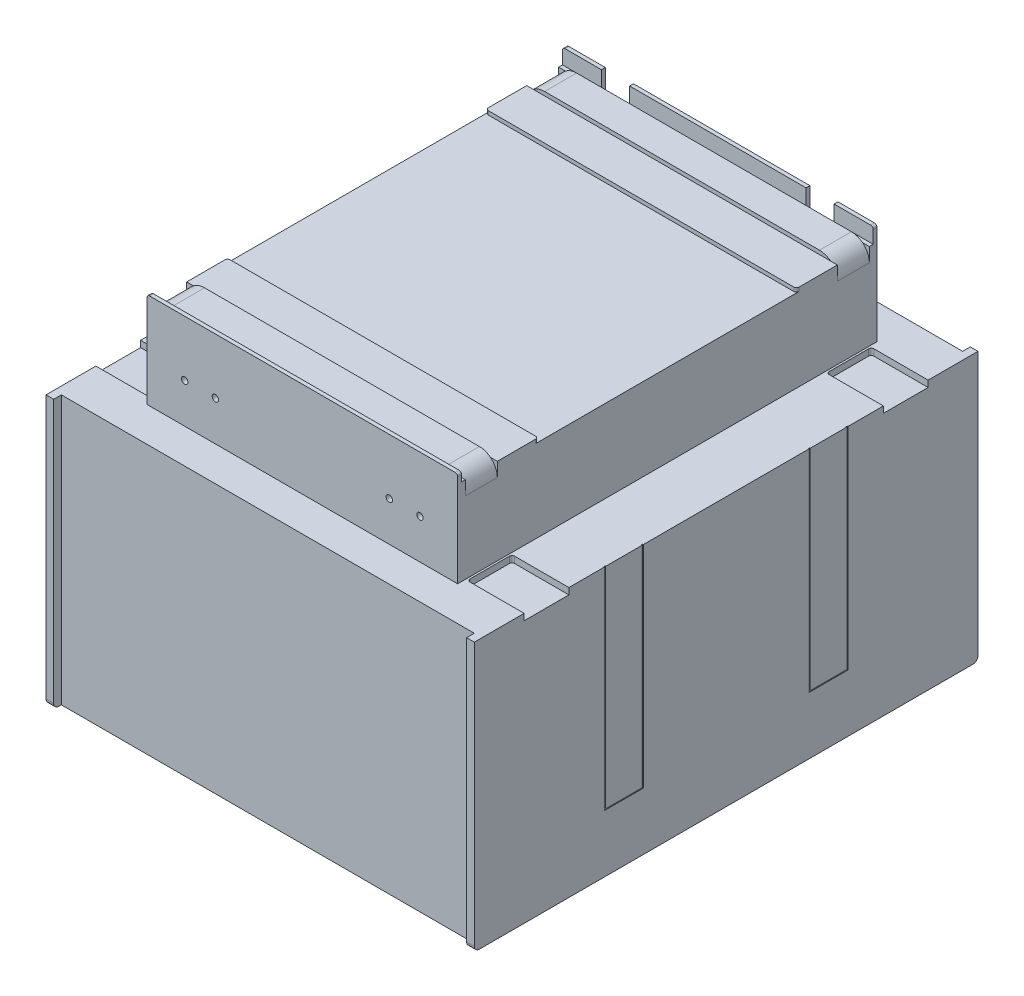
ISO-10303-21;
HEADER;
FILE_DESCRIPTION(('STEP AP214'),'2;1');
FILE_NAME('part.step','',(''),(''),'','','');
FILE_SCHEMA(('AUTOMOTIVE_DESIGN { 1 0 10303 214 1 1 1 1 }'));
ENDSEC;
DATA;
#1=APPLICATION_CONTEXT('core data for automotive mechanical design processes');
#2=APPLICATION_PROTOCOL_DEFINITION('international standard','automotive_design',2000,#1);
#3=PRODUCT_CONTEXT('',#1,'mechanical');
#4=PRODUCT('Part','Part','',(#3));
#5=PRODUCT_RELATED_PRODUCT_CATEGORY('part','',(#4));
#6=PRODUCT_DEFINITION_FORMATION('','',#4);
#7=PRODUCT_DEFINITION_CONTEXT('part definition',#1,'design');
#8=PRODUCT_DEFINITION('design','',#6,#7);
#9=PRODUCT_DEFINITION_SHAPE('','',#8);
#10=(LENGTH_UNIT() NAMED_UNIT(*) SI_UNIT(.MILLI.,.METRE.));
#11=(NAMED_UNIT(*) PLANE_ANGLE_UNIT() SI_UNIT($,.RADIAN.));
#12=(NAMED_UNIT(*) SI_UNIT($,.STERADIAN.) SOLID_ANGLE_UNIT());
#13=UNCERTAINTY_MEASURE_WITH_UNIT(LENGTH_MEASURE(1.E-05),#10,'distance_accuracy_value','');
#14=(GEOMETRIC_REPRESENTATION_CONTEXT(3) GLOBAL_UNCERTAINTY_ASSIGNED_CONTEXT((#13)) GLOBAL_UNIT_ASSIGNED_CONTEXT((#10,
#11,#12)) REPRESENTATION_CONTEXT('',''));
#15=CARTESIAN_POINT('',(0.,0.,0.));
#16=DIRECTION('',(0.,0.,1.));
#17=DIRECTION('',(1.,0.,0.));
#18=AXIS2_PLACEMENT_3D('',#15,#16,#17);
#19=CARTESIAN_POINT('',(-27.9999999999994,-126.,-80.0000000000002));
#20=DIRECTION('',(0.,-1.,0.));
#21=DIRECTION('',(0.,0.,1.));
#22=AXIS2_PLACEMENT_3D('',#19,#20,#21);
#23=PLANE('',#22);
#24=DIRECTION('',(0.,0.,1.));
#25=VECTOR('',#24,1.);
#26=CARTESIAN_POINT('',(-27.4999999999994,-126.,-80.5000000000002));
#27=LINE('',#26,#25);
#28=CARTESIAN_POINT('',(-27.4999999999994,-126.,-80.5000000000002));
#29=VERTEX_POINT('',#28);
#30=CARTESIAN_POINT('',(-27.4999999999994,-126.,-79.5000000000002));
#31=VERTEX_POINT('',#30);
#32=EDGE_CURVE('E116',#29,#31,#27,.T.);
#33=ORIENTED_EDGE('',*,*,#32,.T.);
#34=DIRECTION('',(-1.,0.,0.));
#35=VECTOR('',#34,1.);
#36=CARTESIAN_POINT('',(-28.4999999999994,-126.,-79.5000000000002));
#37=LINE('',#36,#35);
#38=CARTESIAN_POINT('',(-28.4999999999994,-126.,-79.5000000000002));
#39=VERTEX_POINT('',#38);
#40=EDGE_CURVE('E119',#31,#39,#37,.T.);
#41=ORIENTED_EDGE('',*,*,#40,.T.);
#42=DIRECTION('',(0.,0.,-1.));
#43=VECTOR('',#42,1.);
#44=CARTESIAN_POINT('',(-28.4999999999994,-126.,-80.5000000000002));
#45=LINE('',#44,#43);
#46=CARTESIAN_POINT('',(-28.4999999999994,-126.,-80.5000000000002));
#47=VERTEX_POINT('',#46);
#48=EDGE_CURVE('E122',#39,#47,#45,.T.);
#49=ORIENTED_EDGE('',*,*,#48,.T.);
#50=DIRECTION('',(1.,0.,0.));
#51=VECTOR('',#50,1.);
#52=CARTESIAN_POINT('',(-28.4999999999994,-126.,-80.5000000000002));
#53=LINE('',#52,#51);
#54=EDGE_CURVE('E105',#47,#29,#53,.T.);
#55=ORIENTED_EDGE('',*,*,#54,.T.);
#56=EDGE_LOOP('',(#33,#41,#49,#55));
#57=FACE_BOUND('',#56,.T.);
#58=CARTESIAN_POINT('',(-27.9999999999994,-126.,-80.0000000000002));
#59=DIRECTION('',(0.,1.,0.));
#60=DIRECTION('',(0.,0.,-1.));
#61=AXIS2_PLACEMENT_3D('',#58,#59,#60);
#62=CIRCLE('',#61,25.);
#63=CARTESIAN_POINT('',(-27.9999999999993,-126.,-105.));
#64=VERTEX_POINT('',#63);
#65=EDGE_CURVE('E101',#64,#64,#62,.F.);
#66=ORIENTED_EDGE('',*,*,#65,.F.);
#67=EDGE_LOOP('',(#66));
#68=FACE_BOUND('',#67,.T.);
#69=ADVANCED_FACE('F47',(#57,#68),#23,.F.);
#70=CARTESIAN_POINT('',(-27.9999999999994,-664.779220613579,-80.0000000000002));
#71=DIRECTION('',(0.,1.,0.));
#72=DIRECTION('',(0.,0.,-1.));
#73=AXIS2_PLACEMENT_3D('',#70,#71,#72);
#74=CYLINDRICAL_SURFACE('',#73,45.);
#75=CARTESIAN_POINT('',(-27.9999999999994,-187.5,-80.0000000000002));
#76=DIRECTION('',(0.,-1.,0.));
#77=DIRECTION('',(0.,0.,1.));
#78=AXIS2_PLACEMENT_3D('',#75,#76,#77);
#79=CIRCLE('',#78,45.);
#80=CARTESIAN_POINT('',(-27.9999999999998,-187.5,-35.0000000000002));
#81=VERTEX_POINT('',#80);
#82=EDGE_CURVE('E130',#81,#81,#79,.T.);
#83=ORIENTED_EDGE('',*,*,#82,.T.);
#84=EDGE_LOOP('',(#83));
#85=FACE_BOUND('',#84,.T.);
#86=CARTESIAN_POINT('',(-27.9999999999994,-197.5,-80.0000000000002));
#87=DIRECTION('',(0.,-1.,0.));
#88=DIRECTION('',(0.,0.,1.));
#89=AXIS2_PLACEMENT_3D('',#86,#87,#88);
#90=CIRCLE('',#89,45.);
#91=CARTESIAN_POINT('',(-27.9999999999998,-197.5,-35.0000000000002));
#92=VERTEX_POINT('',#91);
#93=EDGE_CURVE('E13',#92,#92,#90,.T.);
#94=ORIENTED_EDGE('',*,*,#93,.F.);
#95=EDGE_LOOP('',(#94));
#96=FACE_BOUND('',#95,.T.);
#97=ADVANCED_FACE('F49',(#85,#96),#74,.T.);
#98=CARTESIAN_POINT('',(-28.4999999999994,-664.779220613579,-80.5000000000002));
#99=DIRECTION('',(0.,0.,1.));
#100=DIRECTION('',(1.,0.,0.));
#101=AXIS2_PLACEMENT_3D('',#98,#99,#100);
#102=PLANE('',#101);
#103=DIRECTION('',(0.,1.,0.));
#104=VECTOR('',#103,1.);
#105=CARTESIAN_POINT('',(-28.4999999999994,-664.779220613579,-80.5000000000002));
#106=LINE('',#105,#104);
#107=CARTESIAN_POINT('',(-28.4999999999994,-197.5,-80.5000000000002));
#108=VERTEX_POINT('',#107);
#109=EDGE_CURVE('E97',#108,#47,#106,.T.);
#110=ORIENTED_EDGE('',*,*,#109,.F.);
#111=DIRECTION('',(1.,0.,0.));
#112=VECTOR('',#111,1.);
#113=CARTESIAN_POINT('',(-28.4999999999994,-197.5,-80.5000000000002));
#114=LINE('',#113,#112);
#115=CARTESIAN_POINT('',(-27.4999999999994,-197.5,-80.5000000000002));
#116=VERTEX_POINT('',#115);
#117=EDGE_CURVE('E51',#108,#116,#114,.T.);
#118=ORIENTED_EDGE('',*,*,#117,.T.);
#119=DIRECTION('',(0.,1.,0.));
#120=VECTOR('',#119,1.);
#121=CARTESIAN_POINT('',(-27.4999999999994,-664.779220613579,-80.5000000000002));
#122=LINE('',#121,#120);
#123=EDGE_CURVE('E70',#116,#29,#122,.T.);
#124=ORIENTED_EDGE('',*,*,#123,.T.);
#125=ORIENTED_EDGE('',*,*,#54,.F.);
#126=EDGE_LOOP('',(#110,#118,#124,#125));
#127=FACE_BOUND('',#126,.T.);
#128=ADVANCED_FACE('F103',(#127),#102,.T.);
#129=CARTESIAN_POINT('',(-28.4999999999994,-664.779220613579,-80.5000000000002));
#130=DIRECTION('',(1.,0.,0.));
#131=DIRECTION('',(0.,0.,-1.));
#132=AXIS2_PLACEMENT_3D('',#129,#130,#131);
#133=PLANE('',#132);
#134=DIRECTION('',(0.,1.,0.));
#135=VECTOR('',#134,1.);
#136=CARTESIAN_POINT('',(-28.4999999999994,-664.779220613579,-79.5000000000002));
#137=LINE('',#136,#135);
#138=CARTESIAN_POINT('',(-28.4999999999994,-197.5,-79.5000000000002));
#139=VERTEX_POINT('',#138);
#140=EDGE_CURVE('E98',#139,#39,#137,.T.);
#141=ORIENTED_EDGE('',*,*,#140,.F.);
#142=DIRECTION('',(0.,0.,-1.));
#143=VECTOR('',#142,1.);
#144=CARTESIAN_POINT('',(-28.4999999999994,-197.5,-80.5000000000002));
#145=LINE('',#144,#143);
#146=EDGE_CURVE('E90',#139,#108,#145,.T.);
#147=ORIENTED_EDGE('',*,*,#146,.T.);
#148=ORIENTED_EDGE('',*,*,#109,.T.);
#149=ORIENTED_EDGE('',*,*,#48,.F.);
#150=EDGE_LOOP('',(#141,#147,#148,#149));
#151=FACE_BOUND('',#150,.T.);
#152=ADVANCED_FACE('F95',(#151),#133,.T.);
#153=CARTESIAN_POINT('',(-28.4999999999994,-664.779220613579,-79.5000000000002));
#154=DIRECTION('',(0.,0.,-1.));
#155=DIRECTION('',(-1.,0.,0.));
#156=AXIS2_PLACEMENT_3D('',#153,#154,#155);
#157=PLANE('',#156);
#158=DIRECTION('',(0.,1.,0.));
#159=VECTOR('',#158,1.);
#160=CARTESIAN_POINT('',(-27.4999999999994,-664.779220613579,-79.5000000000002));
#161=LINE('',#160,#159);
#162=CARTESIAN_POINT('',(-27.4999999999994,-197.5,-79.5000000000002));
#163=VERTEX_POINT('',#162);
#164=EDGE_CURVE('E93',#163,#31,#161,.T.);
#165=ORIENTED_EDGE('',*,*,#164,.F.);
#166=DIRECTION('',(-1.,0.,0.));
#167=VECTOR('',#166,1.);
#168=CARTESIAN_POINT('',(-28.4999999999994,-197.5,-79.5000000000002));
#169=LINE('',#168,#167);
#170=EDGE_CURVE('E100',#163,#139,#169,.T.);
#171=ORIENTED_EDGE('',*,*,#170,.T.);
#172=ORIENTED_EDGE('',*,*,#140,.T.);
#173=ORIENTED_EDGE('',*,*,#40,.F.);
#174=EDGE_LOOP('',(#165,#171,#172,#173));
#175=FACE_BOUND('',#174,.T.);
#176=ADVANCED_FACE('F120',(#175),#157,.T.);
#177=CARTESIAN_POINT('',(-27.4999999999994,-664.779220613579,-80.5000000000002));
#178=DIRECTION('',(-1.,0.,0.));
#179=DIRECTION('',(0.,0.,1.));
#180=AXIS2_PLACEMENT_3D('',#177,#178,#179);
#181=PLANE('',#180);
#182=ORIENTED_EDGE('',*,*,#123,.F.);
#183=DIRECTION('',(0.,0.,1.));
#184=VECTOR('',#183,1.);
#185=CARTESIAN_POINT('',(-27.4999999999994,-197.5,-80.5000000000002));
#186=LINE('',#185,#184);
#187=EDGE_CURVE('E63',#116,#163,#186,.T.);
#188=ORIENTED_EDGE('',*,*,#187,.T.);
#189=ORIENTED_EDGE('',*,*,#164,.T.);
#190=ORIENTED_EDGE('',*,*,#32,.F.);
#191=EDGE_LOOP('',(#182,#188,#189,#190));
#192=FACE_BOUND('',#191,.T.);
#193=ADVANCED_FACE('F114',(#192),#181,.T.);
#194=CARTESIAN_POINT('',(-403.628426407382,-197.5,-101.000000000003));
#195=DIRECTION('',(0.,-1.,0.));
#196=DIRECTION('',(0.,0.,1.));
#197=AXIS2_PLACEMENT_3D('',#194,#195,#196);
#198=PLANE('',#197);
#199=ORIENTED_EDGE('',*,*,#187,.F.);
#200=ORIENTED_EDGE('',*,*,#117,.F.);
#201=ORIENTED_EDGE('',*,*,#146,.F.);
#202=ORIENTED_EDGE('',*,*,#170,.F.);
#203=EDGE_LOOP('',(#199,#200,#201,#202));
#204=FACE_BOUND('',#203,.T.);
#205=ORIENTED_EDGE('',*,*,#93,.T.);
#206=EDGE_LOOP('',(#205));
#207=FACE_BOUND('',#206,.T.);
#208=ADVANCED_FACE('F88',(#204,#207),#198,.T.);
#209=CARTESIAN_POINT('',(-27.9999999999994,1.2792206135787,-80.0000000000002));
#210=DIRECTION('',(0.,-1.,0.));
#211=DIRECTION('',(0.,0.,1.));
#212=AXIS2_PLACEMENT_3D('',#209,#210,#211);
#213=CYLINDRICAL_SURFACE('',#212,25.);
#214=CARTESIAN_POINT('',(-27.9999999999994,-187.5,-80.0000000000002));
#215=DIRECTION('',(0.,-1.,0.));
#216=DIRECTION('',(0.,0.,1.));
#217=AXIS2_PLACEMENT_3D('',#214,#215,#216);
#218=CIRCLE('',#217,25.);
#219=CARTESIAN_POINT('',(-27.9999999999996,-187.5,-55.0000000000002));
#220=VERTEX_POINT('',#219);
#221=EDGE_CURVE('E133',#220,#220,#218,.T.);
#222=ORIENTED_EDGE('',*,*,#221,.F.);
#223=EDGE_LOOP('',(#222));
#224=FACE_BOUND('',#223,.T.);
#225=ORIENTED_EDGE('',*,*,#65,.T.);
#226=EDGE_LOOP('',(#225));
#227=FACE_BOUND('',#226,.T.);
#228=ADVANCED_FACE('F139',(#224,#227),#213,.T.);
#229=CARTESIAN_POINT('',(-56.,-187.5,-3.91045909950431E-13));
#230=DIRECTION('',(0.,-1.,0.));
#231=DIRECTION('',(0.,0.,1.));
#232=AXIS2_PLACEMENT_3D('',#229,#230,#231);
#233=PLANE('',#232);
#234=ORIENTED_EDGE('',*,*,#221,.T.);
#235=EDGE_LOOP('',(#234));
#236=FACE_BOUND('',#235,.T.);
#237=ORIENTED_EDGE('',*,*,#82,.F.);
#238=EDGE_LOOP('',(#237));
#239=FACE_BOUND('',#238,.T.);
#240=ADVANCED_FACE('F158',(#236,#239),#233,.F.);
#241=CLOSED_SHELL('',(#69,#97,#128,#152,#176,#193,#208,#228,#240));
#242=MANIFOLD_SOLID_BREP('B2',#241);
#243=CARTESIAN_POINT('',(0.,10.,0.));
#244=DIRECTION('',(0.,-1.,0.));
#245=DIRECTION('',(0.,0.,-1.));
#246=AXIS2_PLACEMENT_3D('',#243,#244,#245);
#247=CYLINDRICAL_SURFACE('',#246,80.5);
#248=CARTESIAN_POINT('',(0.,10.,0.));
#249=DIRECTION('',(0.,1.,0.));
#250=DIRECTION('',(0.,0.,1.));
#251=AXIS2_PLACEMENT_3D('',#248,#249,#250);
#252=CIRCLE('',#251,80.5);
#253=CARTESIAN_POINT('',(0.,10.,80.5));
#254=VERTEX_POINT('',#253);
#255=EDGE_CURVE('E46',#254,#254,#252,.T.);
#256=ORIENTED_EDGE('',*,*,#255,.F.);
#257=EDGE_LOOP('',(#256));
#258=FACE_BOUND('',#257,.T.);
#259=CARTESIAN_POINT('',(0.,0.,0.));
#260=DIRECTION('',(0.,1.,0.));
#261=DIRECTION('',(0.,0.,1.));
#262=AXIS2_PLACEMENT_3D('',#259,#260,#261);
#263=CIRCLE('',#262,80.5);
#264=CARTESIAN_POINT('',(0.,0.,80.5));
#265=VERTEX_POINT('',#264);
#266=EDGE_CURVE('E233',#265,#265,#263,.T.);
#267=ORIENTED_EDGE('',*,*,#266,.T.);
#268=EDGE_LOOP('',(#267));
#269=FACE_BOUND('',#268,.T.);
#270=ADVANCED_FACE('F230',(#258,#269),#247,.T.);
#271=CARTESIAN_POINT('',(0.,10.,0.));
#272=DIRECTION('',(0.,1.,0.));
#273=DIRECTION('',(0.,0.,1.));
#274=AXIS2_PLACEMENT_3D('',#271,#272,#273);
#275=PLANE('',#274);
#276=ORIENTED_EDGE('',*,*,#255,.T.);
#277=EDGE_LOOP('',(#276));
#278=FACE_BOUND('',#277,.T.);
#279=ADVANCED_FACE('F245',(#278),#275,.T.);
#280=CARTESIAN_POINT('',(0.,0.,0.));
#281=DIRECTION('',(0.,1.,0.));
#282=DIRECTION('',(0.,0.,1.));
#283=AXIS2_PLACEMENT_3D('',#280,#281,#282);
#284=PLANE('',#283);
#285=ORIENTED_EDGE('',*,*,#266,.F.);
#286=EDGE_LOOP('',(#285));
#287=FACE_BOUND('',#286,.T.);
#288=ADVANCED_FACE('F243',(#287),#284,.F.);
#289=CLOSED_SHELL('',(#270,#279,#288));
#290=MANIFOLD_SOLID_BREP('B7_NOT_SHOWN',#289);
#291=CARTESIAN_POINT('',(0.,-2.00000000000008,0.));
#292=DIRECTION('',(0.,-1.,0.));
#293=DIRECTION('',(1.,0.,0.));
#294=AXIS2_PLACEMENT_3D('',#291,#292,#293);
#295=CYLINDRICAL_SURFACE('',#294,130.5);
#296=CARTESIAN_POINT('',(0.,-2.00000000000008,0.));
#297=DIRECTION('',(0.,1.,0.));
#298=DIRECTION('',(-1.,0.,0.));
#299=AXIS2_PLACEMENT_3D('',#296,#297,#298);
#300=CIRCLE('',#299,130.5);
#301=CARTESIAN_POINT('',(-130.5,-2.00000000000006,0.));
#302=VERTEX_POINT('',#301);
#303=EDGE_CURVE('E229',#302,#302,#300,.T.);
#304=ORIENTED_EDGE('',*,*,#303,.F.);
#305=EDGE_LOOP('',(#304));
#306=FACE_BOUND('',#305,.T.);
#307=CARTESIAN_POINT('',(0.,-5.00000000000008,0.));
#308=DIRECTION('',(0.,1.,0.));
#309=DIRECTION('',(-1.,0.,0.));
#310=AXIS2_PLACEMENT_3D('',#307,#308,#309);
#311=CIRCLE('',#310,130.5);
#312=CARTESIAN_POINT('',(-130.5,-5.00000000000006,0.));
#313=VERTEX_POINT('',#312);
#314=EDGE_CURVE('E282',#313,#313,#311,.T.);
#315=ORIENTED_EDGE('',*,*,#314,.T.);
#316=EDGE_LOOP('',(#315));
#317=FACE_BOUND('',#316,.T.);
#318=ADVANCED_FACE('F279',(#306,#317),#295,.T.);
#319=CARTESIAN_POINT('',(0.,-2.00000000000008,0.));
#320=DIRECTION('',(0.,1.,0.));
#321=DIRECTION('',(-1.,0.,0.));
#322=AXIS2_PLACEMENT_3D('',#319,#320,#321);
#323=PLANE('',#322);
#324=ORIENTED_EDGE('',*,*,#303,.T.);
#325=EDGE_LOOP('',(#324));
#326=FACE_BOUND('',#325,.T.);
#327=ADVANCED_FACE('F294',(#326),#323,.T.);
#328=CARTESIAN_POINT('',(0.,-5.00000000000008,0.));
#329=DIRECTION('',(0.,1.,0.));
#330=DIRECTION('',(-1.,0.,0.));
#331=AXIS2_PLACEMENT_3D('',#328,#329,#330);
#332=PLANE('',#331);
#333=ORIENTED_EDGE('',*,*,#314,.F.);
#334=EDGE_LOOP('',(#333));
#335=FACE_BOUND('',#334,.T.);
#336=ADVANCED_FACE('F292',(#335),#332,.F.);
#337=CLOSED_SHELL('',(#318,#327,#336));
#338=MANIFOLD_SOLID_BREP('B41_NOT_SHOWN',#337);
#339=CARTESIAN_POINT('',(0.,10.,0.));
#340=DIRECTION('',(0.,-1.,0.));
#341=DIRECTION('',(0.,0.,-1.));
#342=AXIS2_PLACEMENT_3D('',#339,#340,#341);
#343=CYLINDRICAL_SURFACE('',#342,82.);
#344=CARTESIAN_POINT('',(0.,10.,0.));
#345=DIRECTION('',(0.,1.,0.));
#346=DIRECTION('',(0.,0.,1.));
#347=AXIS2_PLACEMENT_3D('',#344,#345,#346);
#348=CIRCLE('',#347,82.);
#349=CARTESIAN_POINT('',(0.,10.,82.));
#350=VERTEX_POINT('',#349);
#351=EDGE_CURVE('E278',#350,#350,#348,.T.);
#352=ORIENTED_EDGE('',*,*,#351,.F.);
#353=EDGE_LOOP('',(#352));
#354=FACE_BOUND('',#353,.T.);
#355=CARTESIAN_POINT('',(0.,0.,0.));
#356=DIRECTION('',(0.,1.,0.));
#357=DIRECTION('',(0.,0.,1.));
#358=AXIS2_PLACEMENT_3D('',#355,#356,#357);
#359=CIRCLE('',#358,82.);
#360=CARTESIAN_POINT('',(0.,0.,82.));
#361=VERTEX_POINT('',#360);
#362=EDGE_CURVE('E333',#361,#361,#359,.T.);
#363=ORIENTED_EDGE('',*,*,#362,.T.);
#364=EDGE_LOOP('',(#363));
#365=FACE_BOUND('',#364,.T.);
#366=ADVANCED_FACE('F330',(#354,#365),#343,.T.);
#367=CARTESIAN_POINT('',(0.,10.,0.));
#368=DIRECTION('',(0.,1.,0.));
#369=DIRECTION('',(0.,0.,1.));
#370=AXIS2_PLACEMENT_3D('',#367,#368,#369);
#371=PLANE('',#370);
#372=ORIENTED_EDGE('',*,*,#351,.T.);
#373=EDGE_LOOP('',(#372));
#374=FACE_BOUND('',#373,.T.);
#375=ADVANCED_FACE('F345',(#374),#371,.T.);
#376=CARTESIAN_POINT('',(0.,0.,0.));
#377=DIRECTION('',(0.,1.,0.));
#378=DIRECTION('',(0.,0.,1.));
#379=AXIS2_PLACEMENT_3D('',#376,#377,#378);
#380=PLANE('',#379);
#381=ORIENTED_EDGE('',*,*,#362,.F.);
#382=EDGE_LOOP('',(#381));
#383=FACE_BOUND('',#382,.T.);
#384=ADVANCED_FACE('F343',(#383),#380,.F.);
#385=CLOSED_SHELL('',(#366,#375,#384));
#386=MANIFOLD_SOLID_BREP('B224_NOT_SHOWN',#385);
#387=CARTESIAN_POINT('',(347.628426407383,0.,-164.));
#388=DIRECTION('',(0.,0.,-1.));
#389=DIRECTION('',(0.,1.,0.));
#390=AXIS2_PLACEMENT_3D('',#387,#388,#389);
#391=PLANE('',#390);
#392=CARTESIAN_POINT('',(92.,31.,-164.));
#393=DIRECTION('',(0.,0.,-1.));
#394=DIRECTION('',(0.,1.,0.));
#395=AXIS2_PLACEMENT_3D('',#392,#393,#394);
#396=CIRCLE('',#395,2.5);
#397=CARTESIAN_POINT('',(92.,33.5,-164.));
#398=VERTEX_POINT('',#397);
#399=EDGE_CURVE('E376',#398,#398,#396,.F.);
#400=ORIENTED_EDGE('',*,*,#399,.T.);
#401=EDGE_LOOP('',(#400));
#402=FACE_BOUND('',#401,.T.);
#403=CARTESIAN_POINT('',(68.,31.,-164.));
#404=DIRECTION('',(0.,0.,-1.));
#405=DIRECTION('',(0.,1.,0.));
#406=AXIS2_PLACEMENT_3D('',#403,#404,#405);
#407=CIRCLE('',#406,2.5);
#408=CARTESIAN_POINT('',(68.,33.5,-164.));
#409=VERTEX_POINT('',#408);
#410=EDGE_CURVE('E1201',#409,#409,#407,.F.);
#411=ORIENTED_EDGE('',*,*,#410,.T.);
#412=EDGE_LOOP('',(#411));
#413=FACE_BOUND('',#412,.T.);
#414=CARTESIAN_POINT('',(-92.,31.,-164.));
#415=DIRECTION('',(0.,0.,-1.));
#416=DIRECTION('',(0.,1.,0.));
#417=AXIS2_PLACEMENT_3D('',#414,#415,#416);
#418=CIRCLE('',#417,2.5);
#419=CARTESIAN_POINT('',(-92.,33.5,-164.));
#420=VERTEX_POINT('',#419);
#421=EDGE_CURVE('E1466',#420,#420,#418,.T.);
#422=ORIENTED_EDGE('',*,*,#421,.F.);
#423=EDGE_LOOP('',(#422));
#424=FACE_BOUND('',#423,.T.);
#425=CARTESIAN_POINT('',(-68.,31.,-164.));
#426=DIRECTION('',(0.,0.,-1.));
#427=DIRECTION('',(0.,1.,0.));
#428=AXIS2_PLACEMENT_3D('',#425,#426,#427);
#429=CIRCLE('',#428,2.5);
#430=CARTESIAN_POINT('',(-68.,33.5,-164.));
#431=VERTEX_POINT('',#430);
#432=EDGE_CURVE('E1470',#431,#431,#429,.T.);
#433=ORIENTED_EDGE('',*,*,#432,.F.);
#434=EDGE_LOOP('',(#433));
#435=FACE_BOUND('',#434,.T.);
#436=DIRECTION('',(-1.,0.,0.));
#437=VECTOR('',#436,1.);
#438=CARTESIAN_POINT('',(347.628426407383,79.5,-164.));
#439=LINE('',#438,#437);
#440=CARTESIAN_POINT('',(-91.,79.5,-164.));
#441=VERTEX_POINT('',#440);
#442=CARTESIAN_POINT('',(-119.5,79.5,-164.));
#443=VERTEX_POINT('',#442);
#444=EDGE_CURVE('E2060',#441,#443,#439,.T.);
#445=ORIENTED_EDGE('',*,*,#444,.F.);
#446=DIRECTION('',(0.,-1.,0.));
#447=VECTOR('',#446,1.);
#448=CARTESIAN_POINT('',(-91.,79.5,-164.));
#449=LINE('',#448,#447);
#450=CARTESIAN_POINT('',(-91.,64.,-164.));
#451=VERTEX_POINT('',#450);
#452=EDGE_CURVE('E1188',#441,#451,#449,.T.);
#453=ORIENTED_EDGE('',*,*,#452,.T.);
#454=DIRECTION('',(0.707106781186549,-0.707106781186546,0.));
#455=VECTOR('',#454,1.);
#456=CARTESIAN_POINT('',(-91.,64.,-164.));
#457=LINE('',#456,#455);
#458=CARTESIAN_POINT('',(-86.5,59.5,-164.));
#459=VERTEX_POINT('',#458);
#460=EDGE_CURVE('E1192',#451,#459,#457,.T.);
#461=ORIENTED_EDGE('',*,*,#460,.T.);
#462=DIRECTION('',(1.,0.,0.));
#463=VECTOR('',#462,1.);
#464=CARTESIAN_POINT('',(-86.5,59.5,-164.));
#465=LINE('',#464,#463);
#466=CARTESIAN_POINT('',(-73.5000000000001,59.5,-164.));
#467=VERTEX_POINT('',#466);
#468=EDGE_CURVE('E1195',#459,#467,#465,.T.);
#469=ORIENTED_EDGE('',*,*,#468,.T.);
#470=DIRECTION('',(0.707106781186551,0.707106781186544,0.));
#471=VECTOR('',#470,1.);
#472=CARTESIAN_POINT('',(-73.5000000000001,59.5,-164.));
#473=LINE('',#472,#471);
#474=CARTESIAN_POINT('',(-69.,64.,-164.));
#475=VERTEX_POINT('',#474);
#476=EDGE_CURVE('E1158',#467,#475,#473,.T.);
#477=ORIENTED_EDGE('',*,*,#476,.T.);
#478=DIRECTION('',(0.,1.,0.));
#479=VECTOR('',#478,1.);
#480=CARTESIAN_POINT('',(-69.,64.,-164.));
#481=LINE('',#480,#479);
#482=CARTESIAN_POINT('',(-69.,79.5,-164.));
#483=VERTEX_POINT('',#482);
#484=EDGE_CURVE('E1153',#475,#483,#481,.T.);
#485=ORIENTED_EDGE('',*,*,#484,.T.);
#486=CARTESIAN_POINT('',(69.,79.5,-164.));
#487=VERTEX_POINT('',#486);
#488=EDGE_CURVE('E2059',#487,#483,#439,.T.);
#489=ORIENTED_EDGE('',*,*,#488,.F.);
#490=DIRECTION('',(0.,1.,0.));
#491=VECTOR('',#490,1.);
#492=CARTESIAN_POINT('',(69.,64.,-164.));
#493=LINE('',#492,#491);
#494=CARTESIAN_POINT('',(69.,64.,-164.));
#495=VERTEX_POINT('',#494);
#496=EDGE_CURVE('E1202',#495,#487,#493,.T.);
#497=ORIENTED_EDGE('',*,*,#496,.F.);
#498=DIRECTION('',(-0.707106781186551,0.707106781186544,0.));
#499=VECTOR('',#498,1.);
#500=CARTESIAN_POINT('',(73.5000000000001,59.5,-164.));
#501=LINE('',#500,#499);
#502=CARTESIAN_POINT('',(73.5000000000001,59.5,-164.));
#503=VERTEX_POINT('',#502);
#504=EDGE_CURVE('E1205',#503,#495,#501,.T.);
#505=ORIENTED_EDGE('',*,*,#504,.F.);
#506=DIRECTION('',(-1.,0.,0.));
#507=VECTOR('',#506,1.);
#508=CARTESIAN_POINT('',(86.5,59.5,-164.));
#509=LINE('',#508,#507);
#510=CARTESIAN_POINT('',(86.5,59.5,-164.));
#511=VERTEX_POINT('',#510);
#512=EDGE_CURVE('E1208',#511,#503,#509,.T.);
#513=ORIENTED_EDGE('',*,*,#512,.F.);
#514=DIRECTION('',(-0.707106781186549,-0.707106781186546,0.));
#515=VECTOR('',#514,1.);
#516=CARTESIAN_POINT('',(91.,64.,-164.));
#517=LINE('',#516,#515);
#518=CARTESIAN_POINT('',(91.,64.,-164.));
#519=VERTEX_POINT('',#518);
#520=EDGE_CURVE('E1211',#519,#511,#517,.T.);
#521=ORIENTED_EDGE('',*,*,#520,.F.);
#522=DIRECTION('',(0.,-1.,0.));
#523=VECTOR('',#522,1.);
#524=CARTESIAN_POINT('',(91.,79.5,-164.));
#525=LINE('',#524,#523);
#526=CARTESIAN_POINT('',(91.,79.5,-164.));
#527=VERTEX_POINT('',#526);
#528=EDGE_CURVE('E1214',#527,#519,#525,.T.);
#529=ORIENTED_EDGE('',*,*,#528,.F.);
#530=CARTESIAN_POINT('',(119.5,79.5,-164.));
#531=VERTEX_POINT('',#530);
#532=EDGE_CURVE('E1685',#531,#527,#439,.T.);
#533=ORIENTED_EDGE('',*,*,#532,.F.);
#534=CARTESIAN_POINT('',(119.5,77.5,-164.));
#535=DIRECTION('',(0.,0.,-1.));
#536=DIRECTION('',(0.,1.,0.));
#537=AXIS2_PLACEMENT_3D('',#534,#535,#536);
#538=CIRCLE('',#537,2.);
#539=CARTESIAN_POINT('',(121.5,77.5,-164.));
#540=VERTEX_POINT('',#539);
#541=EDGE_CURVE('E2056',#531,#540,#538,.T.);
#542=ORIENTED_EDGE('',*,*,#541,.T.);
#543=DIRECTION('',(0.,1.,0.));
#544=VECTOR('',#543,1.);
#545=CARTESIAN_POINT('',(121.5,0.,-164.));
#546=LINE('',#545,#544);
#547=CARTESIAN_POINT('',(121.5,0.,-164.));
#548=VERTEX_POINT('',#547);
#549=EDGE_CURVE('E1654',#548,#540,#546,.T.);
#550=ORIENTED_EDGE('',*,*,#549,.F.);
#551=DIRECTION('',(-1.,0.,0.));
#552=VECTOR('',#551,1.);
#553=CARTESIAN_POINT('',(347.628426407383,0.,-164.));
#554=LINE('',#553,#552);
#555=CARTESIAN_POINT('',(-121.5,0.,-164.));
#556=VERTEX_POINT('',#555);
#557=EDGE_CURVE('E1649',#548,#556,#554,.T.);
#558=ORIENTED_EDGE('',*,*,#557,.T.);
#559=DIRECTION('',(0.,1.,0.));
#560=VECTOR('',#559,1.);
#561=CARTESIAN_POINT('',(-121.5,0.,-164.));
#562=LINE('',#561,#560);
#563=CARTESIAN_POINT('',(-121.5,77.5,-164.));
#564=VERTEX_POINT('',#563);
#565=EDGE_CURVE('E1631',#556,#564,#562,.T.);
#566=ORIENTED_EDGE('',*,*,#565,.T.);
#567=CARTESIAN_POINT('',(-119.5,77.5,-164.));
#568=DIRECTION('',(0.,0.,-1.));
#569=DIRECTION('',(0.,1.,0.));
#570=AXIS2_PLACEMENT_3D('',#567,#568,#569);
#571=CIRCLE('',#570,2.);
#572=EDGE_CURVE('E1910',#564,#443,#571,.T.);
#573=ORIENTED_EDGE('',*,*,#572,.T.);
#574=EDGE_LOOP('',(#445,#453,#461,#469,#477,#485,#489,#497,#505,#513,#521,#529,#533,#542,#550,
#558,#566,#573));
#575=FACE_BOUND('',#574,.T.);
#576=ADVANCED_FACE('F372',(#402,#413,#424,#435,#575),#391,.T.);
#577=CARTESIAN_POINT('',(347.628426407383,79.5,-164.));
#578=DIRECTION('',(0.,1.,0.));
#579=DIRECTION('',(0.,0.,1.));
#580=AXIS2_PLACEMENT_3D('',#577,#578,#579);
#581=PLANE('',#580);
#582=DIRECTION('',(-1.,0.,0.));
#583=VECTOR('',#582,1.);
#584=CARTESIAN_POINT('',(347.628426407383,79.5,-161.));
#585=LINE('',#584,#583);
#586=CARTESIAN_POINT('',(-91.,79.5,-161.));
#587=VERTEX_POINT('',#586);
#588=CARTESIAN_POINT('',(-119.5,79.5,-161.));
#589=VERTEX_POINT('',#588);
#590=EDGE_CURVE('E1681',#587,#589,#585,.T.);
#591=ORIENTED_EDGE('',*,*,#590,.F.);
#592=DIRECTION('',(0.,0.,-1.));
#593=VECTOR('',#592,1.);
#594=CARTESIAN_POINT('',(-91.,79.5,-131.267862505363));
#595=LINE('',#594,#593);
#596=EDGE_CURVE('E1185',#587,#441,#595,.T.);
#597=ORIENTED_EDGE('',*,*,#596,.T.);
#598=ORIENTED_EDGE('',*,*,#444,.T.);
#599=DIRECTION('',(0.,0.,1.));
#600=VECTOR('',#599,1.);
#601=CARTESIAN_POINT('',(-119.5,79.5,-161.));
#602=LINE('',#601,#600);
#603=EDGE_CURVE('E2049',#443,#589,#602,.T.);
#604=ORIENTED_EDGE('',*,*,#603,.T.);
#605=EDGE_LOOP('',(#591,#597,#598,#604));
#606=FACE_BOUND('',#605,.T.);
#607=ADVANCED_FACE('F2230',(#606),#581,.T.);
#608=ORIENTED_EDGE('',*,*,#488,.T.);
#609=DIRECTION('',(0.,0.,-1.));
#610=VECTOR('',#609,1.);
#611=CARTESIAN_POINT('',(-69.,79.5,-131.267862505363));
#612=LINE('',#611,#610);
#613=CARTESIAN_POINT('',(-69.,79.5,-161.));
#614=VERTEX_POINT('',#613);
#615=EDGE_CURVE('E1189',#614,#483,#612,.T.);
#616=ORIENTED_EDGE('',*,*,#615,.F.);
#617=CARTESIAN_POINT('',(69.,79.5,-161.));
#618=VERTEX_POINT('',#617);
#619=EDGE_CURVE('E2069',#618,#614,#585,.T.);
#620=ORIENTED_EDGE('',*,*,#619,.F.);
#621=DIRECTION('',(0.,0.,-1.));
#622=VECTOR('',#621,1.);
#623=CARTESIAN_POINT('',(69.,79.5,-131.267862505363));
#624=LINE('',#623,#622);
#625=EDGE_CURVE('E1222',#618,#487,#624,.T.);
#626=ORIENTED_EDGE('',*,*,#625,.T.);
#627=EDGE_LOOP('',(#608,#616,#620,#626));
#628=FACE_BOUND('',#627,.T.);
#629=ADVANCED_FACE('F2236',(#628),#581,.T.);
#630=CARTESIAN_POINT('',(347.628426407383,74.5,-161.));
#631=DIRECTION('',(0.,0.,1.));
#632=DIRECTION('',(0.,-1.,0.));
#633=AXIS2_PLACEMENT_3D('',#630,#631,#632);
#634=PLANE('',#633);
#635=DIRECTION('',(-1.,0.,0.));
#636=VECTOR('',#635,1.);
#637=CARTESIAN_POINT('',(347.628426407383,67.5000000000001,-161.));
#638=LINE('',#637,#636);
#639=CARTESIAN_POINT('',(-91.,67.5000000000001,-161.));
#640=VERTEX_POINT('',#639);
#641=CARTESIAN_POINT('',(-121.5,67.5000000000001,-161.));
#642=VERTEX_POINT('',#641);
#643=EDGE_CURVE('E1677',#640,#642,#638,.T.);
#644=ORIENTED_EDGE('',*,*,#643,.F.);
#645=DIRECTION('',(0.,-1.,0.));
#646=VECTOR('',#645,1.);
#647=CARTESIAN_POINT('',(-91.,79.5,-161.));
#648=LINE('',#647,#646);
#649=EDGE_CURVE('E389',#587,#640,#648,.T.);
#650=ORIENTED_EDGE('',*,*,#649,.F.);
#651=ORIENTED_EDGE('',*,*,#590,.T.);
#652=CARTESIAN_POINT('',(-119.5,77.5,-161.));
#653=DIRECTION('',(0.,0.,1.));
#654=DIRECTION('',(0.,-1.,0.));
#655=AXIS2_PLACEMENT_3D('',#652,#653,#654);
#656=CIRCLE('',#655,2.);
#657=CARTESIAN_POINT('',(-121.5,77.5,-161.));
#658=VERTEX_POINT('',#657);
#659=EDGE_CURVE('E2062',#589,#658,#656,.T.);
#660=ORIENTED_EDGE('',*,*,#659,.T.);
#661=DIRECTION('',(0.,-1.,0.));
#662=VECTOR('',#661,1.);
#663=CARTESIAN_POINT('',(-121.5,74.5,-161.));
#664=LINE('',#663,#662);
#665=EDGE_CURVE('E1633',#658,#642,#664,.T.);
#666=ORIENTED_EDGE('',*,*,#665,.T.);
#667=EDGE_LOOP('',(#644,#650,#651,#660,#666));
#668=FACE_BOUND('',#667,.T.);
#669=ADVANCED_FACE('F2203',(#668),#634,.T.);
#670=ORIENTED_EDGE('',*,*,#619,.T.);
#671=DIRECTION('',(0.,1.,0.));
#672=VECTOR('',#671,1.);
#673=CARTESIAN_POINT('',(-69.,64.,-161.));
#674=LINE('',#673,#672);
#675=CARTESIAN_POINT('',(-69.,67.5000000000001,-161.));
#676=VERTEX_POINT('',#675);
#677=EDGE_CURVE('E1167',#676,#614,#674,.T.);
#678=ORIENTED_EDGE('',*,*,#677,.F.);
#679=CARTESIAN_POINT('',(68.9999999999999,67.5000000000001,-161.));
#680=VERTEX_POINT('',#679);
#681=EDGE_CURVE('E3837',#680,#676,#638,.T.);
#682=ORIENTED_EDGE('',*,*,#681,.F.);
#683=DIRECTION('',(0.,1.,0.));
#684=VECTOR('',#683,1.);
#685=CARTESIAN_POINT('',(69.,64.,-161.));
#686=LINE('',#685,#684);
#687=EDGE_CURVE('E1223',#680,#618,#686,.T.);
#688=ORIENTED_EDGE('',*,*,#687,.T.);
#689=EDGE_LOOP('',(#670,#678,#682,#688));
#690=FACE_BOUND('',#689,.T.);
#691=ADVANCED_FACE('F2755',(#690),#634,.T.);
#692=DIRECTION('',(0.,0.,-1.));
#693=VECTOR('',#692,1.);
#694=CARTESIAN_POINT('',(91.,79.5,-131.267862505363));
#695=LINE('',#694,#693);
#696=CARTESIAN_POINT('',(91.,79.5,-161.));
#697=VERTEX_POINT('',#696);
#698=EDGE_CURVE('E1237',#697,#527,#695,.T.);
#699=ORIENTED_EDGE('',*,*,#698,.F.);
#700=CARTESIAN_POINT('',(119.5,79.5,-161.));
#701=VERTEX_POINT('',#700);
#702=EDGE_CURVE('E2066',#701,#697,#585,.T.);
#703=ORIENTED_EDGE('',*,*,#702,.F.);
#704=DIRECTION('',(0.,0.,1.));
#705=VECTOR('',#704,1.);
#706=CARTESIAN_POINT('',(119.5,79.5,-164.));
#707=LINE('',#706,#705);
#708=EDGE_CURVE('E1905',#701,#531,#707,.F.);
#709=ORIENTED_EDGE('',*,*,#708,.T.);
#710=ORIENTED_EDGE('',*,*,#532,.T.);
#711=EDGE_LOOP('',(#699,#703,#709,#710));
#712=FACE_BOUND('',#711,.T.);
#713=ADVANCED_FACE('F2238',(#712),#581,.T.);
#714=DIRECTION('',(0.,-1.,0.));
#715=VECTOR('',#714,1.);
#716=CARTESIAN_POINT('',(91.,79.5,-161.));
#717=LINE('',#716,#715);
#718=CARTESIAN_POINT('',(91.,67.5000000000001,-161.));
#719=VERTEX_POINT('',#718);
#720=EDGE_CURVE('E1217',#697,#719,#717,.T.);
#721=ORIENTED_EDGE('',*,*,#720,.T.);
#722=CARTESIAN_POINT('',(121.5,67.5000000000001,-161.));
#723=VERTEX_POINT('',#722);
#724=EDGE_CURVE('E1678',#723,#719,#638,.T.);
#725=ORIENTED_EDGE('',*,*,#724,.F.);
#726=DIRECTION('',(0.,-1.,0.));
#727=VECTOR('',#726,1.);
#728=CARTESIAN_POINT('',(121.5,74.5,-161.));
#729=LINE('',#728,#727);
#730=CARTESIAN_POINT('',(121.5,77.5,-161.));
#731=VERTEX_POINT('',#730);
#732=EDGE_CURVE('E1652',#731,#723,#729,.T.);
#733=ORIENTED_EDGE('',*,*,#732,.F.);
#734=CARTESIAN_POINT('',(119.5,77.5,-161.));
#735=DIRECTION('',(0.,0.,1.));
#736=DIRECTION('',(0.,-1.,0.));
#737=AXIS2_PLACEMENT_3D('',#734,#735,#736);
#738=CIRCLE('',#737,2.);
#739=EDGE_CURVE('E2052',#731,#701,#738,.T.);
#740=ORIENTED_EDGE('',*,*,#739,.T.);
#741=ORIENTED_EDGE('',*,*,#702,.T.);
#742=EDGE_LOOP('',(#721,#725,#733,#740,#741));
#743=FACE_BOUND('',#742,.T.);
#744=ADVANCED_FACE('F2402',(#743),#634,.T.);
#745=CARTESIAN_POINT('',(167.5,0.,197.));
#746=DIRECTION('',(-1.,0.,0.));
#747=DIRECTION('',(0.,-1.,0.));
#748=AXIS2_PLACEMENT_3D('',#745,#746,#747);
#749=PLANE('',#748);
#750=DIRECTION('',(0.,1.,0.));
#751=VECTOR('',#750,1.);
#752=CARTESIAN_POINT('',(167.5,0.,-95.25));
#753=LINE('',#752,#751);
#754=CARTESIAN_POINT('',(167.5,-165.,-95.25));
#755=VERTEX_POINT('',#754);
#756=CARTESIAN_POINT('',(167.5,0.,-95.25));
#757=VERTEX_POINT('',#756);
#758=EDGE_CURVE('E2047',#755,#757,#753,.T.);
#759=ORIENTED_EDGE('',*,*,#758,.F.);
#760=DIRECTION('',(0.,0.,1.));
#761=VECTOR('',#760,1.);
#762=CARTESIAN_POINT('',(167.5,-165.,-95.25));
#763=LINE('',#762,#761);
#764=CARTESIAN_POINT('',(167.5,-165.,-64.75));
#765=VERTEX_POINT('',#764);
#766=EDGE_CURVE('E1272',#755,#765,#763,.T.);
#767=ORIENTED_EDGE('',*,*,#766,.T.);
#768=DIRECTION('',(0.,1.,0.));
#769=VECTOR('',#768,1.);
#770=CARTESIAN_POINT('',(167.5,1.,-64.75));
#771=LINE('',#770,#769);
#772=CARTESIAN_POINT('',(167.5,0.,-64.75));
#773=VERTEX_POINT('',#772);
#774=EDGE_CURVE('E1260',#765,#773,#771,.T.);
#775=ORIENTED_EDGE('',*,*,#774,.T.);
#776=DIRECTION('',(0.,0.,-1.));
#777=VECTOR('',#776,1.);
#778=CARTESIAN_POINT('',(167.5,0.,197.));
#779=LINE('',#778,#777);
#780=CARTESIAN_POINT('',(167.5,0.,64.75));
#781=VERTEX_POINT('',#780);
#782=EDGE_CURVE('E3777',#781,#773,#779,.T.);
#783=ORIENTED_EDGE('',*,*,#782,.F.);
#784=DIRECTION('',(0.,1.,0.));
#785=VECTOR('',#784,1.);
#786=CARTESIAN_POINT('',(167.5,1.,64.75));
#787=LINE('',#786,#785);
#788=CARTESIAN_POINT('',(167.5,-165.,64.75));
#789=VERTEX_POINT('',#788);
#790=EDGE_CURVE('E1411',#789,#781,#787,.T.);
#791=ORIENTED_EDGE('',*,*,#790,.F.);
#792=DIRECTION('',(0.,0.,-1.));
#793=VECTOR('',#792,1.);
#794=CARTESIAN_POINT('',(167.5,-165.,95.25));
#795=LINE('',#794,#793);
#796=CARTESIAN_POINT('',(167.5,-165.,95.25));
#797=VERTEX_POINT('',#796);
#798=EDGE_CURVE('E1401',#797,#789,#795,.T.);
#799=ORIENTED_EDGE('',*,*,#798,.F.);
#800=DIRECTION('',(0.,1.,0.));
#801=VECTOR('',#800,1.);
#802=CARTESIAN_POINT('',(167.5,0.,95.25));
#803=LINE('',#802,#801);
#804=CARTESIAN_POINT('',(167.5,0.,95.25));
#805=VERTEX_POINT('',#804);
#806=EDGE_CURVE('E2024',#797,#805,#803,.T.);
#807=ORIENTED_EDGE('',*,*,#806,.T.);
#808=CARTESIAN_POINT('',(167.5,0.,123.));
#809=VERTEX_POINT('',#808);
#810=EDGE_CURVE('E1840',#809,#805,#779,.T.);
#811=ORIENTED_EDGE('',*,*,#810,.F.);
#812=DIRECTION('',(0.,1.,0.));
#813=VECTOR('',#812,1.);
#814=CARTESIAN_POINT('',(167.5,0.,123.));
#815=LINE('',#814,#813);
#816=CARTESIAN_POINT('',(167.5,-5.00000000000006,123.));
#817=VERTEX_POINT('',#816);
#818=EDGE_CURVE('E1523',#817,#809,#815,.T.);
#819=ORIENTED_EDGE('',*,*,#818,.F.);
#820=DIRECTION('',(0.,0.,-1.));
#821=VECTOR('',#820,1.);
#822=CARTESIAN_POINT('',(167.5,-5.00000000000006,158.));
#823=LINE('',#822,#821);
#824=CARTESIAN_POINT('',(167.5,-5.00000000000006,158.));
#825=VERTEX_POINT('',#824);
#826=EDGE_CURVE('E1529',#825,#817,#823,.T.);
#827=ORIENTED_EDGE('',*,*,#826,.F.);
#828=DIRECTION('',(0.,-1.,0.));
#829=VECTOR('',#828,1.);
#830=CARTESIAN_POINT('',(167.5,0.,158.));
#831=LINE('',#830,#829);
#832=CARTESIAN_POINT('',(167.5,0.,158.));
#833=VERTEX_POINT('',#832);
#834=EDGE_CURVE('E1512',#833,#825,#831,.T.);
#835=ORIENTED_EDGE('',*,*,#834,.F.);
#836=CARTESIAN_POINT('',(167.5,0.,197.));
#837=VERTEX_POINT('',#836);
#838=EDGE_CURVE('E1836',#837,#833,#779,.T.);
#839=ORIENTED_EDGE('',*,*,#838,.F.);
#840=DIRECTION('',(0.,1.,0.));
#841=VECTOR('',#840,1.);
#842=CARTESIAN_POINT('',(167.5,0.,197.));
#843=LINE('',#842,#841);
#844=CARTESIAN_POINT('',(167.5,-206.,197.));
#845=VERTEX_POINT('',#844);
#846=EDGE_CURVE('E1815',#845,#837,#843,.T.);
#847=ORIENTED_EDGE('',*,*,#846,.F.);
#848=CARTESIAN_POINT('',(167.5,-206.,193.));
#849=DIRECTION('',(-1.,0.,0.));
#850=DIRECTION('',(0.,-1.,0.));
#851=AXIS2_PLACEMENT_3D('',#848,#849,#850);
#852=CIRCLE('',#851,4.);
#853=CARTESIAN_POINT('',(167.5,-210.,193.));
#854=VERTEX_POINT('',#853);
#855=EDGE_CURVE('E1934',#845,#854,#852,.F.);
#856=ORIENTED_EDGE('',*,*,#855,.T.);
#857=DIRECTION('',(0.,0.,-1.));
#858=VECTOR('',#857,1.);
#859=CARTESIAN_POINT('',(167.5,-210.,197.));
#860=LINE('',#859,#858);
#861=CARTESIAN_POINT('',(167.5,-210.,-193.));
#862=VERTEX_POINT('',#861);
#863=EDGE_CURVE('E1839',#854,#862,#860,.T.);
#864=ORIENTED_EDGE('',*,*,#863,.T.);
#865=CARTESIAN_POINT('',(167.5,-206.,-193.));
#866=DIRECTION('',(-1.,0.,0.));
#867=DIRECTION('',(0.,-1.,0.));
#868=AXIS2_PLACEMENT_3D('',#865,#866,#867);
#869=CIRCLE('',#868,4.);
#870=CARTESIAN_POINT('',(167.5,-206.,-197.));
#871=VERTEX_POINT('',#870);
#872=EDGE_CURVE('E1936',#862,#871,#869,.F.);
#873=ORIENTED_EDGE('',*,*,#872,.T.);
#874=DIRECTION('',(0.,1.,0.));
#875=VECTOR('',#874,1.);
#876=CARTESIAN_POINT('',(167.5,0.,-197.));
#877=LINE('',#876,#875);
#878=CARTESIAN_POINT('',(167.5,0.,-197.));
#879=VERTEX_POINT('',#878);
#880=EDGE_CURVE('E1825',#871,#879,#877,.T.);
#881=ORIENTED_EDGE('',*,*,#880,.T.);
#882=CARTESIAN_POINT('',(167.5,0.,-158.));
#883=VERTEX_POINT('',#882);
#884=EDGE_CURVE('E1833',#883,#879,#779,.T.);
#885=ORIENTED_EDGE('',*,*,#884,.F.);
#886=DIRECTION('',(0.,1.,0.));
#887=VECTOR('',#886,1.);
#888=CARTESIAN_POINT('',(167.5,0.,-158.));
#889=LINE('',#888,#887);
#890=CARTESIAN_POINT('',(167.5,-5.,-158.));
#891=VERTEX_POINT('',#890);
#892=EDGE_CURVE('E1546',#891,#883,#889,.T.);
#893=ORIENTED_EDGE('',*,*,#892,.F.);
#894=DIRECTION('',(0.,0.,-1.));
#895=VECTOR('',#894,1.);
#896=CARTESIAN_POINT('',(167.5,-5.00000000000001,-123.));
#897=LINE('',#896,#895);
#898=CARTESIAN_POINT('',(167.5,-5.00000000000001,-123.));
#899=VERTEX_POINT('',#898);
#900=EDGE_CURVE('E1552',#899,#891,#897,.T.);
#901=ORIENTED_EDGE('',*,*,#900,.F.);
#902=DIRECTION('',(0.,-1.,0.));
#903=VECTOR('',#902,1.);
#904=CARTESIAN_POINT('',(167.5,0.,-123.));
#905=LINE('',#904,#903);
#906=CARTESIAN_POINT('',(167.5,0.,-123.));
#907=VERTEX_POINT('',#906);
#908=EDGE_CURVE('E1536',#907,#899,#905,.T.);
#909=ORIENTED_EDGE('',*,*,#908,.F.);
#910=EDGE_CURVE('E1841',#757,#907,#779,.T.);
#911=ORIENTED_EDGE('',*,*,#910,.F.);
#912=EDGE_LOOP('',(#759,#767,#775,#783,#791,#799,#807,#811,#819,#827,#835,#839,#847,#856,#864,
#873,#881,#885,#893,#901,#909,#911));
#913=FACE_BOUND('',#912,.T.);
#914=ADVANCED_FACE('F2309',(#913),#749,.F.);
#915=CARTESIAN_POINT('',(-167.5,0.,197.));
#916=DIRECTION('',(1.,0.,0.));
#917=DIRECTION('',(0.,1.,0.));
#918=AXIS2_PLACEMENT_3D('',#915,#916,#917);
#919=PLANE('',#918);
#920=DIRECTION('',(0.,-1.,0.));
#921=VECTOR('',#920,1.);
#922=CARTESIAN_POINT('',(-167.5,0.,-94.25));
#923=LINE('',#922,#921);
#924=CARTESIAN_POINT('',(-167.5,0.,-94.25));
#925=VERTEX_POINT('',#924);
#926=CARTESIAN_POINT('',(-167.5,-164.,-94.25));
#927=VERTEX_POINT('',#926);
#928=EDGE_CURVE('E1288',#925,#927,#923,.T.);
#929=ORIENTED_EDGE('',*,*,#928,.T.);
#930=DIRECTION('',(0.,0.,1.));
#931=VECTOR('',#930,1.);
#932=CARTESIAN_POINT('',(-167.5,-164.,-94.25));
#933=LINE('',#932,#931);
#934=CARTESIAN_POINT('',(-167.5,-164.,-65.75));
#935=VERTEX_POINT('',#934);
#936=EDGE_CURVE('E1301',#927,#935,#933,.T.);
#937=ORIENTED_EDGE('',*,*,#936,.T.);
#938=DIRECTION('',(0.,1.,0.));
#939=VECTOR('',#938,1.);
#940=CARTESIAN_POINT('',(-167.5,0.,-65.75));
#941=LINE('',#940,#939);
#942=CARTESIAN_POINT('',(-167.5,0.,-65.75));
#943=VERTEX_POINT('',#942);
#944=EDGE_CURVE('E1293',#935,#943,#941,.T.);
#945=ORIENTED_EDGE('',*,*,#944,.T.);
#946=DIRECTION('',(0.,0.,-1.));
#947=VECTOR('',#946,1.);
#948=CARTESIAN_POINT('',(-167.5,0.,197.));
#949=LINE('',#948,#947);
#950=EDGE_CURVE('E3688',#943,#925,#949,.T.);
#951=ORIENTED_EDGE('',*,*,#950,.T.);
#952=EDGE_LOOP('',(#929,#937,#945,#951));
#953=FACE_BOUND('',#952,.T.);
#954=ADVANCED_FACE('F2316',(#953),#919,.F.);
#955=CARTESIAN_POINT('',(-167.5,0.,64.75));
#956=VERTEX_POINT('',#955);
#957=CARTESIAN_POINT('',(-167.5,0.,-64.75));
#958=VERTEX_POINT('',#957);
#959=EDGE_CURVE('E3687',#956,#958,#949,.T.);
#960=ORIENTED_EDGE('',*,*,#959,.T.);
#961=DIRECTION('',(0.,1.,0.));
#962=VECTOR('',#961,1.);
#963=CARTESIAN_POINT('',(-167.5,1.,-64.75));
#964=LINE('',#963,#962);
#965=CARTESIAN_POINT('',(-167.5,-165.,-64.75));
#966=VERTEX_POINT('',#965);
#967=EDGE_CURVE('E1318',#966,#958,#964,.T.);
#968=ORIENTED_EDGE('',*,*,#967,.F.);
#969=DIRECTION('',(0.,0.,1.));
#970=VECTOR('',#969,1.);
#971=CARTESIAN_POINT('',(-167.5,-165.,-95.25));
#972=LINE('',#971,#970);
#973=CARTESIAN_POINT('',(-167.5,-165.,-95.25));
#974=VERTEX_POINT('',#973);
#975=EDGE_CURVE('E1326',#974,#966,#972,.T.);
#976=ORIENTED_EDGE('',*,*,#975,.F.);
#977=DIRECTION('',(0.,-1.,0.));
#978=VECTOR('',#977,1.);
#979=CARTESIAN_POINT('',(-167.5,1.,-95.25));
#980=LINE('',#979,#978);
#981=CARTESIAN_POINT('',(-167.5,0.,-95.25));
#982=VERTEX_POINT('',#981);
#983=EDGE_CURVE('E1309',#982,#974,#980,.T.);
#984=ORIENTED_EDGE('',*,*,#983,.F.);
#985=CARTESIAN_POINT('',(-167.5,0.,-123.));
#986=VERTEX_POINT('',#985);
#987=EDGE_CURVE('E1835',#982,#986,#949,.T.);
#988=ORIENTED_EDGE('',*,*,#987,.T.);
#989=DIRECTION('',(0.,-1.,0.));
#990=VECTOR('',#989,1.);
#991=CARTESIAN_POINT('',(-167.5,0.,-123.));
#992=LINE('',#991,#990);
#993=CARTESIAN_POINT('',(-167.5,-5.00000000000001,-123.));
#994=VERTEX_POINT('',#993);
#995=EDGE_CURVE('E1489',#986,#994,#992,.T.);
#996=ORIENTED_EDGE('',*,*,#995,.T.);
#997=DIRECTION('',(0.,0.,-1.));
#998=VECTOR('',#997,1.);
#999=CARTESIAN_POINT('',(-167.5,-5.00000000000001,-123.));
#1000=LINE('',#999,#998);
#1001=CARTESIAN_POINT('',(-167.5,-5.,-158.));
#1002=VERTEX_POINT('',#1001);
#1003=EDGE_CURVE('E1499',#994,#1002,#1000,.T.);
#1004=ORIENTED_EDGE('',*,*,#1003,.T.);
#1005=DIRECTION('',(0.,1.,0.));
#1006=VECTOR('',#1005,1.);
#1007=CARTESIAN_POINT('',(-167.5,0.,-158.));
#1008=LINE('',#1007,#1006);
#1009=CARTESIAN_POINT('',(-167.5,0.,-158.));
#1010=VERTEX_POINT('',#1009);
#1011=EDGE_CURVE('E1505',#1002,#1010,#1008,.T.);
#1012=ORIENTED_EDGE('',*,*,#1011,.T.);
#1013=CARTESIAN_POINT('',(-167.5,0.,-197.));
#1014=VERTEX_POINT('',#1013);
#1015=EDGE_CURVE('E1822',#1010,#1014,#949,.T.);
#1016=ORIENTED_EDGE('',*,*,#1015,.T.);
#1017=DIRECTION('',(0.,-1.,0.));
#1018=VECTOR('',#1017,1.);
#1019=CARTESIAN_POINT('',(-167.5,0.,-197.));
#1020=LINE('',#1019,#1018);
#1021=CARTESIAN_POINT('',(-167.5,-206.,-197.));
#1022=VERTEX_POINT('',#1021);
#1023=EDGE_CURVE('E1780',#1014,#1022,#1020,.T.);
#1024=ORIENTED_EDGE('',*,*,#1023,.T.);
#1025=CARTESIAN_POINT('',(-167.5,-206.,-193.));
#1026=DIRECTION('',(1.,0.,0.));
#1027=DIRECTION('',(0.,1.,0.));
#1028=AXIS2_PLACEMENT_3D('',#1025,#1026,#1027);
#1029=CIRCLE('',#1028,4.);
#1030=CARTESIAN_POINT('',(-167.5,-210.,-193.));
#1031=VERTEX_POINT('',#1030);
#1032=EDGE_CURVE('E1932',#1022,#1031,#1029,.F.);
#1033=ORIENTED_EDGE('',*,*,#1032,.T.);
#1034=DIRECTION('',(0.,0.,-1.));
#1035=VECTOR('',#1034,1.);
#1036=CARTESIAN_POINT('',(-167.5,-210.,197.));
#1037=LINE('',#1036,#1035);
#1038=CARTESIAN_POINT('',(-167.5,-210.,193.));
#1039=VERTEX_POINT('',#1038);
#1040=EDGE_CURVE('E1844',#1039,#1031,#1037,.T.);
#1041=ORIENTED_EDGE('',*,*,#1040,.F.);
#1042=CARTESIAN_POINT('',(-167.5,-206.,193.));
#1043=DIRECTION('',(1.,0.,0.));
#1044=DIRECTION('',(0.,1.,0.));
#1045=AXIS2_PLACEMENT_3D('',#1042,#1043,#1044);
#1046=CIRCLE('',#1045,4.);
#1047=CARTESIAN_POINT('',(-167.5,-206.,197.));
#1048=VERTEX_POINT('',#1047);
#1049=EDGE_CURVE('E1930',#1039,#1048,#1046,.F.);
#1050=ORIENTED_EDGE('',*,*,#1049,.T.);
#1051=DIRECTION('',(0.,-1.,0.));
#1052=VECTOR('',#1051,1.);
#1053=CARTESIAN_POINT('',(-167.5,0.,197.));
#1054=LINE('',#1053,#1052);
#1055=CARTESIAN_POINT('',(-167.5,0.,197.));
#1056=VERTEX_POINT('',#1055);
#1057=EDGE_CURVE('E1812',#1056,#1048,#1054,.T.);
#1058=ORIENTED_EDGE('',*,*,#1057,.F.);
#1059=CARTESIAN_POINT('',(-167.5,0.,158.));
#1060=VERTEX_POINT('',#1059);
#1061=EDGE_CURVE('E1830',#1056,#1060,#949,.T.);
#1062=ORIENTED_EDGE('',*,*,#1061,.T.);
#1063=DIRECTION('',(0.,-1.,0.));
#1064=VECTOR('',#1063,1.);
#1065=CARTESIAN_POINT('',(-167.5,0.,158.));
#1066=LINE('',#1065,#1064);
#1067=CARTESIAN_POINT('',(-167.5,-5.00000000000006,158.));
#1068=VERTEX_POINT('',#1067);
#1069=EDGE_CURVE('E1479',#1060,#1068,#1066,.T.);
#1070=ORIENTED_EDGE('',*,*,#1069,.T.);
#1071=DIRECTION('',(0.,0.,-1.));
#1072=VECTOR('',#1071,1.);
#1073=CARTESIAN_POINT('',(-167.5,-5.00000000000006,158.));
#1074=LINE('',#1073,#1072);
#1075=CARTESIAN_POINT('',(-167.5,-5.00000000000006,123.));
#1076=VERTEX_POINT('',#1075);
#1077=EDGE_CURVE('E1475',#1068,#1076,#1074,.T.);
#1078=ORIENTED_EDGE('',*,*,#1077,.T.);
#1079=DIRECTION('',(0.,1.,0.));
#1080=VECTOR('',#1079,1.);
#1081=CARTESIAN_POINT('',(-167.5,0.,123.));
#1082=LINE('',#1081,#1080);
#1083=CARTESIAN_POINT('',(-167.5,0.,123.));
#1084=VERTEX_POINT('',#1083);
#1085=EDGE_CURVE('E1482',#1076,#1084,#1082,.T.);
#1086=ORIENTED_EDGE('',*,*,#1085,.T.);
#1087=CARTESIAN_POINT('',(-167.5,0.,95.25));
#1088=VERTEX_POINT('',#1087);
#1089=EDGE_CURVE('E1834',#1084,#1088,#949,.T.);
#1090=ORIENTED_EDGE('',*,*,#1089,.T.);
#1091=DIRECTION('',(0.,1.,0.));
#1092=VECTOR('',#1091,1.);
#1093=CARTESIAN_POINT('',(-167.5,0.,95.25));
#1094=LINE('',#1093,#1092);
#1095=CARTESIAN_POINT('',(-167.5,-165.,95.25));
#1096=VERTEX_POINT('',#1095);
#1097=EDGE_CURVE('E2031',#1096,#1088,#1094,.T.);
#1098=ORIENTED_EDGE('',*,*,#1097,.F.);
#1099=DIRECTION('',(0.,0.,-1.));
#1100=VECTOR('',#1099,1.);
#1101=CARTESIAN_POINT('',(-167.5,-165.,95.25));
#1102=LINE('',#1101,#1100);
#1103=CARTESIAN_POINT('',(-167.5,-165.,64.75));
#1104=VERTEX_POINT('',#1103);
#1105=EDGE_CURVE('E1363',#1096,#1104,#1102,.T.);
#1106=ORIENTED_EDGE('',*,*,#1105,.T.);
#1107=DIRECTION('',(0.,1.,0.));
#1108=VECTOR('',#1107,1.);
#1109=CARTESIAN_POINT('',(-167.5,1.,64.75));
#1110=LINE('',#1109,#1108);
#1111=EDGE_CURVE('E1351',#1104,#956,#1110,.T.);
#1112=ORIENTED_EDGE('',*,*,#1111,.T.);
#1113=EDGE_LOOP('',(#960,#968,#976,#984,#988,#996,#1004,#1012,#1016,#1024,#1033,#1041,#1050,
#1058,#1062,#1070,#1078,#1086,#1090,#1098,#1106,#1112));
#1114=FACE_BOUND('',#1113,.T.);
#1115=ADVANCED_FACE('F2317',(#1114),#919,.F.);
#1116=DIRECTION('',(0.,-1.,0.));
#1117=VECTOR('',#1116,1.);
#1118=CARTESIAN_POINT('',(167.5,0.,94.25));
#1119=LINE('',#1118,#1117);
#1120=CARTESIAN_POINT('',(167.5,0.,94.25));
#1121=VERTEX_POINT('',#1120);
#1122=CARTESIAN_POINT('',(167.5,-164.,94.25));
#1123=VERTEX_POINT('',#1122);
#1124=EDGE_CURVE('E1379',#1121,#1123,#1119,.T.);
#1125=ORIENTED_EDGE('',*,*,#1124,.T.);
#1126=DIRECTION('',(0.,0.,-1.));
#1127=VECTOR('',#1126,1.);
#1128=CARTESIAN_POINT('',(167.5,-164.,94.25));
#1129=LINE('',#1128,#1127);
#1130=CARTESIAN_POINT('',(167.5,-164.,65.75));
#1131=VERTEX_POINT('',#1130);
#1132=EDGE_CURVE('E1393',#1123,#1131,#1129,.T.);
#1133=ORIENTED_EDGE('',*,*,#1132,.T.);
#1134=DIRECTION('',(0.,1.,0.));
#1135=VECTOR('',#1134,1.);
#1136=CARTESIAN_POINT('',(167.5,0.,65.75));
#1137=LINE('',#1136,#1135);
#1138=CARTESIAN_POINT('',(167.5,0.,65.75));
#1139=VERTEX_POINT('',#1138);
#1140=EDGE_CURVE('E1384',#1131,#1139,#1137,.T.);
#1141=ORIENTED_EDGE('',*,*,#1140,.T.);
#1142=EDGE_CURVE('E3775',#1121,#1139,#779,.T.);
#1143=ORIENTED_EDGE('',*,*,#1142,.F.);
#1144=EDGE_LOOP('',(#1125,#1133,#1141,#1143));
#1145=FACE_BOUND('',#1144,.T.);
#1146=ADVANCED_FACE('F2303',(#1145),#749,.F.);
#1147=CARTESIAN_POINT('',(-167.5,0.,197.));
#1148=DIRECTION('',(0.,-1.,0.));
#1149=DIRECTION('',(0.,0.,-1.));
#1150=AXIS2_PLACEMENT_3D('',#1147,#1148,#1149);
#1151=PLANE('',#1150);
#1152=CARTESIAN_POINT('',(167.5,0.,-65.75));
#1153=VERTEX_POINT('',#1152);
#1154=CARTESIAN_POINT('',(167.5,0.,-94.25));
#1155=VERTEX_POINT('',#1154);
#1156=EDGE_CURVE('E3778',#1153,#1155,#779,.T.);
#1157=ORIENTED_EDGE('',*,*,#1156,.T.);
#1158=DIRECTION('',(1.,0.,0.));
#1159=VECTOR('',#1158,1.);
#1160=CARTESIAN_POINT('',(167.,0.,-94.25));
#1161=LINE('',#1160,#1159);
#1162=CARTESIAN_POINT('',(167.,0.,-94.25));
#1163=VERTEX_POINT('',#1162);
#1164=EDGE_CURVE('E1252',#1163,#1155,#1161,.T.);
#1165=ORIENTED_EDGE('',*,*,#1164,.F.);
#1166=DIRECTION('',(0.,0.,-1.));
#1167=VECTOR('',#1166,1.);
#1168=CARTESIAN_POINT('',(167.,0.,197.));
#1169=LINE('',#1168,#1167);
#1170=CARTESIAN_POINT('',(167.,0.,-95.25));
#1171=VERTEX_POINT('',#1170);
#1172=EDGE_CURVE('E328',#1163,#1171,#1169,.T.);
#1173=ORIENTED_EDGE('',*,*,#1172,.T.);
#1174=DIRECTION('',(-1.,0.,0.));
#1175=VECTOR('',#1174,1.);
#1176=CARTESIAN_POINT('',(-167.5,0.,-95.25));
#1177=LINE('',#1176,#1175);
#1178=EDGE_CURVE('E1286',#757,#1171,#1177,.T.);
#1179=ORIENTED_EDGE('',*,*,#1178,.F.);
#1180=ORIENTED_EDGE('',*,*,#910,.T.);
#1181=DIRECTION('',(1.,0.,0.));
#1182=VECTOR('',#1181,1.);
#1183=CARTESIAN_POINT('',(123.,0.,-123.));
#1184=LINE('',#1183,#1182);
#1185=CARTESIAN_POINT('',(125.,0.,-123.));
#1186=VERTEX_POINT('',#1185);
#1187=EDGE_CURVE('E1557',#1186,#907,#1184,.T.);
#1188=ORIENTED_EDGE('',*,*,#1187,.F.);
#1189=CARTESIAN_POINT('',(125.,0.,-125.));
#1190=DIRECTION('',(0.,-1.,0.));
#1191=DIRECTION('',(0.,0.,-1.));
#1192=AXIS2_PLACEMENT_3D('',#1189,#1190,#1191);
#1193=CIRCLE('',#1192,2.);
#1194=CARTESIAN_POINT('',(123.,0.,-125.));
#1195=VERTEX_POINT('',#1194);
#1196=EDGE_CURVE('E2020',#1186,#1195,#1193,.T.);
#1197=ORIENTED_EDGE('',*,*,#1196,.T.);
#1198=DIRECTION('',(0.,0.,1.));
#1199=VECTOR('',#1198,1.);
#1200=CARTESIAN_POINT('',(123.,0.,-123.));
#1201=LINE('',#1200,#1199);
#1202=CARTESIAN_POINT('',(123.,0.,-156.));
#1203=VERTEX_POINT('',#1202);
#1204=EDGE_CURVE('E1545',#1203,#1195,#1201,.T.);
#1205=ORIENTED_EDGE('',*,*,#1204,.F.);
#1206=CARTESIAN_POINT('',(125.,0.,-156.));
#1207=DIRECTION('',(0.,-1.,0.));
#1208=DIRECTION('',(0.,0.,-1.));
#1209=AXIS2_PLACEMENT_3D('',#1206,#1207,#1208);
#1210=CIRCLE('',#1209,2.);
#1211=CARTESIAN_POINT('',(125.,0.,-158.));
#1212=VERTEX_POINT('',#1211);
#1213=EDGE_CURVE('E2022',#1203,#1212,#1210,.T.);
#1214=ORIENTED_EDGE('',*,*,#1213,.T.);
#1215=DIRECTION('',(1.,0.,0.));
#1216=VECTOR('',#1215,1.);
#1217=CARTESIAN_POINT('',(123.,0.,-158.));
#1218=LINE('',#1217,#1216);
#1219=EDGE_CURVE('E1561',#1212,#883,#1218,.T.);
#1220=ORIENTED_EDGE('',*,*,#1219,.T.);
#1221=ORIENTED_EDGE('',*,*,#884,.T.);
#1222=DIRECTION('',(-1.,0.,0.));
#1223=VECTOR('',#1222,1.);
#1224=CARTESIAN_POINT('',(-167.5,0.,-197.));
#1225=LINE('',#1224,#1223);
#1226=CARTESIAN_POINT('',(161.5,0.,-197.));
#1227=VERTEX_POINT('',#1226);
#1228=EDGE_CURVE('E1816',#879,#1227,#1225,.T.);
#1229=ORIENTED_EDGE('',*,*,#1228,.T.);
#1230=DIRECTION('',(0.,0.,-1.));
#1231=VECTOR('',#1230,1.);
#1232=CARTESIAN_POINT('',(161.5,0.,-191.));
#1233=LINE('',#1232,#1231);
#1234=CARTESIAN_POINT('',(161.5,0.,-191.));
#1235=VERTEX_POINT('',#1234);
#1236=EDGE_CURVE('E1589',#1235,#1227,#1233,.T.);
#1237=ORIENTED_EDGE('',*,*,#1236,.F.);
#1238=DIRECTION('',(-1.,0.,0.));
#1239=VECTOR('',#1238,1.);
#1240=CARTESIAN_POINT('',(-161.5,0.,-191.));
#1241=LINE('',#1240,#1239);
#1242=CARTESIAN_POINT('',(-161.5,0.,-191.));
#1243=VERTEX_POINT('',#1242);
#1244=EDGE_CURVE('E1569',#1235,#1243,#1241,.T.);
#1245=ORIENTED_EDGE('',*,*,#1244,.T.);
#1246=DIRECTION('',(0.,0.,-1.));
#1247=VECTOR('',#1246,1.);
#1248=CARTESIAN_POINT('',(-161.5,0.,-191.));
#1249=LINE('',#1248,#1247);
#1250=CARTESIAN_POINT('',(-161.5,0.,-197.));
#1251=VERTEX_POINT('',#1250);
#1252=EDGE_CURVE('E1578',#1243,#1251,#1249,.T.);
#1253=ORIENTED_EDGE('',*,*,#1252,.T.);
#1254=EDGE_CURVE('E1827',#1251,#1014,#1225,.T.);
#1255=ORIENTED_EDGE('',*,*,#1254,.T.);
#1256=ORIENTED_EDGE('',*,*,#1015,.F.);
#1257=DIRECTION('',(-1.,0.,0.));
#1258=VECTOR('',#1257,1.);
#1259=CARTESIAN_POINT('',(-123.,0.,-158.));
#1260=LINE('',#1259,#1258);
#1261=CARTESIAN_POINT('',(-125.,0.,-158.));
#1262=VERTEX_POINT('',#1261);
#1263=EDGE_CURVE('E1515',#1262,#1010,#1260,.T.);
#1264=ORIENTED_EDGE('',*,*,#1263,.F.);
#1265=CARTESIAN_POINT('',(-125.,0.,-156.));
#1266=DIRECTION('',(0.,-1.,0.));
#1267=DIRECTION('',(0.,0.,-1.));
#1268=AXIS2_PLACEMENT_3D('',#1265,#1266,#1267);
#1269=CIRCLE('',#1268,2.);
#1270=CARTESIAN_POINT('',(-123.,0.,-156.));
#1271=VERTEX_POINT('',#1270);
#1272=EDGE_CURVE('E2008',#1262,#1271,#1269,.T.);
#1273=ORIENTED_EDGE('',*,*,#1272,.T.);
#1274=DIRECTION('',(0.,0.,1.));
#1275=VECTOR('',#1274,1.);
#1276=CARTESIAN_POINT('',(-123.,0.,-123.));
#1277=LINE('',#1276,#1275);
#1278=CARTESIAN_POINT('',(-123.,0.,-125.));
#1279=VERTEX_POINT('',#1278);
#1280=EDGE_CURVE('E1495',#1271,#1279,#1277,.T.);
#1281=ORIENTED_EDGE('',*,*,#1280,.T.);
#1282=CARTESIAN_POINT('',(-125.,0.,-125.));
#1283=DIRECTION('',(0.,-1.,0.));
#1284=DIRECTION('',(0.,0.,-1.));
#1285=AXIS2_PLACEMENT_3D('',#1282,#1283,#1284);
#1286=CIRCLE('',#1285,2.);
#1287=CARTESIAN_POINT('',(-125.,0.,-123.));
#1288=VERTEX_POINT('',#1287);
#1289=EDGE_CURVE('E2010',#1279,#1288,#1286,.T.);
#1290=ORIENTED_EDGE('',*,*,#1289,.T.);
#1291=DIRECTION('',(-1.,0.,0.));
#1292=VECTOR('',#1291,1.);
#1293=CARTESIAN_POINT('',(-123.,0.,-123.));
#1294=LINE('',#1293,#1292);
#1295=EDGE_CURVE('E1502',#1288,#986,#1294,.T.);
#1296=ORIENTED_EDGE('',*,*,#1295,.T.);
#1297=ORIENTED_EDGE('',*,*,#987,.F.);
#1298=DIRECTION('',(1.,0.,0.));
#1299=VECTOR('',#1298,1.);
#1300=CARTESIAN_POINT('',(-167.5,0.,-95.25));
#1301=LINE('',#1300,#1299);
#1302=CARTESIAN_POINT('',(-167.,0.,-95.25));
#1303=VERTEX_POINT('',#1302);
#1304=EDGE_CURVE('E2044',#982,#1303,#1301,.T.);
#1305=ORIENTED_EDGE('',*,*,#1304,.T.);
#1306=DIRECTION('',(0.,0.,1.));
#1307=VECTOR('',#1306,1.);
#1308=CARTESIAN_POINT('',(-167.,0.,197.));
#1309=LINE('',#1308,#1307);
#1310=CARTESIAN_POINT('',(-167.,0.,-94.25));
#1311=VERTEX_POINT('',#1310);
#1312=EDGE_CURVE('E2041',#1303,#1311,#1309,.T.);
#1313=ORIENTED_EDGE('',*,*,#1312,.T.);
#1314=DIRECTION('',(-1.,0.,0.));
#1315=VECTOR('',#1314,1.);
#1316=CARTESIAN_POINT('',(-167.,0.,-94.25));
#1317=LINE('',#1316,#1315);
#1318=EDGE_CURVE('E1306',#1311,#925,#1317,.T.);
#1319=ORIENTED_EDGE('',*,*,#1318,.T.);
#1320=ORIENTED_EDGE('',*,*,#950,.F.);
#1321=DIRECTION('',(-1.,0.,0.));
#1322=VECTOR('',#1321,1.);
#1323=CARTESIAN_POINT('',(-167.,0.,-65.75));
#1324=LINE('',#1323,#1322);
#1325=CARTESIAN_POINT('',(-167.,0.,-65.75));
#1326=VERTEX_POINT('',#1325);
#1327=EDGE_CURVE('E1310',#1326,#943,#1324,.T.);
#1328=ORIENTED_EDGE('',*,*,#1327,.F.);
#1329=CARTESIAN_POINT('',(-167.,0.,-64.75));
#1330=VERTEX_POINT('',#1329);
#1331=EDGE_CURVE('E2037',#1326,#1330,#1309,.T.);
#1332=ORIENTED_EDGE('',*,*,#1331,.T.);
#1333=DIRECTION('',(-1.,0.,0.));
#1334=VECTOR('',#1333,1.);
#1335=CARTESIAN_POINT('',(-167.5,0.,-64.75));
#1336=LINE('',#1335,#1334);
#1337=EDGE_CURVE('E2040',#1330,#958,#1336,.T.);
#1338=ORIENTED_EDGE('',*,*,#1337,.T.);
#1339=ORIENTED_EDGE('',*,*,#959,.F.);
#1340=DIRECTION('',(-1.,0.,0.));
#1341=VECTOR('',#1340,1.);
#1342=CARTESIAN_POINT('',(-167.5,0.,64.75));
#1343=LINE('',#1342,#1341);
#1344=CARTESIAN_POINT('',(-167.,0.,64.75));
#1345=VERTEX_POINT('',#1344);
#1346=EDGE_CURVE('E1374',#1345,#956,#1343,.T.);
#1347=ORIENTED_EDGE('',*,*,#1346,.F.);
#1348=DIRECTION('',(0.,0.,1.));
#1349=VECTOR('',#1348,1.);
#1350=CARTESIAN_POINT('',(-167.,0.,197.));
#1351=LINE('',#1350,#1349);
#1352=CARTESIAN_POINT('',(-167.,0.,65.75));
#1353=VERTEX_POINT('',#1352);
#1354=EDGE_CURVE('E2033',#1345,#1353,#1351,.T.);
#1355=ORIENTED_EDGE('',*,*,#1354,.T.);
#1356=DIRECTION('',(-1.,0.,0.));
#1357=VECTOR('',#1356,1.);
#1358=CARTESIAN_POINT('',(-167.,0.,65.75));
#1359=LINE('',#1358,#1357);
#1360=CARTESIAN_POINT('',(-167.5,0.,65.75));
#1361=VERTEX_POINT('',#1360);
#1362=EDGE_CURVE('E1355',#1353,#1361,#1359,.T.);
#1363=ORIENTED_EDGE('',*,*,#1362,.T.);
#1364=CARTESIAN_POINT('',(-167.5,0.,94.25));
#1365=VERTEX_POINT('',#1364);
#1366=EDGE_CURVE('E3685',#1365,#1361,#949,.T.);
#1367=ORIENTED_EDGE('',*,*,#1366,.F.);
#1368=DIRECTION('',(-1.,0.,0.));
#1369=VECTOR('',#1368,1.);
#1370=CARTESIAN_POINT('',(-167.,0.,94.25));
#1371=LINE('',#1370,#1369);
#1372=CARTESIAN_POINT('',(-167.,0.,94.25));
#1373=VERTEX_POINT('',#1372);
#1374=EDGE_CURVE('E1343',#1373,#1365,#1371,.T.);
#1375=ORIENTED_EDGE('',*,*,#1374,.F.);
#1376=CARTESIAN_POINT('',(-167.,0.,95.25));
#1377=VERTEX_POINT('',#1376);
#1378=EDGE_CURVE('E2034',#1373,#1377,#1351,.T.);
#1379=ORIENTED_EDGE('',*,*,#1378,.T.);
#1380=DIRECTION('',(1.,0.,0.));
#1381=VECTOR('',#1380,1.);
#1382=CARTESIAN_POINT('',(-167.5,0.,95.25));
#1383=LINE('',#1382,#1381);
#1384=EDGE_CURVE('E1377',#1088,#1377,#1383,.T.);
#1385=ORIENTED_EDGE('',*,*,#1384,.F.);
#1386=ORIENTED_EDGE('',*,*,#1089,.F.);
#1387=DIRECTION('',(-1.,0.,0.));
#1388=VECTOR('',#1387,1.);
#1389=CARTESIAN_POINT('',(-123.,0.,123.));
#1390=LINE('',#1389,#1388);
#1391=CARTESIAN_POINT('',(-125.,0.,123.));
#1392=VERTEX_POINT('',#1391);
#1393=EDGE_CURVE('E1492',#1392,#1084,#1390,.T.);
#1394=ORIENTED_EDGE('',*,*,#1393,.F.);
#1395=CARTESIAN_POINT('',(-125.,0.,125.));
#1396=DIRECTION('',(0.,-1.,0.));
#1397=DIRECTION('',(0.,0.,-1.));
#1398=AXIS2_PLACEMENT_3D('',#1395,#1396,#1397);
#1399=CIRCLE('',#1398,2.);
#1400=CARTESIAN_POINT('',(-123.,0.,125.));
#1401=VERTEX_POINT('',#1400);
#1402=EDGE_CURVE('E2012',#1392,#1401,#1399,.T.);
#1403=ORIENTED_EDGE('',*,*,#1402,.T.);
#1404=DIRECTION('',(0.,0.,1.));
#1405=VECTOR('',#1404,1.);
#1406=CARTESIAN_POINT('',(-123.,0.,158.));
#1407=LINE('',#1406,#1405);
#1408=CARTESIAN_POINT('',(-123.,0.,156.));
#1409=VERTEX_POINT('',#1408);
#1410=EDGE_CURVE('E1471',#1401,#1409,#1407,.T.);
#1411=ORIENTED_EDGE('',*,*,#1410,.T.);
#1412=CARTESIAN_POINT('',(-125.,0.,156.));
#1413=DIRECTION('',(0.,-1.,0.));
#1414=DIRECTION('',(0.,0.,-1.));
#1415=AXIS2_PLACEMENT_3D('',#1412,#1413,#1414);
#1416=CIRCLE('',#1415,2.);
#1417=CARTESIAN_POINT('',(-125.,0.,158.));
#1418=VERTEX_POINT('',#1417);
#1419=EDGE_CURVE('E2014',#1409,#1418,#1416,.T.);
#1420=ORIENTED_EDGE('',*,*,#1419,.T.);
#1421=DIRECTION('',(-1.,0.,0.));
#1422=VECTOR('',#1421,1.);
#1423=CARTESIAN_POINT('',(-123.,0.,158.));
#1424=LINE('',#1423,#1422);
#1425=EDGE_CURVE('E1478',#1418,#1060,#1424,.T.);
#1426=ORIENTED_EDGE('',*,*,#1425,.T.);
#1427=ORIENTED_EDGE('',*,*,#1061,.F.);
#1428=DIRECTION('',(-1.,0.,0.));
#1429=VECTOR('',#1428,1.);
#1430=CARTESIAN_POINT('',(-167.5,0.,197.));
#1431=LINE('',#1430,#1429);
#1432=CARTESIAN_POINT('',(-161.5,0.,197.));
#1433=VERTEX_POINT('',#1432);
#1434=EDGE_CURVE('E1818',#1433,#1056,#1431,.T.);
#1435=ORIENTED_EDGE('',*,*,#1434,.F.);
#1436=DIRECTION('',(0.,0.,1.));
#1437=VECTOR('',#1436,1.);
#1438=CARTESIAN_POINT('',(-161.5,0.,191.));
#1439=LINE('',#1438,#1437);
#1440=CARTESIAN_POINT('',(-161.5,0.,191.));
#1441=VERTEX_POINT('',#1440);
#1442=EDGE_CURVE('E1703',#1441,#1433,#1439,.T.);
#1443=ORIENTED_EDGE('',*,*,#1442,.F.);
#1444=DIRECTION('',(-1.,0.,0.));
#1445=VECTOR('',#1444,1.);
#1446=CARTESIAN_POINT('',(-161.5,0.,191.));
#1447=LINE('',#1446,#1445);
#1448=CARTESIAN_POINT('',(161.5,0.,191.));
#1449=VERTEX_POINT('',#1448);
#1450=EDGE_CURVE('E1696',#1449,#1441,#1447,.T.);
#1451=ORIENTED_EDGE('',*,*,#1450,.F.);
#1452=DIRECTION('',(0.,0.,1.));
#1453=VECTOR('',#1452,1.);
#1454=CARTESIAN_POINT('',(161.5,0.,191.));
#1455=LINE('',#1454,#1453);
#1456=CARTESIAN_POINT('',(161.5,0.,197.));
#1457=VERTEX_POINT('',#1456);
#1458=EDGE_CURVE('E1706',#1449,#1457,#1455,.T.);
#1459=ORIENTED_EDGE('',*,*,#1458,.T.);
#1460=EDGE_CURVE('E1819',#837,#1457,#1431,.T.);
#1461=ORIENTED_EDGE('',*,*,#1460,.F.);
#1462=ORIENTED_EDGE('',*,*,#838,.T.);
#1463=DIRECTION('',(1.,0.,0.));
#1464=VECTOR('',#1463,1.);
#1465=CARTESIAN_POINT('',(123.,0.,158.));
#1466=LINE('',#1465,#1464);
#1467=CARTESIAN_POINT('',(125.,0.,158.));
#1468=VERTEX_POINT('',#1467);
#1469=EDGE_CURVE('E1534',#1468,#833,#1466,.T.);
#1470=ORIENTED_EDGE('',*,*,#1469,.F.);
#1471=CARTESIAN_POINT('',(125.,0.,156.));
#1472=DIRECTION('',(0.,-1.,0.));
#1473=DIRECTION('',(0.,0.,-1.));
#1474=AXIS2_PLACEMENT_3D('',#1471,#1472,#1473);
#1475=CIRCLE('',#1474,2.);
#1476=CARTESIAN_POINT('',(123.,0.,156.));
#1477=VERTEX_POINT('',#1476);
#1478=EDGE_CURVE('E2016',#1468,#1477,#1475,.T.);
#1479=ORIENTED_EDGE('',*,*,#1478,.T.);
#1480=DIRECTION('',(0.,0.,1.));
#1481=VECTOR('',#1480,1.);
#1482=CARTESIAN_POINT('',(123.,0.,158.));
#1483=LINE('',#1482,#1481);
#1484=CARTESIAN_POINT('',(123.,0.,125.));
#1485=VERTEX_POINT('',#1484);
#1486=EDGE_CURVE('E1522',#1485,#1477,#1483,.T.);
#1487=ORIENTED_EDGE('',*,*,#1486,.F.);
#1488=CARTESIAN_POINT('',(125.,0.,125.));
#1489=DIRECTION('',(0.,-1.,0.));
#1490=DIRECTION('',(0.,0.,-1.));
#1491=AXIS2_PLACEMENT_3D('',#1488,#1489,#1490);
#1492=CIRCLE('',#1491,2.);
#1493=CARTESIAN_POINT('',(125.,0.,123.));
#1494=VERTEX_POINT('',#1493);
#1495=EDGE_CURVE('E2018',#1485,#1494,#1492,.T.);
#1496=ORIENTED_EDGE('',*,*,#1495,.T.);
#1497=DIRECTION('',(1.,0.,0.));
#1498=VECTOR('',#1497,1.);
#1499=CARTESIAN_POINT('',(123.,0.,123.));
#1500=LINE('',#1499,#1498);
#1501=EDGE_CURVE('E1537',#1494,#809,#1500,.T.);
#1502=ORIENTED_EDGE('',*,*,#1501,.T.);
#1503=ORIENTED_EDGE('',*,*,#810,.T.);
#1504=DIRECTION('',(-1.,0.,0.));
#1505=VECTOR('',#1504,1.);
#1506=CARTESIAN_POINT('',(-167.5,0.,95.25));
#1507=LINE('',#1506,#1505);
#1508=CARTESIAN_POINT('',(167.,0.,95.25));
#1509=VERTEX_POINT('',#1508);
#1510=EDGE_CURVE('E1423',#805,#1509,#1507,.T.);
#1511=ORIENTED_EDGE('',*,*,#1510,.T.);
#1512=DIRECTION('',(0.,0.,-1.));
#1513=VECTOR('',#1512,1.);
#1514=CARTESIAN_POINT('',(167.,0.,197.));
#1515=LINE('',#1514,#1513);
#1516=CARTESIAN_POINT('',(167.,0.,94.25));
#1517=VERTEX_POINT('',#1516);
#1518=EDGE_CURVE('E2030',#1509,#1517,#1515,.T.);
#1519=ORIENTED_EDGE('',*,*,#1518,.T.);
#1520=DIRECTION('',(1.,0.,0.));
#1521=VECTOR('',#1520,1.);
#1522=CARTESIAN_POINT('',(167.,0.,94.25));
#1523=LINE('',#1522,#1521);
#1524=EDGE_CURVE('E1398',#1517,#1121,#1523,.T.);
#1525=ORIENTED_EDGE('',*,*,#1524,.T.);
#1526=ORIENTED_EDGE('',*,*,#1142,.T.);
#1527=DIRECTION('',(1.,0.,0.));
#1528=VECTOR('',#1527,1.);
#1529=CARTESIAN_POINT('',(167.,0.,65.75));
#1530=LINE('',#1529,#1528);
#1531=CARTESIAN_POINT('',(167.,0.,65.75));
#1532=VERTEX_POINT('',#1531);
#1533=EDGE_CURVE('E1402',#1532,#1139,#1530,.T.);
#1534=ORIENTED_EDGE('',*,*,#1533,.F.);
#1535=CARTESIAN_POINT('',(167.,0.,64.75));
#1536=VERTEX_POINT('',#1535);
#1537=EDGE_CURVE('E2027',#1532,#1536,#1515,.T.);
#1538=ORIENTED_EDGE('',*,*,#1537,.T.);
#1539=DIRECTION('',(1.,0.,0.));
#1540=VECTOR('',#1539,1.);
#1541=CARTESIAN_POINT('',(-167.5,0.,64.75));
#1542=LINE('',#1541,#1540);
#1543=EDGE_CURVE('E1428',#1536,#781,#1542,.T.);
#1544=ORIENTED_EDGE('',*,*,#1543,.T.);
#1545=ORIENTED_EDGE('',*,*,#782,.T.);
#1546=DIRECTION('',(1.,0.,0.));
#1547=VECTOR('',#1546,1.);
#1548=CARTESIAN_POINT('',(-167.5,0.,-64.75));
#1549=LINE('',#1548,#1547);
#1550=CARTESIAN_POINT('',(167.,0.,-64.75));
#1551=VERTEX_POINT('',#1550);
#1552=EDGE_CURVE('E1283',#1551,#773,#1549,.T.);
#1553=ORIENTED_EDGE('',*,*,#1552,.F.);
#1554=CARTESIAN_POINT('',(167.,0.,-65.75));
#1555=VERTEX_POINT('',#1554);
#1556=EDGE_CURVE('E381',#1551,#1555,#1169,.T.);
#1557=ORIENTED_EDGE('',*,*,#1556,.T.);
#1558=DIRECTION('',(1.,0.,0.));
#1559=VECTOR('',#1558,1.);
#1560=CARTESIAN_POINT('',(167.,0.,-65.75));
#1561=LINE('',#1560,#1559);
#1562=EDGE_CURVE('E1264',#1555,#1153,#1561,.T.);
#1563=ORIENTED_EDGE('',*,*,#1562,.T.);
#1564=EDGE_LOOP('',(#1157,#1165,#1173,#1179,#1180,#1188,#1197,#1205,#1214,#1220,#1221,#1229,
#1237,#1245,#1253,#1255,#1256,#1264,#1273,#1281,#1290,#1296,#1297,#1305,#1313,#1319,#1320,#1328,
#1332,#1338,#1339,#1347,#1355,#1363,#1367,#1375,#1379,#1385,#1386,#1394,#1403,#1411,#1420,#1426,
#1427,#1435,#1443,#1451,#1459,#1461,#1462,#1470,#1479,#1487,#1496,#1502,#1503,#1511,#1519,#1525,
#1526,#1534,#1538,#1544,#1545,#1553,#1557,#1563));
#1565=FACE_BOUND('',#1564,.T.);
#1566=ORIENTED_EDGE('',*,*,#557,.F.);
#1567=DIRECTION('',(0.,0.,1.));
#1568=VECTOR('',#1567,1.);
#1569=CARTESIAN_POINT('',(121.5,0.,0.));
#1570=LINE('',#1569,#1568);
#1571=CARTESIAN_POINT('',(121.5,0.,164.));
#1572=VERTEX_POINT('',#1571);
#1573=EDGE_CURVE('E1778',#548,#1572,#1570,.T.);
#1574=ORIENTED_EDGE('',*,*,#1573,.T.);
#1575=DIRECTION('',(-1.,0.,0.));
#1576=VECTOR('',#1575,1.);
#1577=CARTESIAN_POINT('',(347.628426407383,0.,164.));
#1578=LINE('',#1577,#1576);
#1579=CARTESIAN_POINT('',(-121.5,0.,164.));
#1580=VERTEX_POINT('',#1579);
#1581=EDGE_CURVE('E1766',#1572,#1580,#1578,.T.);
#1582=ORIENTED_EDGE('',*,*,#1581,.T.);
#1583=DIRECTION('',(0.,0.,1.));
#1584=VECTOR('',#1583,1.);
#1585=CARTESIAN_POINT('',(-121.5,0.,0.));
#1586=LINE('',#1585,#1584);
#1587=EDGE_CURVE('E1763',#556,#1580,#1586,.T.);
#1588=ORIENTED_EDGE('',*,*,#1587,.F.);
#1589=EDGE_LOOP('',(#1566,#1574,#1582,#1588));
#1590=FACE_BOUND('',#1589,.T.);
#1591=ADVANCED_FACE('F2219',(#1565,#1590),#1151,.F.);
#1592=DIRECTION('',(0.,0.,-1.));
#1593=VECTOR('',#1592,1.);
#1594=CARTESIAN_POINT('',(-167.5,-164.,94.25));
#1595=LINE('',#1594,#1593);
#1596=CARTESIAN_POINT('',(-167.5,-164.,94.25));
#1597=VERTEX_POINT('',#1596);
#1598=CARTESIAN_POINT('',(-167.5,-164.,65.75));
#1599=VERTEX_POINT('',#1598);
#1600=EDGE_CURVE('E1338',#1597,#1599,#1595,.T.);
#1601=ORIENTED_EDGE('',*,*,#1600,.F.);
#1602=DIRECTION('',(0.,-1.,0.));
#1603=VECTOR('',#1602,1.);
#1604=CARTESIAN_POINT('',(-167.5,0.,94.25));
#1605=LINE('',#1604,#1603);
#1606=EDGE_CURVE('E1332',#1365,#1597,#1605,.T.);
#1607=ORIENTED_EDGE('',*,*,#1606,.F.);
#1608=ORIENTED_EDGE('',*,*,#1366,.T.);
#1609=DIRECTION('',(0.,1.,0.));
#1610=VECTOR('',#1609,1.);
#1611=CARTESIAN_POINT('',(-167.5,0.,65.75));
#1612=LINE('',#1611,#1610);
#1613=EDGE_CURVE('E1346',#1599,#1361,#1612,.T.);
#1614=ORIENTED_EDGE('',*,*,#1613,.F.);
#1615=EDGE_LOOP('',(#1601,#1607,#1608,#1614));
#1616=FACE_BOUND('',#1615,.T.);
#1617=ADVANCED_FACE('F2302',(#1616),#919,.F.);
#1618=CARTESIAN_POINT('',(-167.5,-210.,197.));
#1619=DIRECTION('',(0.,1.,0.));
#1620=DIRECTION('',(0.,0.,1.));
#1621=AXIS2_PLACEMENT_3D('',#1618,#1619,#1620);
#1622=PLANE('',#1621);
#1623=DIRECTION('',(-1.,0.,0.));
#1624=VECTOR('',#1623,1.);
#1625=CARTESIAN_POINT('',(-161.5,-210.,185.));
#1626=LINE('',#1625,#1624);
#1627=CARTESIAN_POINT('',(161.5,-210.,185.));
#1628=VERTEX_POINT('',#1627);
#1629=CARTESIAN_POINT('',(-161.5,-210.,185.));
#1630=VERTEX_POINT('',#1629);
#1631=EDGE_CURVE('E1447',#1628,#1630,#1626,.T.);
#1632=ORIENTED_EDGE('',*,*,#1631,.F.);
#1633=DIRECTION('',(0.,0.,1.));
#1634=VECTOR('',#1633,1.);
#1635=CARTESIAN_POINT('',(161.5,-210.,-185.));
#1636=LINE('',#1635,#1634);
#1637=CARTESIAN_POINT('',(161.5,-210.,-185.));
#1638=VERTEX_POINT('',#1637);
#1639=EDGE_CURVE('E1431',#1638,#1628,#1636,.T.);
#1640=ORIENTED_EDGE('',*,*,#1639,.F.);
#1641=DIRECTION('',(1.,0.,0.));
#1642=VECTOR('',#1641,1.);
#1643=CARTESIAN_POINT('',(-161.5,-210.,-185.));
#1644=LINE('',#1643,#1642);
#1645=CARTESIAN_POINT('',(-161.5,-210.,-185.));
#1646=VERTEX_POINT('',#1645);
#1647=EDGE_CURVE('E1436',#1646,#1638,#1644,.T.);
#1648=ORIENTED_EDGE('',*,*,#1647,.F.);
#1649=DIRECTION('',(0.,0.,-1.));
#1650=VECTOR('',#1649,1.);
#1651=CARTESIAN_POINT('',(-161.5,-210.,-185.));
#1652=LINE('',#1651,#1650);
#1653=EDGE_CURVE('E1450',#1630,#1646,#1652,.T.);
#1654=ORIENTED_EDGE('',*,*,#1653,.F.);
#1655=EDGE_LOOP('',(#1632,#1640,#1648,#1654));
#1656=FACE_BOUND('',#1655,.T.);
#1657=ORIENTED_EDGE('',*,*,#1040,.T.);
#1658=DIRECTION('',(1.,0.,0.));
#1659=VECTOR('',#1658,1.);
#1660=CARTESIAN_POINT('',(-167.5,-210.,-193.));
#1661=LINE('',#1660,#1659);
#1662=CARTESIAN_POINT('',(-161.5,-210.,-193.));
#1663=VERTEX_POINT('',#1662);
#1664=EDGE_CURVE('E1923',#1031,#1663,#1661,.T.);
#1665=ORIENTED_EDGE('',*,*,#1664,.T.);
#1666=DIRECTION('',(0.,0.,-1.));
#1667=VECTOR('',#1666,1.);
#1668=CARTESIAN_POINT('',(-161.5,-210.,-191.));
#1669=LINE('',#1668,#1667);
#1670=CARTESIAN_POINT('',(-161.5,-210.,-191.));
#1671=VERTEX_POINT('',#1670);
#1672=EDGE_CURVE('E1582',#1671,#1663,#1669,.T.);
#1673=ORIENTED_EDGE('',*,*,#1672,.F.);
#1674=DIRECTION('',(1.,0.,0.));
#1675=VECTOR('',#1674,1.);
#1676=CARTESIAN_POINT('',(-161.5,-210.,-191.));
#1677=LINE('',#1676,#1675);
#1678=CARTESIAN_POINT('',(161.5,-210.,-191.));
#1679=VERTEX_POINT('',#1678);
#1680=EDGE_CURVE('E1575',#1671,#1679,#1677,.T.);
#1681=ORIENTED_EDGE('',*,*,#1680,.T.);
#1682=DIRECTION('',(0.,0.,-1.));
#1683=VECTOR('',#1682,1.);
#1684=CARTESIAN_POINT('',(161.5,-210.,-191.));
#1685=LINE('',#1684,#1683);
#1686=CARTESIAN_POINT('',(161.5,-210.,-193.));
#1687=VERTEX_POINT('',#1686);
#1688=EDGE_CURVE('E1586',#1679,#1687,#1685,.T.);
#1689=ORIENTED_EDGE('',*,*,#1688,.T.);
#1690=DIRECTION('',(1.,0.,0.));
#1691=VECTOR('',#1690,1.);
#1692=CARTESIAN_POINT('',(-167.5,-210.,-193.));
#1693=LINE('',#1692,#1691);
#1694=EDGE_CURVE('E1920',#1687,#862,#1693,.T.);
#1695=ORIENTED_EDGE('',*,*,#1694,.T.);
#1696=ORIENTED_EDGE('',*,*,#863,.F.);
#1697=DIRECTION('',(1.,0.,0.));
#1698=VECTOR('',#1697,1.);
#1699=CARTESIAN_POINT('',(161.5,-210.,193.));
#1700=LINE('',#1699,#1698);
#1701=CARTESIAN_POINT('',(161.5,-210.,193.));
#1702=VERTEX_POINT('',#1701);
#1703=EDGE_CURVE('E1912',#854,#1702,#1700,.F.);
#1704=ORIENTED_EDGE('',*,*,#1703,.T.);
#1705=DIRECTION('',(0.,0.,1.));
#1706=VECTOR('',#1705,1.);
#1707=CARTESIAN_POINT('',(161.5,-210.,191.));
#1708=LINE('',#1707,#1706);
#1709=CARTESIAN_POINT('',(161.5,-210.,191.));
#1710=VERTEX_POINT('',#1709);
#1711=EDGE_CURVE('E1709',#1710,#1702,#1708,.T.);
#1712=ORIENTED_EDGE('',*,*,#1711,.F.);
#1713=DIRECTION('',(1.,0.,0.));
#1714=VECTOR('',#1713,1.);
#1715=CARTESIAN_POINT('',(-161.5,-210.,191.));
#1716=LINE('',#1715,#1714);
#1717=CARTESIAN_POINT('',(-161.5,-210.,191.));
#1718=VERTEX_POINT('',#1717);
#1719=EDGE_CURVE('E1689',#1718,#1710,#1716,.T.);
#1720=ORIENTED_EDGE('',*,*,#1719,.F.);
#1721=DIRECTION('',(0.,0.,1.));
#1722=VECTOR('',#1721,1.);
#1723=CARTESIAN_POINT('',(-161.5,-210.,191.));
#1724=LINE('',#1723,#1722);
#1725=CARTESIAN_POINT('',(-161.5,-210.,193.));
#1726=VERTEX_POINT('',#1725);
#1727=EDGE_CURVE('E1699',#1718,#1726,#1724,.T.);
#1728=ORIENTED_EDGE('',*,*,#1727,.T.);
#1729=DIRECTION('',(1.,0.,0.));
#1730=VECTOR('',#1729,1.);
#1731=CARTESIAN_POINT('',(-167.5,-210.,193.));
#1732=LINE('',#1731,#1730);
#1733=EDGE_CURVE('E1918',#1726,#1039,#1732,.F.);
#1734=ORIENTED_EDGE('',*,*,#1733,.T.);
#1735=EDGE_LOOP('',(#1657,#1665,#1673,#1681,#1689,#1695,#1696,#1704,#1712,#1720,#1728,#1734));
#1736=FACE_BOUND('',#1735,.T.);
#1737=ADVANCED_FACE('F2298',(#1656,#1736),#1622,.F.);
#1738=CARTESIAN_POINT('',(-167.5,-210.,-197.));
#1739=DIRECTION('',(0.,0.,1.));
#1740=DIRECTION('',(1.,0.,0.));
#1741=AXIS2_PLACEMENT_3D('',#1738,#1739,#1740);
#1742=PLANE('',#1741);
#1743=DIRECTION('',(0.,-1.,0.));
#1744=VECTOR('',#1743,1.);
#1745=CARTESIAN_POINT('',(-161.5,0.,-197.));
#1746=LINE('',#1745,#1744);
#1747=CARTESIAN_POINT('',(-161.5,-206.,-197.));
#1748=VERTEX_POINT('',#1747);
#1749=EDGE_CURVE('E1560',#1251,#1748,#1746,.T.);
#1750=ORIENTED_EDGE('',*,*,#1749,.T.);
#1751=DIRECTION('',(1.,0.,0.));
#1752=VECTOR('',#1751,1.);
#1753=CARTESIAN_POINT('',(-167.5,-206.,-197.));
#1754=LINE('',#1753,#1752);
#1755=EDGE_CURVE('E1928',#1748,#1022,#1754,.F.);
#1756=ORIENTED_EDGE('',*,*,#1755,.T.);
#1757=ORIENTED_EDGE('',*,*,#1023,.F.);
#1758=ORIENTED_EDGE('',*,*,#1254,.F.);
#1759=EDGE_LOOP('',(#1750,#1756,#1757,#1758));
#1760=FACE_BOUND('',#1759,.T.);
#1761=ADVANCED_FACE('F2294',(#1760),#1742,.F.);
#1762=ORIENTED_EDGE('',*,*,#880,.F.);
#1763=DIRECTION('',(1.,0.,0.));
#1764=VECTOR('',#1763,1.);
#1765=CARTESIAN_POINT('',(-167.5,-206.,-197.));
#1766=LINE('',#1765,#1764);
#1767=CARTESIAN_POINT('',(161.5,-206.,-197.));
#1768=VERTEX_POINT('',#1767);
#1769=EDGE_CURVE('E1938',#871,#1768,#1766,.F.);
#1770=ORIENTED_EDGE('',*,*,#1769,.T.);
#1771=DIRECTION('',(0.,1.,0.));
#1772=VECTOR('',#1771,1.);
#1773=CARTESIAN_POINT('',(161.5,0.,-197.));
#1774=LINE('',#1773,#1772);
#1775=EDGE_CURVE('E1570',#1768,#1227,#1774,.T.);
#1776=ORIENTED_EDGE('',*,*,#1775,.T.);
#1777=ORIENTED_EDGE('',*,*,#1228,.F.);
#1778=EDGE_LOOP('',(#1762,#1770,#1776,#1777));
#1779=FACE_BOUND('',#1778,.T.);
#1780=ADVANCED_FACE('F2297',(#1779),#1742,.F.);
#1781=CARTESIAN_POINT('',(347.628426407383,67.5000000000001,-158.));
#1782=DIRECTION('',(0.,0.,-1.));
#1783=DIRECTION('',(0.,1.,0.));
#1784=AXIS2_PLACEMENT_3D('',#1781,#1782,#1783);
#1785=PLANE('',#1784);
#1786=DIRECTION('',(-1.,0.,0.));
#1787=VECTOR('',#1786,1.);
#1788=CARTESIAN_POINT('',(347.628426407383,67.5000000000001,-158.));
#1789=LINE('',#1788,#1787);
#1790=CARTESIAN_POINT('',(116.160254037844,67.5000000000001,-158.000000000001));
#1791=VERTEX_POINT('',#1790);
#1792=CARTESIAN_POINT('',(-116.160254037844,67.5000000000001,-158.000000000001));
#1793=VERTEX_POINT('',#1792);
#1794=EDGE_CURVE('E1674',#1791,#1793,#1789,.T.);
#1795=ORIENTED_EDGE('',*,*,#1794,.T.);
#1796=CARTESIAN_POINT('',(-107.5,56.5,-158.000000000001));
#1797=DIRECTION('',(0.,0.,1.));
#1798=DIRECTION('',(-1.,0.,0.));
#1799=AXIS2_PLACEMENT_3D('',#1796,#1797,#1798);
#1800=CIRCLE('',#1799,14.);
#1801=CARTESIAN_POINT('',(-107.5,70.5,-158.000000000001));
#1802=VERTEX_POINT('',#1801);
#1803=EDGE_CURVE('E1599',#1802,#1793,#1800,.T.);
#1804=ORIENTED_EDGE('',*,*,#1803,.F.);
#1805=DIRECTION('',(-1.,0.,0.));
#1806=VECTOR('',#1805,1.);
#1807=CARTESIAN_POINT('',(347.628426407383,70.5,-158.));
#1808=LINE('',#1807,#1806);
#1809=CARTESIAN_POINT('',(107.5,70.5,-158.000000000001));
#1810=VERTEX_POINT('',#1809);
#1811=EDGE_CURVE('E1671',#1810,#1802,#1808,.T.);
#1812=ORIENTED_EDGE('',*,*,#1811,.F.);
#1813=CARTESIAN_POINT('',(107.5,56.5,-158.000000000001));
#1814=DIRECTION('',(0.,0.,1.));
#1815=DIRECTION('',(1.,0.,0.));
#1816=AXIS2_PLACEMENT_3D('',#1813,#1814,#1815);
#1817=CIRCLE('',#1816,14.);
#1818=EDGE_CURVE('E1620',#1791,#1810,#1817,.T.);
#1819=ORIENTED_EDGE('',*,*,#1818,.F.);
#1820=EDGE_LOOP('',(#1795,#1804,#1812,#1819));
#1821=FACE_BOUND('',#1820,.T.);
#1822=ADVANCED_FACE('F2411',(#1821),#1785,.T.);
#1823=CARTESIAN_POINT('',(347.628426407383,70.5,-133.));
#1824=DIRECTION('',(0.,0.,1.));
#1825=DIRECTION('',(0.,-1.,0.));
#1826=AXIS2_PLACEMENT_3D('',#1823,#1824,#1825);
#1827=PLANE('',#1826);
#1828=DIRECTION('',(-1.,0.,0.));
#1829=VECTOR('',#1828,1.);
#1830=CARTESIAN_POINT('',(347.628426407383,70.5,-133.));
#1831=LINE('',#1830,#1829);
#1832=CARTESIAN_POINT('',(107.5,70.5,-133.000000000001));
#1833=VERTEX_POINT('',#1832);
#1834=CARTESIAN_POINT('',(-107.5,70.5,-133.000000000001));
#1835=VERTEX_POINT('',#1834);
#1836=EDGE_CURVE('E1667',#1833,#1835,#1831,.T.);
#1837=ORIENTED_EDGE('',*,*,#1836,.T.);
#1838=CARTESIAN_POINT('',(-107.5,56.5,-133.000000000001));
#1839=DIRECTION('',(0.,0.,1.));
#1840=DIRECTION('',(-1.,0.,0.));
#1841=AXIS2_PLACEMENT_3D('',#1838,#1839,#1840);
#1842=CIRCLE('',#1841,14.);
#1843=CARTESIAN_POINT('',(-116.160254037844,67.5000000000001,-133.000000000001));
#1844=VERTEX_POINT('',#1843);
#1845=EDGE_CURVE('E1598',#1835,#1844,#1842,.T.);
#1846=ORIENTED_EDGE('',*,*,#1845,.T.);
#1847=DIRECTION('',(-1.,0.,0.));
#1848=VECTOR('',#1847,1.);
#1849=CARTESIAN_POINT('',(347.628426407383,67.5000000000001,-133.));
#1850=LINE('',#1849,#1848);
#1851=CARTESIAN_POINT('',(116.160254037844,67.5000000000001,-133.));
#1852=VERTEX_POINT('',#1851);
#1853=EDGE_CURVE('E1668',#1852,#1844,#1850,.T.);
#1854=ORIENTED_EDGE('',*,*,#1853,.F.);
#1855=CARTESIAN_POINT('',(107.5,56.5,-133.000000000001));
#1856=DIRECTION('',(0.,0.,1.));
#1857=DIRECTION('',(1.,0.,0.));
#1858=AXIS2_PLACEMENT_3D('',#1855,#1856,#1857);
#1859=CIRCLE('',#1858,14.);
#1860=EDGE_CURVE('E1615',#1852,#1833,#1859,.T.);
#1861=ORIENTED_EDGE('',*,*,#1860,.T.);
#1862=EDGE_LOOP('',(#1837,#1846,#1854,#1861));
#1863=FACE_BOUND('',#1862,.T.);
#1864=ADVANCED_FACE('F2181',(#1863),#1827,.T.);
#1865=CARTESIAN_POINT('',(-121.5,0.,197.));
#1866=DIRECTION('',(1.,0.,0.));
#1867=DIRECTION('',(0.,1.,0.));
#1868=AXIS2_PLACEMENT_3D('',#1865,#1866,#1867);
#1869=PLANE('',#1868);
#1870=DIRECTION('',(0.,0.,-1.));
#1871=VECTOR('',#1870,1.);
#1872=CARTESIAN_POINT('',(-121.5,64.5000000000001,101.));
#1873=LINE('',#1872,#1871);
#1874=CARTESIAN_POINT('',(-121.5,64.5000000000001,103.));
#1875=VERTEX_POINT('',#1874);
#1876=CARTESIAN_POINT('',(-121.5,64.5000000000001,-103.));
#1877=VERTEX_POINT('',#1876);
#1878=EDGE_CURVE('E1748',#1875,#1877,#1873,.T.);
#1879=ORIENTED_EDGE('',*,*,#1878,.T.);
#1880=DIRECTION('',(0.,-1.,0.));
#1881=VECTOR('',#1880,1.);
#1882=CARTESIAN_POINT('',(-121.5,67.5000000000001,-103.));
#1883=LINE('',#1882,#1881);
#1884=CARTESIAN_POINT('',(-121.5,67.5000000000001,-103.));
#1885=VERTEX_POINT('',#1884);
#1886=EDGE_CURVE('E1895',#1877,#1885,#1883,.F.);
#1887=ORIENTED_EDGE('',*,*,#1886,.T.);
#1888=DIRECTION('',(0.,0.,1.));
#1889=VECTOR('',#1888,1.);
#1890=CARTESIAN_POINT('',(-121.5,67.5000000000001,-133.));
#1891=LINE('',#1890,#1889);
#1892=CARTESIAN_POINT('',(-121.5,67.5000000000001,-133.));
#1893=VERTEX_POINT('',#1892);
#1894=EDGE_CURVE('E1639',#1893,#1885,#1891,.T.);
#1895=ORIENTED_EDGE('',*,*,#1894,.F.);
#1896=DIRECTION('',(0.,1.,0.));
#1897=VECTOR('',#1896,1.);
#1898=CARTESIAN_POINT('',(-121.5,70.5,-133.000000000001));
#1899=LINE('',#1898,#1897);
#1900=CARTESIAN_POINT('',(-121.5,56.5,-133.000000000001));
#1901=VERTEX_POINT('',#1900);
#1902=EDGE_CURVE('E1585',#1901,#1893,#1899,.T.);
#1903=ORIENTED_EDGE('',*,*,#1902,.F.);
#1904=DIRECTION('',(0.,0.,1.));
#1905=VECTOR('',#1904,1.);
#1906=CARTESIAN_POINT('',(-121.5,56.5,-158.000000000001));
#1907=LINE('',#1906,#1905);
#1908=CARTESIAN_POINT('',(-121.5,56.5,-158.000000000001));
#1909=VERTEX_POINT('',#1908);
#1910=EDGE_CURVE('E1602',#1909,#1901,#1907,.T.);
#1911=ORIENTED_EDGE('',*,*,#1910,.F.);
#1912=DIRECTION('',(0.,1.,0.));
#1913=VECTOR('',#1912,1.);
#1914=CARTESIAN_POINT('',(-121.5,70.5,-158.000000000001));
#1915=LINE('',#1914,#1913);
#1916=CARTESIAN_POINT('',(-121.5,67.5000000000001,-158.000000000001));
#1917=VERTEX_POINT('',#1916);
#1918=EDGE_CURVE('E1594',#1909,#1917,#1915,.T.);
#1919=ORIENTED_EDGE('',*,*,#1918,.T.);
#1920=DIRECTION('',(0.,0.,1.));
#1921=VECTOR('',#1920,1.);
#1922=CARTESIAN_POINT('',(-121.5,67.5000000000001,-161.));
#1923=LINE('',#1922,#1921);
#1924=EDGE_CURVE('E1636',#642,#1917,#1923,.T.);
#1925=ORIENTED_EDGE('',*,*,#1924,.F.);
#1926=ORIENTED_EDGE('',*,*,#665,.F.);
#1927=DIRECTION('',(0.,0.,1.));
#1928=VECTOR('',#1927,1.);
#1929=CARTESIAN_POINT('',(-121.5,77.5,-164.));
#1930=LINE('',#1929,#1928);
#1931=EDGE_CURVE('E1894',#658,#564,#1930,.F.);
#1932=ORIENTED_EDGE('',*,*,#1931,.T.);
#1933=ORIENTED_EDGE('',*,*,#565,.F.);
#1934=ORIENTED_EDGE('',*,*,#1587,.T.);
#1935=DIRECTION('',(0.,1.,0.));
#1936=VECTOR('',#1935,1.);
#1937=CARTESIAN_POINT('',(-121.5,0.,164.));
#1938=LINE('',#1937,#1936);
#1939=CARTESIAN_POINT('',(-121.5,72.5,164.));
#1940=VERTEX_POINT('',#1939);
#1941=EDGE_CURVE('E1760',#1580,#1940,#1938,.T.);
#1942=ORIENTED_EDGE('',*,*,#1941,.T.);
#1943=DIRECTION('',(0.,0.,-1.));
#1944=VECTOR('',#1943,1.);
#1945=CARTESIAN_POINT('',(-121.5,72.5,197.));
#1946=LINE('',#1945,#1944);
#1947=CARTESIAN_POINT('',(-121.5,72.5,161.));
#1948=VERTEX_POINT('',#1947);
#1949=EDGE_CURVE('E1852',#1940,#1948,#1946,.T.);
#1950=ORIENTED_EDGE('',*,*,#1949,.T.);
#1951=DIRECTION('',(0.,-1.,0.));
#1952=VECTOR('',#1951,1.);
#1953=CARTESIAN_POINT('',(-121.5,74.5,161.));
#1954=LINE('',#1953,#1952);
#1955=CARTESIAN_POINT('',(-121.5,67.5000000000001,161.));
#1956=VERTEX_POINT('',#1955);
#1957=EDGE_CURVE('E1758',#1948,#1956,#1954,.T.);
#1958=ORIENTED_EDGE('',*,*,#1957,.T.);
#1959=DIRECTION('',(0.,0.,-1.));
#1960=VECTOR('',#1959,1.);
#1961=CARTESIAN_POINT('',(-121.5,67.5000000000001,161.));
#1962=LINE('',#1961,#1960);
#1963=CARTESIAN_POINT('',(-121.5,67.5000000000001,158.000000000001));
#1964=VERTEX_POINT('',#1963);
#1965=EDGE_CURVE('E1755',#1956,#1964,#1962,.T.);
#1966=ORIENTED_EDGE('',*,*,#1965,.T.);
#1967=DIRECTION('',(0.,1.,0.));
#1968=VECTOR('',#1967,1.);
#1969=CARTESIAN_POINT('',(-121.5,70.5,158.000000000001));
#1970=LINE('',#1969,#1968);
#1971=CARTESIAN_POINT('',(-121.5,56.5,158.000000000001));
#1972=VERTEX_POINT('',#1971);
#1973=EDGE_CURVE('E1717',#1972,#1964,#1970,.T.);
#1974=ORIENTED_EDGE('',*,*,#1973,.F.);
#1975=DIRECTION('',(0.,0.,-1.));
#1976=VECTOR('',#1975,1.);
#1977=CARTESIAN_POINT('',(-121.5,56.5,158.000000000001));
#1978=LINE('',#1977,#1976);
#1979=CARTESIAN_POINT('',(-121.5,56.5,133.000000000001));
#1980=VERTEX_POINT('',#1979);
#1981=EDGE_CURVE('E1727',#1972,#1980,#1978,.T.);
#1982=ORIENTED_EDGE('',*,*,#1981,.T.);
#1983=DIRECTION('',(0.,1.,0.));
#1984=VECTOR('',#1983,1.);
#1985=CARTESIAN_POINT('',(-121.5,70.5,133.000000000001));
#1986=LINE('',#1985,#1984);
#1987=CARTESIAN_POINT('',(-121.5,67.5000000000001,133.));
#1988=VERTEX_POINT('',#1987);
#1989=EDGE_CURVE('E1724',#1980,#1988,#1986,.T.);
#1990=ORIENTED_EDGE('',*,*,#1989,.T.);
#1991=DIRECTION('',(0.,0.,-1.));
#1992=VECTOR('',#1991,1.);
#1993=CARTESIAN_POINT('',(-121.5,67.5000000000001,133.));
#1994=LINE('',#1993,#1992);
#1995=CARTESIAN_POINT('',(-121.5,67.5000000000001,103.));
#1996=VERTEX_POINT('',#1995);
#1997=EDGE_CURVE('E1752',#1988,#1996,#1994,.T.);
#1998=ORIENTED_EDGE('',*,*,#1997,.T.);
#1999=DIRECTION('',(0.,-1.,0.));
#2000=VECTOR('',#1999,1.);
#2001=CARTESIAN_POINT('',(-121.5,0.,103.));
#2002=LINE('',#2001,#2000);
#2003=EDGE_CURVE('E1855',#1996,#1875,#2002,.T.);
#2004=ORIENTED_EDGE('',*,*,#2003,.T.);
#2005=EDGE_LOOP('',(#1879,#1887,#1895,#1903,#1911,#1919,#1925,#1926,#1932,#1933,#1934,#1942,
#1950,#1958,#1966,#1974,#1982,#1990,#1998,#2004));
#2006=FACE_BOUND('',#2005,.T.);
#2007=ADVANCED_FACE('F2107',(#2006),#1869,.F.);
#2008=CARTESIAN_POINT('',(347.628426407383,70.5,-158.));
#2009=DIRECTION('',(0.,1.,0.));
#2010=DIRECTION('',(0.,0.,1.));
#2011=AXIS2_PLACEMENT_3D('',#2008,#2009,#2010);
#2012=PLANE('',#2011);
#2013=ORIENTED_EDGE('',*,*,#1811,.T.);
#2014=DIRECTION('',(0.,0.,1.));
#2015=VECTOR('',#2014,1.);
#2016=CARTESIAN_POINT('',(-107.5,70.5,-158.000000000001));
#2017=LINE('',#2016,#2015);
#2018=EDGE_CURVE('E1607',#1802,#1835,#2017,.T.);
#2019=ORIENTED_EDGE('',*,*,#2018,.T.);
#2020=ORIENTED_EDGE('',*,*,#1836,.F.);
#2021=DIRECTION('',(0.,0.,1.));
#2022=VECTOR('',#2021,1.);
#2023=CARTESIAN_POINT('',(107.5,70.5,-158.000000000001));
#2024=LINE('',#2023,#2022);
#2025=EDGE_CURVE('E1623',#1810,#1833,#2024,.T.);
#2026=ORIENTED_EDGE('',*,*,#2025,.F.);
#2027=EDGE_LOOP('',(#2013,#2019,#2020,#2026));
#2028=FACE_BOUND('',#2027,.T.);
#2029=ADVANCED_FACE('F2275',(#2028),#2012,.T.);
#2030=CARTESIAN_POINT('',(-167.5,-210.,197.));
#2031=DIRECTION('',(0.,0.,1.));
#2032=DIRECTION('',(1.,0.,0.));
#2033=AXIS2_PLACEMENT_3D('',#2030,#2031,#2032);
#2034=PLANE('',#2033);
#2035=ORIENTED_EDGE('',*,*,#1057,.T.);
#2036=DIRECTION('',(1.,0.,0.));
#2037=VECTOR('',#2036,1.);
#2038=CARTESIAN_POINT('',(-161.5,-206.,197.));
#2039=LINE('',#2038,#2037);
#2040=CARTESIAN_POINT('',(-161.5,-206.,197.));
#2041=VERTEX_POINT('',#2040);
#2042=EDGE_CURVE('E1942',#1048,#2041,#2039,.T.);
#2043=ORIENTED_EDGE('',*,*,#2042,.T.);
#2044=DIRECTION('',(0.,-1.,0.));
#2045=VECTOR('',#2044,1.);
#2046=CARTESIAN_POINT('',(-161.5,0.,197.));
#2047=LINE('',#2046,#2045);
#2048=EDGE_CURVE('E1657',#1433,#2041,#2047,.T.);
#2049=ORIENTED_EDGE('',*,*,#2048,.F.);
#2050=ORIENTED_EDGE('',*,*,#1434,.T.);
#2051=EDGE_LOOP('',(#2035,#2043,#2049,#2050));
#2052=FACE_BOUND('',#2051,.T.);
#2053=ADVANCED_FACE('F2293',(#2052),#2034,.T.);
#2054=CARTESIAN_POINT('',(347.628426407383,67.5000000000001,158.));
#2055=DIRECTION('',(0.,0.,-1.));
#2056=DIRECTION('',(0.,1.,0.));
#2057=AXIS2_PLACEMENT_3D('',#2054,#2055,#2056);
#2058=PLANE('',#2057);
#2059=DIRECTION('',(-1.,0.,0.));
#2060=VECTOR('',#2059,1.);
#2061=CARTESIAN_POINT('',(347.628426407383,70.5,158.));
#2062=LINE('',#2061,#2060);
#2063=CARTESIAN_POINT('',(107.5,70.5,158.000000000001));
#2064=VERTEX_POINT('',#2063);
#2065=CARTESIAN_POINT('',(-107.5,70.5,158.000000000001));
#2066=VERTEX_POINT('',#2065);
#2067=EDGE_CURVE('E1795',#2064,#2066,#2062,.T.);
#2068=ORIENTED_EDGE('',*,*,#2067,.T.);
#2069=CARTESIAN_POINT('',(-107.5,56.5,158.000000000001));
#2070=DIRECTION('',(0.,0.,1.));
#2071=DIRECTION('',(-1.,0.,0.));
#2072=AXIS2_PLACEMENT_3D('',#2069,#2070,#2071);
#2073=CIRCLE('',#2072,14.);
#2074=CARTESIAN_POINT('',(-116.160254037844,67.5000000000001,158.000000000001));
#2075=VERTEX_POINT('',#2074);
#2076=EDGE_CURVE('E1714',#2066,#2075,#2073,.T.);
#2077=ORIENTED_EDGE('',*,*,#2076,.T.);
#2078=DIRECTION('',(-1.,0.,0.));
#2079=VECTOR('',#2078,1.);
#2080=CARTESIAN_POINT('',(347.628426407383,67.5000000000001,158.));
#2081=LINE('',#2080,#2079);
#2082=CARTESIAN_POINT('',(116.160254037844,67.5000000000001,158.000000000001));
#2083=VERTEX_POINT('',#2082);
#2084=EDGE_CURVE('E1791',#2083,#2075,#2081,.T.);
#2085=ORIENTED_EDGE('',*,*,#2084,.F.);
#2086=CARTESIAN_POINT('',(107.5,56.5,158.000000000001));
#2087=DIRECTION('',(0.,0.,1.));
#2088=DIRECTION('',(1.,0.,0.));
#2089=AXIS2_PLACEMENT_3D('',#2086,#2087,#2088);
#2090=CIRCLE('',#2089,14.);
#2091=EDGE_CURVE('E1741',#2083,#2064,#2090,.T.);
#2092=ORIENTED_EDGE('',*,*,#2091,.T.);
#2093=EDGE_LOOP('',(#2068,#2077,#2085,#2092));
#2094=FACE_BOUND('',#2093,.T.);
#2095=ADVANCED_FACE('F2418',(#2094),#2058,.F.);
#2096=CARTESIAN_POINT('',(347.628426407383,70.5,133.));
#2097=DIRECTION('',(0.,0.,1.));
#2098=DIRECTION('',(0.,-1.,0.));
#2099=AXIS2_PLACEMENT_3D('',#2096,#2097,#2098);
#2100=PLANE('',#2099);
#2101=DIRECTION('',(-1.,0.,0.));
#2102=VECTOR('',#2101,1.);
#2103=CARTESIAN_POINT('',(347.628426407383,67.5000000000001,133.));
#2104=LINE('',#2103,#2102);
#2105=CARTESIAN_POINT('',(116.160254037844,67.5000000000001,133.000000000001));
#2106=VERTEX_POINT('',#2105);
#2107=CARTESIAN_POINT('',(-116.160254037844,67.5000000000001,133.000000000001));
#2108=VERTEX_POINT('',#2107);
#2109=EDGE_CURVE('E1801',#2106,#2108,#2104,.T.);
#2110=ORIENTED_EDGE('',*,*,#2109,.T.);
#2111=CARTESIAN_POINT('',(-107.5,56.5,133.000000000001));
#2112=DIRECTION('',(0.,0.,1.));
#2113=DIRECTION('',(-1.,0.,0.));
#2114=AXIS2_PLACEMENT_3D('',#2111,#2112,#2113);
#2115=CIRCLE('',#2114,14.);
#2116=CARTESIAN_POINT('',(-107.5,70.5,133.000000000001));
#2117=VERTEX_POINT('',#2116);
#2118=EDGE_CURVE('E1721',#2117,#2108,#2115,.T.);
#2119=ORIENTED_EDGE('',*,*,#2118,.F.);
#2120=DIRECTION('',(-1.,0.,0.));
#2121=VECTOR('',#2120,1.);
#2122=CARTESIAN_POINT('',(347.628426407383,70.5,133.));
#2123=LINE('',#2122,#2121);
#2124=CARTESIAN_POINT('',(107.5,70.5,133.000000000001));
#2125=VERTEX_POINT('',#2124);
#2126=EDGE_CURVE('E1798',#2125,#2117,#2123,.T.);
#2127=ORIENTED_EDGE('',*,*,#2126,.F.);
#2128=CARTESIAN_POINT('',(107.5,56.5,133.000000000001));
#2129=DIRECTION('',(0.,0.,1.));
#2130=DIRECTION('',(1.,0.,0.));
#2131=AXIS2_PLACEMENT_3D('',#2128,#2129,#2130);
#2132=CIRCLE('',#2131,14.);
#2133=EDGE_CURVE('E1736',#2106,#2125,#2132,.T.);
#2134=ORIENTED_EDGE('',*,*,#2133,.F.);
#2135=EDGE_LOOP('',(#2110,#2119,#2127,#2134));
#2136=FACE_BOUND('',#2135,.T.);
#2137=ADVANCED_FACE('F3426',(#2136),#2100,.F.);
#2138=CARTESIAN_POINT('',(347.628426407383,70.5,158.));
#2139=DIRECTION('',(0.,-1.,0.));
#2140=DIRECTION('',(0.,0.,-1.));
#2141=AXIS2_PLACEMENT_3D('',#2138,#2139,#2140);
#2142=PLANE('',#2141);
#2143=ORIENTED_EDGE('',*,*,#2126,.T.);
#2144=DIRECTION('',(0.,0.,-1.));
#2145=VECTOR('',#2144,1.);
#2146=CARTESIAN_POINT('',(-107.5,70.5,158.000000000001));
#2147=LINE('',#2146,#2145);
#2148=EDGE_CURVE('E1720',#2066,#2117,#2147,.T.);
#2149=ORIENTED_EDGE('',*,*,#2148,.F.);
#2150=ORIENTED_EDGE('',*,*,#2067,.F.);
#2151=DIRECTION('',(0.,0.,-1.));
#2152=VECTOR('',#2151,1.);
#2153=CARTESIAN_POINT('',(107.5,70.5,158.000000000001));
#2154=LINE('',#2153,#2152);
#2155=EDGE_CURVE('E1745',#2064,#2125,#2154,.T.);
#2156=ORIENTED_EDGE('',*,*,#2155,.T.);
#2157=EDGE_LOOP('',(#2143,#2149,#2150,#2156));
#2158=FACE_BOUND('',#2157,.T.);
#2159=ADVANCED_FACE('F2307',(#2158),#2142,.F.);
#2160=DIRECTION('',(0.,0.,1.));
#2161=VECTOR('',#2160,1.);
#2162=CARTESIAN_POINT('',(167.5,-164.,-94.25));
#2163=LINE('',#2162,#2161);
#2164=CARTESIAN_POINT('',(167.5,-164.,-94.25));
#2165=VERTEX_POINT('',#2164);
#2166=CARTESIAN_POINT('',(167.5,-164.,-65.75));
#2167=VERTEX_POINT('',#2166);
#2168=EDGE_CURVE('E1247',#2165,#2167,#2163,.T.);
#2169=ORIENTED_EDGE('',*,*,#2168,.F.);
#2170=DIRECTION('',(0.,-1.,0.));
#2171=VECTOR('',#2170,1.);
#2172=CARTESIAN_POINT('',(167.5,0.,-94.25));
#2173=LINE('',#2172,#2171);
#2174=EDGE_CURVE('E1243',#1155,#2165,#2173,.T.);
#2175=ORIENTED_EDGE('',*,*,#2174,.F.);
#2176=ORIENTED_EDGE('',*,*,#1156,.F.);
#2177=DIRECTION('',(0.,1.,0.));
#2178=VECTOR('',#2177,1.);
#2179=CARTESIAN_POINT('',(167.5,0.,-65.75));
#2180=LINE('',#2179,#2178);
#2181=EDGE_CURVE('E1255',#2167,#1153,#2180,.T.);
#2182=ORIENTED_EDGE('',*,*,#2181,.F.);
#2183=EDGE_LOOP('',(#2169,#2175,#2176,#2182));
#2184=FACE_BOUND('',#2183,.T.);
#2185=ADVANCED_FACE('F2291',(#2184),#749,.F.);
#2186=DIRECTION('',(0.,1.,0.));
#2187=VECTOR('',#2186,1.);
#2188=CARTESIAN_POINT('',(161.5,0.,197.));
#2189=LINE('',#2188,#2187);
#2190=CARTESIAN_POINT('',(161.5,-206.,197.));
#2191=VERTEX_POINT('',#2190);
#2192=EDGE_CURVE('E1690',#2191,#1457,#2189,.T.);
#2193=ORIENTED_EDGE('',*,*,#2192,.F.);
#2194=DIRECTION('',(1.,0.,0.));
#2195=VECTOR('',#2194,1.);
#2196=CARTESIAN_POINT('',(167.5,-206.,197.));
#2197=LINE('',#2196,#2195);
#2198=EDGE_CURVE('E1947',#2191,#845,#2197,.T.);
#2199=ORIENTED_EDGE('',*,*,#2198,.T.);
#2200=ORIENTED_EDGE('',*,*,#846,.T.);
#2201=ORIENTED_EDGE('',*,*,#1460,.T.);
#2202=EDGE_LOOP('',(#2193,#2199,#2200,#2201));
#2203=FACE_BOUND('',#2202,.T.);
#2204=ADVANCED_FACE('F2088',(#2203),#2034,.T.);
#2205=CARTESIAN_POINT('',(347.628426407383,0.,164.));
#2206=DIRECTION('',(0.,0.,-1.));
#2207=DIRECTION('',(-1.,0.,0.));
#2208=AXIS2_PLACEMENT_3D('',#2205,#2206,#2207);
#2209=PLANE('',#2208);
#2210=CARTESIAN_POINT('',(92.,31.,164.));
#2211=DIRECTION('',(0.,0.,-1.));
#2212=DIRECTION('',(-1.,0.,0.));
#2213=AXIS2_PLACEMENT_3D('',#2210,#2211,#2212);
#2214=CIRCLE('',#2213,2.5);
#2215=CARTESIAN_POINT('',(89.5,31.,164.));
#2216=VERTEX_POINT('',#2215);
#2217=EDGE_CURVE('E1172',#2216,#2216,#2214,.T.);
#2218=ORIENTED_EDGE('',*,*,#2217,.T.);
#2219=EDGE_LOOP('',(#2218));
#2220=FACE_BOUND('',#2219,.T.);
#2221=CARTESIAN_POINT('',(68.,31.,164.));
#2222=DIRECTION('',(0.,0.,-1.));
#2223=DIRECTION('',(-1.,0.,0.));
#2224=AXIS2_PLACEMENT_3D('',#2221,#2222,#2223);
#2225=CIRCLE('',#2224,2.5);
#2226=CARTESIAN_POINT('',(65.5,31.,164.));
#2227=VERTEX_POINT('',#2226);
#2228=EDGE_CURVE('E1198',#2227,#2227,#2225,.T.);
#2229=ORIENTED_EDGE('',*,*,#2228,.T.);
#2230=EDGE_LOOP('',(#2229));
#2231=FACE_BOUND('',#2230,.T.);
#2232=CARTESIAN_POINT('',(-92.,31.,164.));
#2233=DIRECTION('',(0.,0.,1.));
#2234=DIRECTION('',(1.,0.,0.));
#2235=AXIS2_PLACEMENT_3D('',#2232,#2233,#2234);
#2236=CIRCLE('',#2235,2.5);
#2237=CARTESIAN_POINT('',(-89.5,31.,164.));
#2238=VERTEX_POINT('',#2237);
#2239=EDGE_CURVE('E1457',#2238,#2238,#2236,.T.);
#2240=ORIENTED_EDGE('',*,*,#2239,.F.);
#2241=EDGE_LOOP('',(#2240));
#2242=FACE_BOUND('',#2241,.T.);
#2243=CARTESIAN_POINT('',(-68.,31.,164.));
#2244=DIRECTION('',(0.,0.,1.));
#2245=DIRECTION('',(1.,0.,0.));
#2246=AXIS2_PLACEMENT_3D('',#2243,#2244,#2245);
#2247=CIRCLE('',#2246,2.5);
#2248=CARTESIAN_POINT('',(-65.5,31.,164.));
#2249=VERTEX_POINT('',#2248);
#2250=EDGE_CURVE('E1467',#2249,#2249,#2247,.T.);
#2251=ORIENTED_EDGE('',*,*,#2250,.F.);
#2252=EDGE_LOOP('',(#2251));
#2253=FACE_BOUND('',#2252,.T.);
#2254=DIRECTION('',(-1.,0.,0.));
#2255=VECTOR('',#2254,1.);
#2256=CARTESIAN_POINT('',(347.628426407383,74.5,164.));
#2257=LINE('',#2256,#2255);
#2258=CARTESIAN_POINT('',(119.5,74.5,164.));
#2259=VERTEX_POINT('',#2258);
#2260=CARTESIAN_POINT('',(-119.5,74.5,164.));
#2261=VERTEX_POINT('',#2260);
#2262=EDGE_CURVE('E1782',#2259,#2261,#2257,.T.);
#2263=ORIENTED_EDGE('',*,*,#2262,.T.);
#2264=CARTESIAN_POINT('',(-119.5,72.5,164.));
#2265=DIRECTION('',(0.,0.,-1.));
#2266=DIRECTION('',(-1.,0.,0.));
#2267=AXIS2_PLACEMENT_3D('',#2264,#2265,#2266);
#2268=CIRCLE('',#2267,2.);
#2269=EDGE_CURVE('E1882',#2261,#1940,#2268,.F.);
#2270=ORIENTED_EDGE('',*,*,#2269,.T.);
#2271=ORIENTED_EDGE('',*,*,#1941,.F.);
#2272=ORIENTED_EDGE('',*,*,#1581,.F.);
#2273=DIRECTION('',(0.,1.,0.));
#2274=VECTOR('',#2273,1.);
#2275=CARTESIAN_POINT('',(121.5,0.,164.));
#2276=LINE('',#2275,#2274);
#2277=CARTESIAN_POINT('',(121.5,72.5,164.));
#2278=VERTEX_POINT('',#2277);
#2279=EDGE_CURVE('E1770',#1572,#2278,#2276,.T.);
#2280=ORIENTED_EDGE('',*,*,#2279,.T.);
#2281=CARTESIAN_POINT('',(119.5,72.5,164.));
#2282=DIRECTION('',(0.,0.,-1.));
#2283=DIRECTION('',(-1.,0.,0.));
#2284=AXIS2_PLACEMENT_3D('',#2281,#2282,#2283);
#2285=CIRCLE('',#2284,2.);
#2286=EDGE_CURVE('E1880',#2278,#2259,#2285,.F.);
#2287=ORIENTED_EDGE('',*,*,#2286,.T.);
#2288=EDGE_LOOP('',(#2263,#2270,#2271,#2272,#2280,#2287));
#2289=FACE_BOUND('',#2288,.T.);
#2290=ADVANCED_FACE('F2084',(#2220,#2231,#2242,#2253,#2289),#2209,.F.);
#2291=CARTESIAN_POINT('',(347.628426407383,74.5,164.));
#2292=DIRECTION('',(0.,-1.,0.));
#2293=DIRECTION('',(0.,0.,-1.));
#2294=AXIS2_PLACEMENT_3D('',#2291,#2292,#2293);
#2295=PLANE('',#2294);
#2296=DIRECTION('',(-1.,0.,0.));
#2297=VECTOR('',#2296,1.);
#2298=CARTESIAN_POINT('',(347.628426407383,74.5,161.));
#2299=LINE('',#2298,#2297);
#2300=CARTESIAN_POINT('',(119.5,74.5,161.));
#2301=VERTEX_POINT('',#2300);
#2302=CARTESIAN_POINT('',(-119.5,74.5,161.));
#2303=VERTEX_POINT('',#2302);
#2304=EDGE_CURVE('E1785',#2301,#2303,#2299,.T.);
#2305=ORIENTED_EDGE('',*,*,#2304,.T.);
#2306=DIRECTION('',(0.,0.,-1.));
#2307=VECTOR('',#2306,1.);
#2308=CARTESIAN_POINT('',(-119.5,74.5,164.));
#2309=LINE('',#2308,#2307);
#2310=EDGE_CURVE('E1878',#2303,#2261,#2309,.F.);
#2311=ORIENTED_EDGE('',*,*,#2310,.T.);
#2312=ORIENTED_EDGE('',*,*,#2262,.F.);
#2313=DIRECTION('',(0.,0.,-1.));
#2314=VECTOR('',#2313,1.);
#2315=CARTESIAN_POINT('',(119.5,74.5,164.));
#2316=LINE('',#2315,#2314);
#2317=EDGE_CURVE('E1875',#2259,#2301,#2316,.T.);
#2318=ORIENTED_EDGE('',*,*,#2317,.T.);
#2319=EDGE_LOOP('',(#2305,#2311,#2312,#2318));
#2320=FACE_BOUND('',#2319,.T.);
#2321=ADVANCED_FACE('F2087',(#2320),#2295,.F.);
#2322=CARTESIAN_POINT('',(347.628426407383,74.5,161.));
#2323=DIRECTION('',(0.,0.,1.));
#2324=DIRECTION('',(1.,0.,0.));
#2325=AXIS2_PLACEMENT_3D('',#2322,#2323,#2324);
#2326=PLANE('',#2325);
#2327=ORIENTED_EDGE('',*,*,#1957,.F.);
#2328=CARTESIAN_POINT('',(-119.5,72.5,161.));
#2329=DIRECTION('',(0.,0.,1.));
#2330=DIRECTION('',(1.,0.,0.));
#2331=AXIS2_PLACEMENT_3D('',#2328,#2329,#2330);
#2332=CIRCLE('',#2331,2.);
#2333=EDGE_CURVE('E1873',#1948,#2303,#2332,.F.);
#2334=ORIENTED_EDGE('',*,*,#2333,.T.);
#2335=ORIENTED_EDGE('',*,*,#2304,.F.);
#2336=CARTESIAN_POINT('',(119.5,72.5,161.));
#2337=DIRECTION('',(0.,0.,1.));
#2338=DIRECTION('',(1.,0.,0.));
#2339=AXIS2_PLACEMENT_3D('',#2336,#2337,#2338);
#2340=CIRCLE('',#2339,2.);
#2341=CARTESIAN_POINT('',(121.5,72.5,161.));
#2342=VERTEX_POINT('',#2341);
#2343=EDGE_CURVE('E1871',#2301,#2342,#2340,.F.);
#2344=ORIENTED_EDGE('',*,*,#2343,.T.);
#2345=DIRECTION('',(0.,-1.,0.));
#2346=VECTOR('',#2345,1.);
#2347=CARTESIAN_POINT('',(121.5,74.5,161.));
#2348=LINE('',#2347,#2346);
#2349=CARTESIAN_POINT('',(121.5,67.5000000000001,161.));
#2350=VERTEX_POINT('',#2349);
#2351=EDGE_CURVE('E1767',#2342,#2350,#2348,.T.);
#2352=ORIENTED_EDGE('',*,*,#2351,.T.);
#2353=DIRECTION('',(-1.,0.,0.));
#2354=VECTOR('',#2353,1.);
#2355=CARTESIAN_POINT('',(347.628426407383,67.5000000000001,161.));
#2356=LINE('',#2355,#2354);
#2357=EDGE_CURVE('E1788',#2350,#1956,#2356,.T.);
#2358=ORIENTED_EDGE('',*,*,#2357,.T.);
#2359=EDGE_LOOP('',(#2327,#2334,#2335,#2344,#2352,#2358));
#2360=FACE_BOUND('',#2359,.T.);
#2361=ADVANCED_FACE('F2109',(#2360),#2326,.F.);
#2362=CARTESIAN_POINT('',(347.628426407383,67.5000000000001,161.));
#2363=DIRECTION('',(0.,-1.,0.));
#2364=DIRECTION('',(0.,0.,-1.));
#2365=AXIS2_PLACEMENT_3D('',#2362,#2363,#2364);
#2366=PLANE('',#2365);
#2367=ORIENTED_EDGE('',*,*,#2357,.F.);
#2368=DIRECTION('',(0.,0.,-1.));
#2369=VECTOR('',#2368,1.);
#2370=CARTESIAN_POINT('',(121.5,67.5000000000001,161.));
#2371=LINE('',#2370,#2369);
#2372=CARTESIAN_POINT('',(121.5,67.5000000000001,158.000000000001));
#2373=VERTEX_POINT('',#2372);
#2374=EDGE_CURVE('E1769',#2350,#2373,#2371,.T.);
#2375=ORIENTED_EDGE('',*,*,#2374,.T.);
#2376=EDGE_CURVE('E1792',#2373,#2083,#2081,.T.);
#2377=ORIENTED_EDGE('',*,*,#2376,.T.);
#2378=ORIENTED_EDGE('',*,*,#2084,.T.);
#2379=DIRECTION('',(1.,0.,0.));
#2380=VECTOR('',#2379,1.);
#2381=CARTESIAN_POINT('',(347.628426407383,67.5000000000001,158.000000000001));
#2382=LINE('',#2381,#2380);
#2383=EDGE_CURVE('E1734',#1964,#2075,#2382,.T.);
#2384=ORIENTED_EDGE('',*,*,#2383,.F.);
#2385=ORIENTED_EDGE('',*,*,#1965,.F.);
#2386=EDGE_LOOP('',(#2367,#2375,#2377,#2378,#2384,#2385));
#2387=FACE_BOUND('',#2386,.T.);
#2388=ADVANCED_FACE('F2117',(#2387),#2366,.F.);
#2389=CARTESIAN_POINT('',(347.628426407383,67.5000000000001,133.));
#2390=DIRECTION('',(0.,-1.,0.));
#2391=DIRECTION('',(0.,0.,-1.));
#2392=AXIS2_PLACEMENT_3D('',#2389,#2390,#2391);
#2393=PLANE('',#2392);
#2394=DIRECTION('',(-1.,0.,0.));
#2395=VECTOR('',#2394,1.);
#2396=CARTESIAN_POINT('',(347.628426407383,67.5000000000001,101.));
#2397=LINE('',#2396,#2395);
#2398=CARTESIAN_POINT('',(119.5,67.5000000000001,101.));
#2399=VERTEX_POINT('',#2398);
#2400=CARTESIAN_POINT('',(-119.5,67.5000000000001,101.));
#2401=VERTEX_POINT('',#2400);
#2402=EDGE_CURVE('E1804',#2399,#2401,#2397,.T.);
#2403=ORIENTED_EDGE('',*,*,#2402,.T.);
#2404=CARTESIAN_POINT('',(-119.5,67.5000000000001,103.));
#2405=DIRECTION('',(0.,-1.,0.));
#2406=DIRECTION('',(0.,0.,-1.));
#2407=AXIS2_PLACEMENT_3D('',#2404,#2405,#2406);
#2408=CIRCLE('',#2407,2.);
#2409=EDGE_CURVE('E1865',#2401,#1996,#2408,.F.);
#2410=ORIENTED_EDGE('',*,*,#2409,.T.);
#2411=ORIENTED_EDGE('',*,*,#1997,.F.);
#2412=DIRECTION('',(1.,0.,0.));
#2413=VECTOR('',#2412,1.);
#2414=CARTESIAN_POINT('',(347.628426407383,67.5000000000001,133.000000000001));
#2415=LINE('',#2414,#2413);
#2416=EDGE_CURVE('E1730',#1988,#2108,#2415,.T.);
#2417=ORIENTED_EDGE('',*,*,#2416,.T.);
#2418=ORIENTED_EDGE('',*,*,#2109,.F.);
#2419=CARTESIAN_POINT('',(121.5,67.5000000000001,133.000000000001));
#2420=VERTEX_POINT('',#2419);
#2421=EDGE_CURVE('E1802',#2420,#2106,#2104,.T.);
#2422=ORIENTED_EDGE('',*,*,#2421,.F.);
#2423=DIRECTION('',(0.,0.,-1.));
#2424=VECTOR('',#2423,1.);
#2425=CARTESIAN_POINT('',(121.5,67.5000000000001,133.));
#2426=LINE('',#2425,#2424);
#2427=CARTESIAN_POINT('',(121.5,67.5000000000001,103.));
#2428=VERTEX_POINT('',#2427);
#2429=EDGE_CURVE('E1773',#2420,#2428,#2426,.T.);
#2430=ORIENTED_EDGE('',*,*,#2429,.T.);
#2431=CARTESIAN_POINT('',(119.5,67.5000000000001,103.));
#2432=DIRECTION('',(0.,-1.,0.));
#2433=DIRECTION('',(0.,0.,-1.));
#2434=AXIS2_PLACEMENT_3D('',#2431,#2432,#2433);
#2435=CIRCLE('',#2434,2.);
#2436=EDGE_CURVE('E1863',#2428,#2399,#2435,.F.);
#2437=ORIENTED_EDGE('',*,*,#2436,.T.);
#2438=EDGE_LOOP('',(#2403,#2410,#2411,#2417,#2418,#2422,#2430,#2437));
#2439=FACE_BOUND('',#2438,.T.);
#2440=ADVANCED_FACE('F2133',(#2439),#2393,.F.);
#2441=CARTESIAN_POINT('',(347.628426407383,67.5000000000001,101.));
#2442=DIRECTION('',(0.,0.,1.));
#2443=DIRECTION('',(1.,0.,0.));
#2444=AXIS2_PLACEMENT_3D('',#2441,#2442,#2443);
#2445=PLANE('',#2444);
#2446=DIRECTION('',(-1.,0.,0.));
#2447=VECTOR('',#2446,1.);
#2448=CARTESIAN_POINT('',(347.628426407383,64.5000000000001,101.));
#2449=LINE('',#2448,#2447);
#2450=CARTESIAN_POINT('',(119.5,64.5000000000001,101.));
#2451=VERTEX_POINT('',#2450);
#2452=CARTESIAN_POINT('',(-119.5,64.5000000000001,101.));
#2453=VERTEX_POINT('',#2452);
#2454=EDGE_CURVE('E1807',#2451,#2453,#2449,.T.);
#2455=ORIENTED_EDGE('',*,*,#2454,.T.);
#2456=DIRECTION('',(0.,-1.,0.));
#2457=VECTOR('',#2456,1.);
#2458=CARTESIAN_POINT('',(-119.5,67.5000000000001,101.));
#2459=LINE('',#2458,#2457);
#2460=EDGE_CURVE('E1861',#2453,#2401,#2459,.F.);
#2461=ORIENTED_EDGE('',*,*,#2460,.T.);
#2462=ORIENTED_EDGE('',*,*,#2402,.F.);
#2463=DIRECTION('',(0.,-1.,0.));
#2464=VECTOR('',#2463,1.);
#2465=CARTESIAN_POINT('',(119.5,67.5000000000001,101.));
#2466=LINE('',#2465,#2464);
#2467=EDGE_CURVE('E1858',#2399,#2451,#2466,.T.);
#2468=ORIENTED_EDGE('',*,*,#2467,.T.);
#2469=EDGE_LOOP('',(#2455,#2461,#2462,#2468));
#2470=FACE_BOUND('',#2469,.T.);
#2471=ADVANCED_FACE('F2280',(#2470),#2445,.F.);
#2472=CARTESIAN_POINT('',(347.628426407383,64.5000000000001,101.));
#2473=DIRECTION('',(0.,-1.,0.));
#2474=DIRECTION('',(0.,0.,-1.));
#2475=AXIS2_PLACEMENT_3D('',#2472,#2473,#2474);
#2476=PLANE('',#2475);
#2477=ORIENTED_EDGE('',*,*,#2454,.F.);
#2478=CARTESIAN_POINT('',(119.5,64.5000000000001,103.));
#2479=DIRECTION('',(0.,-1.,0.));
#2480=DIRECTION('',(0.,0.,-1.));
#2481=AXIS2_PLACEMENT_3D('',#2478,#2479,#2480);
#2482=CIRCLE('',#2481,2.);
#2483=CARTESIAN_POINT('',(121.5,64.5000000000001,103.));
#2484=VERTEX_POINT('',#2483);
#2485=EDGE_CURVE('E1886',#2451,#2484,#2482,.T.);
#2486=ORIENTED_EDGE('',*,*,#2485,.T.);
#2487=DIRECTION('',(0.,0.,-1.));
#2488=VECTOR('',#2487,1.);
#2489=CARTESIAN_POINT('',(121.5,64.5000000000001,101.));
#2490=LINE('',#2489,#2488);
#2491=CARTESIAN_POINT('',(121.5,64.5000000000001,-103.));
#2492=VERTEX_POINT('',#2491);
#2493=EDGE_CURVE('E1776',#2484,#2492,#2490,.T.);
#2494=ORIENTED_EDGE('',*,*,#2493,.T.);
#2495=CARTESIAN_POINT('',(119.5,64.5000000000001,-103.));
#2496=DIRECTION('',(0.,-1.,0.));
#2497=DIRECTION('',(0.,0.,-1.));
#2498=AXIS2_PLACEMENT_3D('',#2495,#2496,#2497);
#2499=CIRCLE('',#2498,2.);
#2500=CARTESIAN_POINT('',(119.5,64.5000000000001,-101.));
#2501=VERTEX_POINT('',#2500);
#2502=EDGE_CURVE('E1909',#2492,#2501,#2499,.T.);
#2503=ORIENTED_EDGE('',*,*,#2502,.T.);
#2504=DIRECTION('',(-1.,0.,0.));
#2505=VECTOR('',#2504,1.);
#2506=CARTESIAN_POINT('',(347.628426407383,64.5000000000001,-101.));
#2507=LINE('',#2506,#2505);
#2508=CARTESIAN_POINT('',(-119.5,64.5000000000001,-101.));
#2509=VERTEX_POINT('',#2508);
#2510=EDGE_CURVE('E1642',#2501,#2509,#2507,.T.);
#2511=ORIENTED_EDGE('',*,*,#2510,.T.);
#2512=CARTESIAN_POINT('',(-119.5,64.5000000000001,-103.));
#2513=DIRECTION('',(0.,-1.,0.));
#2514=DIRECTION('',(0.,0.,-1.));
#2515=AXIS2_PLACEMENT_3D('',#2512,#2513,#2514);
#2516=CIRCLE('',#2515,2.);
#2517=EDGE_CURVE('E1906',#2509,#1877,#2516,.T.);
#2518=ORIENTED_EDGE('',*,*,#2517,.T.);
#2519=ORIENTED_EDGE('',*,*,#1878,.F.);
#2520=CARTESIAN_POINT('',(-119.5,64.5000000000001,103.));
#2521=DIRECTION('',(0.,-1.,0.));
#2522=DIRECTION('',(0.,0.,-1.));
#2523=AXIS2_PLACEMENT_3D('',#2520,#2521,#2522);
#2524=CIRCLE('',#2523,2.);
#2525=EDGE_CURVE('E1884',#1875,#2453,#2524,.T.);
#2526=ORIENTED_EDGE('',*,*,#2525,.T.);
#2527=EDGE_LOOP('',(#2477,#2486,#2494,#2503,#2511,#2518,#2519,#2526));
#2528=FACE_BOUND('',#2527,.T.);
#2529=ADVANCED_FACE('F2146',(#2528),#2476,.F.);
#2530=CARTESIAN_POINT('',(121.5,0.,197.));
#2531=DIRECTION('',(-1.,0.,0.));
#2532=DIRECTION('',(0.,-1.,0.));
#2533=AXIS2_PLACEMENT_3D('',#2530,#2531,#2532);
#2534=PLANE('',#2533);
#2535=DIRECTION('',(0.,0.,1.));
#2536=VECTOR('',#2535,1.);
#2537=CARTESIAN_POINT('',(121.5,67.5000000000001,-133.));
#2538=LINE('',#2537,#2536);
#2539=CARTESIAN_POINT('',(121.5,67.5000000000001,-133.000000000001));
#2540=VERTEX_POINT('',#2539);
#2541=CARTESIAN_POINT('',(121.5,67.5000000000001,-103.));
#2542=VERTEX_POINT('',#2541);
#2543=EDGE_CURVE('E1645',#2540,#2542,#2538,.T.);
#2544=ORIENTED_EDGE('',*,*,#2543,.T.);
#2545=DIRECTION('',(0.,-1.,0.));
#2546=VECTOR('',#2545,1.);
#2547=CARTESIAN_POINT('',(121.5,64.5000000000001,-103.));
#2548=LINE('',#2547,#2546);
#2549=EDGE_CURVE('E1902',#2542,#2492,#2548,.T.);
#2550=ORIENTED_EDGE('',*,*,#2549,.T.);
#2551=ORIENTED_EDGE('',*,*,#2493,.F.);
#2552=DIRECTION('',(0.,-1.,0.));
#2553=VECTOR('',#2552,1.);
#2554=CARTESIAN_POINT('',(121.5,0.,103.));
#2555=LINE('',#2554,#2553);
#2556=EDGE_CURVE('E1869',#2484,#2428,#2555,.F.);
#2557=ORIENTED_EDGE('',*,*,#2556,.T.);
#2558=ORIENTED_EDGE('',*,*,#2429,.F.);
#2559=DIRECTION('',(0.,1.,0.));
#2560=VECTOR('',#2559,1.);
#2561=CARTESIAN_POINT('',(121.5,0.,133.000000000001));
#2562=LINE('',#2561,#2560);
#2563=CARTESIAN_POINT('',(121.5,56.5,133.000000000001));
#2564=VERTEX_POINT('',#2563);
#2565=EDGE_CURVE('E1847',#2564,#2420,#2562,.T.);
#2566=ORIENTED_EDGE('',*,*,#2565,.F.);
#2567=DIRECTION('',(0.,0.,-1.));
#2568=VECTOR('',#2567,1.);
#2569=CARTESIAN_POINT('',(121.5,56.5,158.000000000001));
#2570=LINE('',#2569,#2568);
#2571=CARTESIAN_POINT('',(121.5,56.5,158.000000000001));
#2572=VERTEX_POINT('',#2571);
#2573=EDGE_CURVE('E1740',#2572,#2564,#2570,.T.);
#2574=ORIENTED_EDGE('',*,*,#2573,.F.);
#2575=DIRECTION('',(0.,1.,0.));
#2576=VECTOR('',#2575,1.);
#2577=CARTESIAN_POINT('',(121.5,0.,158.000000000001));
#2578=LINE('',#2577,#2576);
#2579=EDGE_CURVE('E1849',#2572,#2373,#2578,.T.);
#2580=ORIENTED_EDGE('',*,*,#2579,.T.);
#2581=ORIENTED_EDGE('',*,*,#2374,.F.);
#2582=ORIENTED_EDGE('',*,*,#2351,.F.);
#2583=DIRECTION('',(0.,0.,-1.));
#2584=VECTOR('',#2583,1.);
#2585=CARTESIAN_POINT('',(121.5,72.5,197.));
#2586=LINE('',#2585,#2584);
#2587=EDGE_CURVE('E1867',#2342,#2278,#2586,.F.);
#2588=ORIENTED_EDGE('',*,*,#2587,.T.);
#2589=ORIENTED_EDGE('',*,*,#2279,.F.);
#2590=ORIENTED_EDGE('',*,*,#1573,.F.);
#2591=ORIENTED_EDGE('',*,*,#549,.T.);
#2592=DIRECTION('',(0.,0.,1.));
#2593=VECTOR('',#2592,1.);
#2594=CARTESIAN_POINT('',(121.5,77.5,-161.));
#2595=LINE('',#2594,#2593);
#2596=EDGE_CURVE('E1901',#540,#731,#2595,.T.);
#2597=ORIENTED_EDGE('',*,*,#2596,.T.);
#2598=ORIENTED_EDGE('',*,*,#732,.T.);
#2599=DIRECTION('',(0.,0.,1.));
#2600=VECTOR('',#2599,1.);
#2601=CARTESIAN_POINT('',(121.5,67.5000000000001,-161.));
#2602=LINE('',#2601,#2600);
#2603=CARTESIAN_POINT('',(121.5,67.5000000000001,-158.000000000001));
#2604=VERTEX_POINT('',#2603);
#2605=EDGE_CURVE('E1648',#723,#2604,#2602,.T.);
#2606=ORIENTED_EDGE('',*,*,#2605,.T.);
#2607=DIRECTION('',(0.,-1.,0.));
#2608=VECTOR('',#2607,1.);
#2609=CARTESIAN_POINT('',(121.5,70.5,-158.000000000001));
#2610=LINE('',#2609,#2608);
#2611=CARTESIAN_POINT('',(121.5,56.5,-158.000000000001));
#2612=VERTEX_POINT('',#2611);
#2613=EDGE_CURVE('E1619',#2604,#2612,#2610,.T.);
#2614=ORIENTED_EDGE('',*,*,#2613,.T.);
#2615=DIRECTION('',(0.,0.,1.));
#2616=VECTOR('',#2615,1.);
#2617=CARTESIAN_POINT('',(121.5,56.5,-158.000000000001));
#2618=LINE('',#2617,#2616);
#2619=CARTESIAN_POINT('',(121.5,56.5,-133.000000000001));
#2620=VERTEX_POINT('',#2619);
#2621=EDGE_CURVE('E1628',#2612,#2620,#2618,.T.);
#2622=ORIENTED_EDGE('',*,*,#2621,.T.);
#2623=DIRECTION('',(0.,-1.,0.));
#2624=VECTOR('',#2623,1.);
#2625=CARTESIAN_POINT('',(121.5,70.5,-133.000000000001));
#2626=LINE('',#2625,#2624);
#2627=EDGE_CURVE('E1626',#2540,#2620,#2626,.T.);
#2628=ORIENTED_EDGE('',*,*,#2627,.F.);
#2629=EDGE_LOOP('',(#2544,#2550,#2551,#2557,#2558,#2566,#2574,#2580,#2581,#2582,#2588,#2589,
#2590,#2591,#2597,#2598,#2606,#2614,#2622,#2628));
#2630=FACE_BOUND('',#2629,.T.);
#2631=ADVANCED_FACE('F2167',(#2630),#2534,.F.);
#2632=CARTESIAN_POINT('',(107.5,56.5,158.000000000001));
#2633=DIRECTION('',(0.,0.,1.));
#2634=DIRECTION('',(1.,0.,0.));
#2635=AXIS2_PLACEMENT_3D('',#2632,#2633,#2634);
#2636=PLANE('',#2635);
#2637=ORIENTED_EDGE('',*,*,#2579,.F.);
#2638=EDGE_CURVE('E1737',#2572,#2083,#2090,.T.);
#2639=ORIENTED_EDGE('',*,*,#2638,.T.);
#2640=ORIENTED_EDGE('',*,*,#2376,.F.);
#2641=EDGE_LOOP('',(#2637,#2639,#2640));
#2642=FACE_BOUND('',#2641,.T.);
#2643=ADVANCED_FACE('F2262',(#2642),#2636,.F.);
#2644=CARTESIAN_POINT('',(107.5,56.5,133.000000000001));
#2645=DIRECTION('',(0.,0.,1.));
#2646=DIRECTION('',(1.,0.,0.));
#2647=AXIS2_PLACEMENT_3D('',#2644,#2645,#2646);
#2648=PLANE('',#2647);
#2649=ORIENTED_EDGE('',*,*,#2421,.T.);
#2650=EDGE_CURVE('E1742',#2564,#2106,#2132,.T.);
#2651=ORIENTED_EDGE('',*,*,#2650,.F.);
#2652=ORIENTED_EDGE('',*,*,#2565,.T.);
#2653=EDGE_LOOP('',(#2649,#2651,#2652));
#2654=FACE_BOUND('',#2653,.T.);
#2655=ADVANCED_FACE('F2265',(#2654),#2648,.T.);
#2656=CARTESIAN_POINT('',(107.5,56.5,158.000000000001));
#2657=DIRECTION('',(0.,0.,-1.));
#2658=DIRECTION('',(-1.,0.,0.));
#2659=AXIS2_PLACEMENT_3D('',#2656,#2657,#2658);
#2660=CYLINDRICAL_SURFACE('',#2659,14.);
#2661=ORIENTED_EDGE('',*,*,#2650,.T.);
#2662=ORIENTED_EDGE('',*,*,#2133,.T.);
#2663=ORIENTED_EDGE('',*,*,#2155,.F.);
#2664=ORIENTED_EDGE('',*,*,#2091,.F.);
#2665=ORIENTED_EDGE('',*,*,#2638,.F.);
#2666=ORIENTED_EDGE('',*,*,#2573,.T.);
#2667=EDGE_LOOP('',(#2661,#2662,#2663,#2664,#2665,#2666));
#2668=FACE_BOUND('',#2667,.T.);
#2669=ADVANCED_FACE('F2257',(#2668),#2660,.T.);
#2670=CARTESIAN_POINT('',(-107.5,56.5,158.000000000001));
#2671=DIRECTION('',(0.,0.,-1.));
#2672=DIRECTION('',(-1.,0.,0.));
#2673=AXIS2_PLACEMENT_3D('',#2670,#2671,#2672);
#2674=PLANE('',#2673);
#2675=ORIENTED_EDGE('',*,*,#2383,.T.);
#2676=EDGE_CURVE('E1718',#2075,#1972,#2073,.T.);
#2677=ORIENTED_EDGE('',*,*,#2676,.T.);
#2678=ORIENTED_EDGE('',*,*,#1973,.T.);
#2679=EDGE_LOOP('',(#2675,#2677,#2678));
#2680=FACE_BOUND('',#2679,.T.);
#2681=ADVANCED_FACE('F2122',(#2680),#2674,.T.);
#2682=CARTESIAN_POINT('',(-107.5,56.5,133.000000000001));
#2683=DIRECTION('',(0.,0.,-1.));
#2684=DIRECTION('',(-1.,0.,0.));
#2685=AXIS2_PLACEMENT_3D('',#2682,#2683,#2684);
#2686=PLANE('',#2685);
#2687=ORIENTED_EDGE('',*,*,#1989,.F.);
#2688=EDGE_CURVE('E1705',#2108,#1980,#2115,.T.);
#2689=ORIENTED_EDGE('',*,*,#2688,.F.);
#2690=ORIENTED_EDGE('',*,*,#2416,.F.);
#2691=EDGE_LOOP('',(#2687,#2689,#2690));
#2692=FACE_BOUND('',#2691,.T.);
#2693=ADVANCED_FACE('F2129',(#2692),#2686,.F.);
#2694=CARTESIAN_POINT('',(-107.5,56.5,158.000000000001));
#2695=DIRECTION('',(0.,0.,-1.));
#2696=DIRECTION('',(-1.,0.,0.));
#2697=AXIS2_PLACEMENT_3D('',#2694,#2695,#2696);
#2698=CYLINDRICAL_SURFACE('',#2697,14.);
#2699=ORIENTED_EDGE('',*,*,#2118,.T.);
#2700=ORIENTED_EDGE('',*,*,#2688,.T.);
#2701=ORIENTED_EDGE('',*,*,#1981,.F.);
#2702=ORIENTED_EDGE('',*,*,#2676,.F.);
#2703=ORIENTED_EDGE('',*,*,#2076,.F.);
#2704=ORIENTED_EDGE('',*,*,#2148,.T.);
#2705=EDGE_LOOP('',(#2699,#2700,#2701,#2702,#2703,#2704));
#2706=FACE_BOUND('',#2705,.T.);
#2707=ADVANCED_FACE('F2125',(#2706),#2698,.T.);
#2708=CARTESIAN_POINT('',(-119.5,0.,103.));
#2709=DIRECTION('',(0.,-1.,0.));
#2710=DIRECTION('',(1.,0.,0.));
#2711=AXIS2_PLACEMENT_3D('',#2708,#2709,#2710);
#2712=CYLINDRICAL_SURFACE('',#2711,2.);
#2713=ORIENTED_EDGE('',*,*,#2409,.F.);
#2714=ORIENTED_EDGE('',*,*,#2460,.F.);
#2715=ORIENTED_EDGE('',*,*,#2525,.F.);
#2716=ORIENTED_EDGE('',*,*,#2003,.F.);
#2717=EDGE_LOOP('',(#2713,#2714,#2715,#2716));
#2718=FACE_BOUND('',#2717,.T.);
#2719=ADVANCED_FACE('F2140',(#2718),#2712,.T.);
#2720=CARTESIAN_POINT('',(119.5,67.5000000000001,103.));
#2721=DIRECTION('',(0.,-1.,0.));
#2722=DIRECTION('',(1.,0.,0.));
#2723=AXIS2_PLACEMENT_3D('',#2720,#2721,#2722);
#2724=CYLINDRICAL_SURFACE('',#2723,2.);
#2725=ORIENTED_EDGE('',*,*,#2436,.F.);
#2726=ORIENTED_EDGE('',*,*,#2556,.F.);
#2727=ORIENTED_EDGE('',*,*,#2485,.F.);
#2728=ORIENTED_EDGE('',*,*,#2467,.F.);
#2729=EDGE_LOOP('',(#2725,#2726,#2727,#2728));
#2730=FACE_BOUND('',#2729,.T.);
#2731=ADVANCED_FACE('F2320',(#2730),#2724,.T.);
#2732=CARTESIAN_POINT('',(-119.5,72.5,197.));
#2733=DIRECTION('',(0.,0.,-1.));
#2734=DIRECTION('',(-1.,0.,0.));
#2735=AXIS2_PLACEMENT_3D('',#2732,#2733,#2734);
#2736=CYLINDRICAL_SURFACE('',#2735,2.);
#2737=ORIENTED_EDGE('',*,*,#2269,.F.);
#2738=ORIENTED_EDGE('',*,*,#2310,.F.);
#2739=ORIENTED_EDGE('',*,*,#2333,.F.);
#2740=ORIENTED_EDGE('',*,*,#1949,.F.);
#2741=EDGE_LOOP('',(#2737,#2738,#2739,#2740));
#2742=FACE_BOUND('',#2741,.T.);
#2743=ADVANCED_FACE('F2104',(#2742),#2736,.T.);
#2744=CARTESIAN_POINT('',(119.5,72.5,164.));
#2745=DIRECTION('',(0.,0.,-1.));
#2746=DIRECTION('',(-1.,0.,0.));
#2747=AXIS2_PLACEMENT_3D('',#2744,#2745,#2746);
#2748=CYLINDRICAL_SURFACE('',#2747,2.);
#2749=ORIENTED_EDGE('',*,*,#2286,.F.);
#2750=ORIENTED_EDGE('',*,*,#2587,.F.);
#2751=ORIENTED_EDGE('',*,*,#2343,.F.);
#2752=ORIENTED_EDGE('',*,*,#2317,.F.);
#2753=EDGE_LOOP('',(#2749,#2750,#2751,#2752));
#2754=FACE_BOUND('',#2753,.T.);
#2755=ADVANCED_FACE('F2222',(#2754),#2748,.T.);
#2756=CARTESIAN_POINT('',(-161.5,0.,191.));
#2757=DIRECTION('',(-1.,0.,0.));
#2758=DIRECTION('',(0.,-1.,0.));
#2759=AXIS2_PLACEMENT_3D('',#2756,#2757,#2758);
#2760=PLANE('',#2759);
#2761=ORIENTED_EDGE('',*,*,#2048,.T.);
#2762=CARTESIAN_POINT('',(-161.5,-206.,193.));
#2763=DIRECTION('',(-1.,0.,0.));
#2764=DIRECTION('',(0.,-1.,0.));
#2765=AXIS2_PLACEMENT_3D('',#2762,#2763,#2764);
#2766=CIRCLE('',#2765,4.);
#2767=EDGE_CURVE('E1945',#2041,#1726,#2766,.F.);
#2768=ORIENTED_EDGE('',*,*,#2767,.T.);
#2769=ORIENTED_EDGE('',*,*,#1727,.F.);
#2770=DIRECTION('',(0.,-1.,0.));
#2771=VECTOR('',#2770,1.);
#2772=CARTESIAN_POINT('',(-161.5,0.,191.));
#2773=LINE('',#2772,#2771);
#2774=EDGE_CURVE('E1686',#1441,#1718,#2773,.T.);
#2775=ORIENTED_EDGE('',*,*,#2774,.F.);
#2776=ORIENTED_EDGE('',*,*,#1442,.T.);
#2777=EDGE_LOOP('',(#2761,#2768,#2769,#2775,#2776));
#2778=FACE_BOUND('',#2777,.T.);
#2779=ADVANCED_FACE('F2250',(#2778),#2760,.F.);
#2780=CARTESIAN_POINT('',(161.5,0.,191.));
#2781=DIRECTION('',(1.,0.,0.));
#2782=DIRECTION('',(0.,0.,-1.));
#2783=AXIS2_PLACEMENT_3D('',#2780,#2781,#2782);
#2784=PLANE('',#2783);
#2785=ORIENTED_EDGE('',*,*,#1711,.T.);
#2786=CARTESIAN_POINT('',(161.5,-206.,193.));
#2787=DIRECTION('',(1.,0.,0.));
#2788=DIRECTION('',(0.,0.,-1.));
#2789=AXIS2_PLACEMENT_3D('',#2786,#2787,#2788);
#2790=CIRCLE('',#2789,4.);
#2791=EDGE_CURVE('E1950',#1702,#2191,#2790,.F.);
#2792=ORIENTED_EDGE('',*,*,#2791,.T.);
#2793=ORIENTED_EDGE('',*,*,#2192,.T.);
#2794=ORIENTED_EDGE('',*,*,#1458,.F.);
#2795=DIRECTION('',(0.,1.,0.));
#2796=VECTOR('',#2795,1.);
#2797=CARTESIAN_POINT('',(161.5,0.,191.));
#2798=LINE('',#2797,#2796);
#2799=EDGE_CURVE('E1693',#1710,#1449,#2798,.T.);
#2800=ORIENTED_EDGE('',*,*,#2799,.F.);
#2801=EDGE_LOOP('',(#2785,#2792,#2793,#2794,#2800));
#2802=FACE_BOUND('',#2801,.T.);
#2803=ADVANCED_FACE('F2246',(#2802),#2784,.F.);
#2804=CARTESIAN_POINT('',(-161.5,-210.,191.));
#2805=DIRECTION('',(0.,0.,1.));
#2806=DIRECTION('',(1.,0.,0.));
#2807=AXIS2_PLACEMENT_3D('',#2804,#2805,#2806);
#2808=PLANE('',#2807);
#2809=ORIENTED_EDGE('',*,*,#2774,.T.);
#2810=ORIENTED_EDGE('',*,*,#1719,.T.);
#2811=ORIENTED_EDGE('',*,*,#2799,.T.);
#2812=ORIENTED_EDGE('',*,*,#1450,.T.);
#2813=EDGE_LOOP('',(#2809,#2810,#2811,#2812));
#2814=FACE_BOUND('',#2813,.T.);
#2815=ADVANCED_FACE('F2243',(#2814),#2808,.T.);
#2816=CARTESIAN_POINT('',(347.628426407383,67.5000000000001,-161.));
#2817=DIRECTION('',(0.,1.,0.));
#2818=DIRECTION('',(0.,0.,1.));
#2819=AXIS2_PLACEMENT_3D('',#2816,#2817,#2818);
#2820=PLANE('',#2819);
#2821=ORIENTED_EDGE('',*,*,#2605,.F.);
#2822=ORIENTED_EDGE('',*,*,#724,.T.);
#2823=EDGE_CURVE('E1682',#719,#680,#638,.T.);
#2824=ORIENTED_EDGE('',*,*,#2823,.T.);
#2825=ORIENTED_EDGE('',*,*,#681,.T.);
#2826=EDGE_CURVE('E1165',#676,#640,#638,.T.);
#2827=ORIENTED_EDGE('',*,*,#2826,.T.);
#2828=ORIENTED_EDGE('',*,*,#643,.T.);
#2829=ORIENTED_EDGE('',*,*,#1924,.T.);
#2830=DIRECTION('',(1.,0.,0.));
#2831=VECTOR('',#2830,1.);
#2832=CARTESIAN_POINT('',(347.628426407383,67.5000000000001,-158.000000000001));
#2833=LINE('',#2832,#2831);
#2834=EDGE_CURVE('E1610',#1917,#1793,#2833,.T.);
#2835=ORIENTED_EDGE('',*,*,#2834,.T.);
#2836=ORIENTED_EDGE('',*,*,#1794,.F.);
#2837=EDGE_CURVE('E1675',#2604,#1791,#1789,.T.);
#2838=ORIENTED_EDGE('',*,*,#2837,.F.);
#2839=EDGE_LOOP('',(#2821,#2822,#2824,#2825,#2827,#2828,#2829,#2835,#2836,#2838));
#2840=FACE_BOUND('',#2839,.T.);
#2841=ADVANCED_FACE('F2197',(#2840),#2820,.T.);
#2842=CARTESIAN_POINT('',(347.628426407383,67.5000000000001,-133.));
#2843=DIRECTION('',(0.,1.,0.));
#2844=DIRECTION('',(0.,0.,1.));
#2845=AXIS2_PLACEMENT_3D('',#2842,#2843,#2844);
#2846=PLANE('',#2845);
#2847=ORIENTED_EDGE('',*,*,#1894,.T.);
#2848=CARTESIAN_POINT('',(-119.5,67.5000000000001,-103.));
#2849=DIRECTION('',(0.,1.,0.));
#2850=DIRECTION('',(0.,0.,1.));
#2851=AXIS2_PLACEMENT_3D('',#2848,#2849,#2850);
#2852=CIRCLE('',#2851,2.);
#2853=CARTESIAN_POINT('',(-119.5,67.5000000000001,-101.));
#2854=VERTEX_POINT('',#2853);
#2855=EDGE_CURVE('E1899',#1885,#2854,#2852,.T.);
#2856=ORIENTED_EDGE('',*,*,#2855,.T.);
#2857=DIRECTION('',(-1.,0.,0.));
#2858=VECTOR('',#2857,1.);
#2859=CARTESIAN_POINT('',(347.628426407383,67.5000000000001,-101.));
#2860=LINE('',#2859,#2858);
#2861=CARTESIAN_POINT('',(119.5,67.5000000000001,-101.));
#2862=VERTEX_POINT('',#2861);
#2863=EDGE_CURVE('E1660',#2862,#2854,#2860,.T.);
#2864=ORIENTED_EDGE('',*,*,#2863,.F.);
#2865=CARTESIAN_POINT('',(119.5,67.5000000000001,-103.));
#2866=DIRECTION('',(0.,1.,0.));
#2867=DIRECTION('',(0.,0.,1.));
#2868=AXIS2_PLACEMENT_3D('',#2865,#2866,#2867);
#2869=CIRCLE('',#2868,2.);
#2870=EDGE_CURVE('E1897',#2862,#2542,#2869,.T.);
#2871=ORIENTED_EDGE('',*,*,#2870,.T.);
#2872=ORIENTED_EDGE('',*,*,#2543,.F.);
#2873=EDGE_CURVE('E1664',#2540,#1852,#1850,.T.);
#2874=ORIENTED_EDGE('',*,*,#2873,.T.);
#2875=ORIENTED_EDGE('',*,*,#1853,.T.);
#2876=EDGE_CURVE('E1663',#1844,#1893,#1850,.T.);
#2877=ORIENTED_EDGE('',*,*,#2876,.T.);
#2878=EDGE_LOOP('',(#2847,#2856,#2864,#2871,#2872,#2874,#2875,#2877));
#2879=FACE_BOUND('',#2878,.T.);
#2880=ADVANCED_FACE('F2154',(#2879),#2846,.T.);
#2881=CARTESIAN_POINT('',(347.628426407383,67.5000000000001,-101.));
#2882=DIRECTION('',(0.,0.,1.));
#2883=DIRECTION('',(0.,-1.,0.));
#2884=AXIS2_PLACEMENT_3D('',#2881,#2882,#2883);
#2885=PLANE('',#2884);
#2886=ORIENTED_EDGE('',*,*,#2863,.T.);
#2887=DIRECTION('',(0.,-1.,0.));
#2888=VECTOR('',#2887,1.);
#2889=CARTESIAN_POINT('',(-119.5,64.5000000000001,-101.));
#2890=LINE('',#2889,#2888);
#2891=EDGE_CURVE('E1891',#2854,#2509,#2890,.T.);
#2892=ORIENTED_EDGE('',*,*,#2891,.T.);
#2893=ORIENTED_EDGE('',*,*,#2510,.F.);
#2894=DIRECTION('',(0.,-1.,0.));
#2895=VECTOR('',#2894,1.);
#2896=CARTESIAN_POINT('',(119.5,67.5000000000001,-101.));
#2897=LINE('',#2896,#2895);
#2898=EDGE_CURVE('E1889',#2501,#2862,#2897,.F.);
#2899=ORIENTED_EDGE('',*,*,#2898,.T.);
#2900=EDGE_LOOP('',(#2886,#2892,#2893,#2899));
#2901=FACE_BOUND('',#2900,.T.);
#2902=ADVANCED_FACE('F2158',(#2901),#2885,.T.);
#2903=CARTESIAN_POINT('',(107.5,56.5,-158.000000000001));
#2904=DIRECTION('',(0.,0.,1.));
#2905=DIRECTION('',(0.,-1.,0.));
#2906=AXIS2_PLACEMENT_3D('',#2903,#2904,#2905);
#2907=CYLINDRICAL_SURFACE('',#2906,14.);
#2908=EDGE_CURVE('E1624',#2620,#1852,#1859,.T.);
#2909=ORIENTED_EDGE('',*,*,#2908,.F.);
#2910=ORIENTED_EDGE('',*,*,#2621,.F.);
#2911=EDGE_CURVE('E1616',#2612,#1791,#1817,.T.);
#2912=ORIENTED_EDGE('',*,*,#2911,.T.);
#2913=ORIENTED_EDGE('',*,*,#1818,.T.);
#2914=ORIENTED_EDGE('',*,*,#2025,.T.);
#2915=ORIENTED_EDGE('',*,*,#1860,.F.);
#2916=EDGE_LOOP('',(#2909,#2910,#2912,#2913,#2914,#2915));
#2917=FACE_BOUND('',#2916,.T.);
#2918=ADVANCED_FACE('F2173',(#2917),#2907,.T.);
#2919=CARTESIAN_POINT('',(107.5,56.5,-158.000000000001));
#2920=DIRECTION('',(0.,0.,-1.));
#2921=DIRECTION('',(1.,0.,0.));
#2922=AXIS2_PLACEMENT_3D('',#2919,#2920,#2921);
#2923=PLANE('',#2922);
#2924=ORIENTED_EDGE('',*,*,#2837,.T.);
#2925=ORIENTED_EDGE('',*,*,#2911,.F.);
#2926=ORIENTED_EDGE('',*,*,#2613,.F.);
#2927=EDGE_LOOP('',(#2924,#2925,#2926));
#2928=FACE_BOUND('',#2927,.T.);
#2929=ADVANCED_FACE('F2407',(#2928),#2923,.F.);
#2930=CARTESIAN_POINT('',(107.5,56.5,-133.000000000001));
#2931=DIRECTION('',(0.,0.,-1.));
#2932=DIRECTION('',(1.,0.,0.));
#2933=AXIS2_PLACEMENT_3D('',#2930,#2931,#2932);
#2934=PLANE('',#2933);
#2935=ORIENTED_EDGE('',*,*,#2627,.T.);
#2936=ORIENTED_EDGE('',*,*,#2908,.T.);
#2937=ORIENTED_EDGE('',*,*,#2873,.F.);
#2938=EDGE_LOOP('',(#2935,#2936,#2937));
#2939=FACE_BOUND('',#2938,.T.);
#2940=ADVANCED_FACE('F2170',(#2939),#2934,.T.);
#2941=CARTESIAN_POINT('',(-107.5,56.5,-158.000000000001));
#2942=DIRECTION('',(0.,0.,1.));
#2943=DIRECTION('',(0.,-1.,0.));
#2944=AXIS2_PLACEMENT_3D('',#2941,#2942,#2943);
#2945=CYLINDRICAL_SURFACE('',#2944,14.);
#2946=ORIENTED_EDGE('',*,*,#1845,.F.);
#2947=ORIENTED_EDGE('',*,*,#2018,.F.);
#2948=ORIENTED_EDGE('',*,*,#1803,.T.);
#2949=EDGE_CURVE('E1597',#1793,#1909,#1800,.T.);
#2950=ORIENTED_EDGE('',*,*,#2949,.T.);
#2951=ORIENTED_EDGE('',*,*,#1910,.T.);
#2952=EDGE_CURVE('E1604',#1844,#1901,#1842,.T.);
#2953=ORIENTED_EDGE('',*,*,#2952,.F.);
#2954=EDGE_LOOP('',(#2946,#2947,#2948,#2950,#2951,#2953));
#2955=FACE_BOUND('',#2954,.T.);
#2956=ADVANCED_FACE('F2188',(#2955),#2945,.T.);
#2957=CARTESIAN_POINT('',(-107.5,56.5,-158.000000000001));
#2958=DIRECTION('',(0.,0.,1.));
#2959=DIRECTION('',(-1.,0.,0.));
#2960=AXIS2_PLACEMENT_3D('',#2957,#2958,#2959);
#2961=PLANE('',#2960);
#2962=ORIENTED_EDGE('',*,*,#1918,.F.);
#2963=ORIENTED_EDGE('',*,*,#2949,.F.);
#2964=ORIENTED_EDGE('',*,*,#2834,.F.);
#2965=EDGE_LOOP('',(#2962,#2963,#2964));
#2966=FACE_BOUND('',#2965,.T.);
#2967=ADVANCED_FACE('F2192',(#2966),#2961,.T.);
#2968=CARTESIAN_POINT('',(-107.5,56.5,-133.000000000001));
#2969=DIRECTION('',(0.,0.,1.));
#2970=DIRECTION('',(-1.,0.,0.));
#2971=AXIS2_PLACEMENT_3D('',#2968,#2969,#2970);
#2972=PLANE('',#2971);
#2973=ORIENTED_EDGE('',*,*,#2876,.F.);
#2974=ORIENTED_EDGE('',*,*,#2952,.T.);
#2975=ORIENTED_EDGE('',*,*,#1902,.T.);
#2976=EDGE_LOOP('',(#2973,#2974,#2975));
#2977=FACE_BOUND('',#2976,.T.);
#2978=ADVANCED_FACE('F2186',(#2977),#2972,.F.);
#2979=CARTESIAN_POINT('',(-119.5,67.5000000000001,-103.));
#2980=DIRECTION('',(0.,1.,0.));
#2981=DIRECTION('',(-1.,0.,0.));
#2982=AXIS2_PLACEMENT_3D('',#2979,#2980,#2981);
#2983=CYLINDRICAL_SURFACE('',#2982,2.);
#2984=ORIENTED_EDGE('',*,*,#2855,.F.);
#2985=ORIENTED_EDGE('',*,*,#1886,.F.);
#2986=ORIENTED_EDGE('',*,*,#2517,.F.);
#2987=ORIENTED_EDGE('',*,*,#2891,.F.);
#2988=EDGE_LOOP('',(#2984,#2985,#2986,#2987));
#2989=FACE_BOUND('',#2988,.T.);
#2990=ADVANCED_FACE('F2151',(#2989),#2983,.T.);
#2991=CARTESIAN_POINT('',(119.5,0.,-103.));
#2992=DIRECTION('',(0.,1.,0.));
#2993=DIRECTION('',(-1.,0.,0.));
#2994=AXIS2_PLACEMENT_3D('',#2991,#2992,#2993);
#2995=CYLINDRICAL_SURFACE('',#2994,2.);
#2996=ORIENTED_EDGE('',*,*,#2870,.F.);
#2997=ORIENTED_EDGE('',*,*,#2898,.F.);
#2998=ORIENTED_EDGE('',*,*,#2502,.F.);
#2999=ORIENTED_EDGE('',*,*,#2549,.F.);
#3000=EDGE_LOOP('',(#2996,#2997,#2998,#2999));
#3001=FACE_BOUND('',#3000,.T.);
#3002=ADVANCED_FACE('F2162',(#3001),#2995,.T.);
#3003=CARTESIAN_POINT('',(-119.5,77.5,-164.));
#3004=DIRECTION('',(0.,0.,-1.));
#3005=DIRECTION('',(0.,1.,0.));
#3006=AXIS2_PLACEMENT_3D('',#3003,#3004,#3005);
#3007=CYLINDRICAL_SURFACE('',#3006,2.);
#3008=ORIENTED_EDGE('',*,*,#572,.F.);
#3009=ORIENTED_EDGE('',*,*,#1931,.F.);
#3010=ORIENTED_EDGE('',*,*,#659,.F.);
#3011=ORIENTED_EDGE('',*,*,#603,.F.);
#3012=EDGE_LOOP('',(#3008,#3009,#3010,#3011));
#3013=FACE_BOUND('',#3012,.T.);
#3014=ADVANCED_FACE('F2209',(#3013),#3007,.T.);
#3015=CARTESIAN_POINT('',(119.5,77.5,197.));
#3016=DIRECTION('',(0.,0.,-1.));
#3017=DIRECTION('',(0.,1.,0.));
#3018=AXIS2_PLACEMENT_3D('',#3015,#3016,#3017);
#3019=CYLINDRICAL_SURFACE('',#3018,2.);
#3020=ORIENTED_EDGE('',*,*,#541,.F.);
#3021=ORIENTED_EDGE('',*,*,#708,.F.);
#3022=ORIENTED_EDGE('',*,*,#739,.F.);
#3023=ORIENTED_EDGE('',*,*,#2596,.F.);
#3024=EDGE_LOOP('',(#3020,#3021,#3022,#3023));
#3025=FACE_BOUND('',#3024,.T.);
#3026=ADVANCED_FACE('F374',(#3025),#3019,.T.);
#3027=CARTESIAN_POINT('',(-161.5,0.,-191.));
#3028=DIRECTION('',(1.,0.,0.));
#3029=DIRECTION('',(0.,1.,0.));
#3030=AXIS2_PLACEMENT_3D('',#3027,#3028,#3029);
#3031=PLANE('',#3030);
#3032=ORIENTED_EDGE('',*,*,#1672,.T.);
#3033=CARTESIAN_POINT('',(-161.5,-206.,-193.));
#3034=DIRECTION('',(1.,0.,0.));
#3035=DIRECTION('',(0.,1.,0.));
#3036=AXIS2_PLACEMENT_3D('',#3033,#3034,#3035);
#3037=CIRCLE('',#3036,4.);
#3038=EDGE_CURVE('E1926',#1663,#1748,#3037,.T.);
#3039=ORIENTED_EDGE('',*,*,#3038,.T.);
#3040=ORIENTED_EDGE('',*,*,#1749,.F.);
#3041=ORIENTED_EDGE('',*,*,#1252,.F.);
#3042=DIRECTION('',(0.,-1.,0.));
#3043=VECTOR('',#3042,1.);
#3044=CARTESIAN_POINT('',(-161.5,0.,-191.));
#3045=LINE('',#3044,#3043);
#3046=EDGE_CURVE('E1566',#1243,#1671,#3045,.T.);
#3047=ORIENTED_EDGE('',*,*,#3046,.T.);
#3048=EDGE_LOOP('',(#3032,#3039,#3040,#3041,#3047));
#3049=FACE_BOUND('',#3048,.T.);
#3050=ADVANCED_FACE('F2386',(#3049),#3031,.T.);
#3051=CARTESIAN_POINT('',(161.5,0.,-191.));
#3052=DIRECTION('',(-1.,0.,0.));
#3053=DIRECTION('',(0.,0.,1.));
#3054=AXIS2_PLACEMENT_3D('',#3051,#3052,#3053);
#3055=PLANE('',#3054);
#3056=ORIENTED_EDGE('',*,*,#1775,.F.);
#3057=CARTESIAN_POINT('',(161.5,-206.,-193.));
#3058=DIRECTION('',(-1.,0.,0.));
#3059=DIRECTION('',(0.,0.,1.));
#3060=AXIS2_PLACEMENT_3D('',#3057,#3058,#3059);
#3061=CIRCLE('',#3060,4.);
#3062=EDGE_CURVE('E1940',#1768,#1687,#3061,.T.);
#3063=ORIENTED_EDGE('',*,*,#3062,.T.);
#3064=ORIENTED_EDGE('',*,*,#1688,.F.);
#3065=DIRECTION('',(0.,1.,0.));
#3066=VECTOR('',#3065,1.);
#3067=CARTESIAN_POINT('',(161.5,0.,-191.));
#3068=LINE('',#3067,#3066);
#3069=EDGE_CURVE('E1573',#1679,#1235,#3068,.T.);
#3070=ORIENTED_EDGE('',*,*,#3069,.T.);
#3071=ORIENTED_EDGE('',*,*,#1236,.T.);
#3072=EDGE_LOOP('',(#3056,#3063,#3064,#3070,#3071));
#3073=FACE_BOUND('',#3072,.T.);
#3074=ADVANCED_FACE('F2391',(#3073),#3055,.T.);
#3075=CARTESIAN_POINT('',(-161.5,-210.,-191.));
#3076=DIRECTION('',(0.,0.,-1.));
#3077=DIRECTION('',(1.,0.,0.));
#3078=AXIS2_PLACEMENT_3D('',#3075,#3076,#3077);
#3079=PLANE('',#3078);
#3080=ORIENTED_EDGE('',*,*,#3046,.F.);
#3081=ORIENTED_EDGE('',*,*,#1244,.F.);
#3082=ORIENTED_EDGE('',*,*,#3069,.F.);
#3083=ORIENTED_EDGE('',*,*,#1680,.F.);
#3084=EDGE_LOOP('',(#3080,#3081,#3082,#3083));
#3085=FACE_BOUND('',#3084,.T.);
#3086=ADVANCED_FACE('F2447',(#3085),#3079,.T.);
#3087=CARTESIAN_POINT('',(123.,0.,-123.));
#3088=DIRECTION('',(0.,0.,1.));
#3089=DIRECTION('',(1.,0.,0.));
#3090=AXIS2_PLACEMENT_3D('',#3087,#3088,#3089);
#3091=PLANE('',#3090);
#3092=DIRECTION('',(1.,0.,0.));
#3093=VECTOR('',#3092,1.);
#3094=CARTESIAN_POINT('',(123.,-5.00000000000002,-123.));
#3095=LINE('',#3094,#3093);
#3096=CARTESIAN_POINT('',(125.,-5.00000000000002,-123.));
#3097=VERTEX_POINT('',#3096);
#3098=EDGE_CURVE('E1549',#3097,#899,#3095,.T.);
#3099=ORIENTED_EDGE('',*,*,#3098,.F.);
#3100=DIRECTION('',(0.,-1.,0.));
#3101=VECTOR('',#3100,1.);
#3102=CARTESIAN_POINT('',(125.,0.,-123.));
#3103=LINE('',#3102,#3101);
#3104=EDGE_CURVE('E2004',#3097,#1186,#3103,.F.);
#3105=ORIENTED_EDGE('',*,*,#3104,.T.);
#3106=ORIENTED_EDGE('',*,*,#1187,.T.);
#3107=ORIENTED_EDGE('',*,*,#908,.T.);
#3108=EDGE_LOOP('',(#3099,#3105,#3106,#3107));
#3109=FACE_BOUND('',#3108,.T.);
#3110=ADVANCED_FACE('F2451',(#3109),#3091,.F.);
#3111=CARTESIAN_POINT('',(123.,0.,-158.));
#3112=DIRECTION('',(0.,0.,-1.));
#3113=DIRECTION('',(-1.,0.,0.));
#3114=AXIS2_PLACEMENT_3D('',#3111,#3112,#3113);
#3115=PLANE('',#3114);
#3116=ORIENTED_EDGE('',*,*,#1219,.F.);
#3117=DIRECTION('',(0.,1.,0.));
#3118=VECTOR('',#3117,1.);
#3119=CARTESIAN_POINT('',(125.,0.,-158.));
#3120=LINE('',#3119,#3118);
#3121=CARTESIAN_POINT('',(125.,-5.00000000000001,-158.));
#3122=VERTEX_POINT('',#3121);
#3123=EDGE_CURVE('E2006',#1212,#3122,#3120,.F.);
#3124=ORIENTED_EDGE('',*,*,#3123,.T.);
#3125=DIRECTION('',(1.,0.,0.));
#3126=VECTOR('',#3125,1.);
#3127=CARTESIAN_POINT('',(123.,-5.00000000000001,-158.));
#3128=LINE('',#3127,#3126);
#3129=EDGE_CURVE('E1563',#3122,#891,#3128,.T.);
#3130=ORIENTED_EDGE('',*,*,#3129,.T.);
#3131=ORIENTED_EDGE('',*,*,#892,.T.);
#3132=EDGE_LOOP('',(#3116,#3124,#3130,#3131));
#3133=FACE_BOUND('',#3132,.T.);
#3134=ADVANCED_FACE('F2455',(#3133),#3115,.F.);
#3135=CARTESIAN_POINT('',(123.,-5.00000000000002,-123.));
#3136=DIRECTION('',(0.,-1.,0.));
#3137=DIRECTION('',(0.,0.,-1.));
#3138=AXIS2_PLACEMENT_3D('',#3135,#3136,#3137);
#3139=PLANE('',#3138);
#3140=DIRECTION('',(0.,0.,-1.));
#3141=VECTOR('',#3140,1.);
#3142=CARTESIAN_POINT('',(123.,-5.00000000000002,-123.));
#3143=LINE('',#3142,#3141);
#3144=CARTESIAN_POINT('',(123.,-5.00000000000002,-125.));
#3145=VERTEX_POINT('',#3144);
#3146=CARTESIAN_POINT('',(123.,-5.00000000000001,-156.));
#3147=VERTEX_POINT('',#3146);
#3148=EDGE_CURVE('E1542',#3145,#3147,#3143,.T.);
#3149=ORIENTED_EDGE('',*,*,#3148,.F.);
#3150=CARTESIAN_POINT('',(125.,-5.00000000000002,-125.));
#3151=DIRECTION('',(0.,-1.,0.));
#3152=DIRECTION('',(0.,0.,-1.));
#3153=AXIS2_PLACEMENT_3D('',#3150,#3151,#3152);
#3154=CIRCLE('',#3153,2.);
#3155=EDGE_CURVE('E2002',#3145,#3097,#3154,.F.);
#3156=ORIENTED_EDGE('',*,*,#3155,.T.);
#3157=ORIENTED_EDGE('',*,*,#3098,.T.);
#3158=ORIENTED_EDGE('',*,*,#900,.T.);
#3159=ORIENTED_EDGE('',*,*,#3129,.F.);
#3160=CARTESIAN_POINT('',(125.,-5.00000000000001,-156.));
#3161=DIRECTION('',(0.,-1.,0.));
#3162=DIRECTION('',(0.,0.,-1.));
#3163=AXIS2_PLACEMENT_3D('',#3160,#3161,#3162);
#3164=CIRCLE('',#3163,2.);
#3165=EDGE_CURVE('E2000',#3122,#3147,#3164,.F.);
#3166=ORIENTED_EDGE('',*,*,#3165,.T.);
#3167=EDGE_LOOP('',(#3149,#3156,#3157,#3158,#3159,#3166));
#3168=FACE_BOUND('',#3167,.T.);
#3169=ADVANCED_FACE('F2457',(#3168),#3139,.F.);
#3170=CARTESIAN_POINT('',(123.,-5.00000000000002,-123.));
#3171=DIRECTION('',(1.,0.,0.));
#3172=DIRECTION('',(0.,0.,-1.));
#3173=AXIS2_PLACEMENT_3D('',#3170,#3171,#3172);
#3174=PLANE('',#3173);
#3175=ORIENTED_EDGE('',*,*,#1204,.T.);
#3176=DIRECTION('',(0.,-1.,0.));
#3177=VECTOR('',#3176,1.);
#3178=CARTESIAN_POINT('',(123.,-5.00000000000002,-125.));
#3179=LINE('',#3178,#3177);
#3180=EDGE_CURVE('E1997',#1195,#3145,#3179,.T.);
#3181=ORIENTED_EDGE('',*,*,#3180,.T.);
#3182=ORIENTED_EDGE('',*,*,#3148,.T.);
#3183=DIRECTION('',(0.,1.,0.));
#3184=VECTOR('',#3183,1.);
#3185=CARTESIAN_POINT('',(123.,-5.00000000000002,-156.));
#3186=LINE('',#3185,#3184);
#3187=EDGE_CURVE('E1994',#3147,#1203,#3186,.T.);
#3188=ORIENTED_EDGE('',*,*,#3187,.T.);
#3189=EDGE_LOOP('',(#3175,#3181,#3182,#3188));
#3190=FACE_BOUND('',#3189,.T.);
#3191=ADVANCED_FACE('F2460',(#3190),#3174,.T.);
#3192=CARTESIAN_POINT('',(123.,0.,158.));
#3193=DIRECTION('',(0.,0.,1.));
#3194=DIRECTION('',(1.,0.,0.));
#3195=AXIS2_PLACEMENT_3D('',#3192,#3193,#3194);
#3196=PLANE('',#3195);
#3197=DIRECTION('',(1.,0.,0.));
#3198=VECTOR('',#3197,1.);
#3199=CARTESIAN_POINT('',(123.,-5.00000000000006,158.));
#3200=LINE('',#3199,#3198);
#3201=CARTESIAN_POINT('',(125.,-5.00000000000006,158.));
#3202=VERTEX_POINT('',#3201);
#3203=EDGE_CURVE('E1526',#3202,#825,#3200,.T.);
#3204=ORIENTED_EDGE('',*,*,#3203,.F.);
#3205=DIRECTION('',(0.,-1.,0.));
#3206=VECTOR('',#3205,1.);
#3207=CARTESIAN_POINT('',(125.,0.,158.));
#3208=LINE('',#3207,#3206);
#3209=EDGE_CURVE('E1990',#3202,#1468,#3208,.F.);
#3210=ORIENTED_EDGE('',*,*,#3209,.T.);
#3211=ORIENTED_EDGE('',*,*,#1469,.T.);
#3212=ORIENTED_EDGE('',*,*,#834,.T.);
#3213=EDGE_LOOP('',(#3204,#3210,#3211,#3212));
#3214=FACE_BOUND('',#3213,.T.);
#3215=ADVANCED_FACE('F2467',(#3214),#3196,.F.);
#3216=CARTESIAN_POINT('',(123.,0.,123.));
#3217=DIRECTION('',(0.,0.,-1.));
#3218=DIRECTION('',(-1.,0.,0.));
#3219=AXIS2_PLACEMENT_3D('',#3216,#3217,#3218);
#3220=PLANE('',#3219);
#3221=ORIENTED_EDGE('',*,*,#1501,.F.);
#3222=DIRECTION('',(0.,1.,0.));
#3223=VECTOR('',#3222,1.);
#3224=CARTESIAN_POINT('',(125.,0.,123.));
#3225=LINE('',#3224,#3223);
#3226=CARTESIAN_POINT('',(125.,-5.00000000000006,123.));
#3227=VERTEX_POINT('',#3226);
#3228=EDGE_CURVE('E1992',#1494,#3227,#3225,.F.);
#3229=ORIENTED_EDGE('',*,*,#3228,.T.);
#3230=DIRECTION('',(1.,0.,0.));
#3231=VECTOR('',#3230,1.);
#3232=CARTESIAN_POINT('',(123.,-5.00000000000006,123.));
#3233=LINE('',#3232,#3231);
#3234=EDGE_CURVE('E1539',#3227,#817,#3233,.T.);
#3235=ORIENTED_EDGE('',*,*,#3234,.T.);
#3236=ORIENTED_EDGE('',*,*,#818,.T.);
#3237=EDGE_LOOP('',(#3221,#3229,#3235,#3236));
#3238=FACE_BOUND('',#3237,.T.);
#3239=ADVANCED_FACE('F2471',(#3238),#3220,.F.);
#3240=CARTESIAN_POINT('',(123.,-5.00000000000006,158.));
#3241=DIRECTION('',(0.,-1.,0.));
#3242=DIRECTION('',(1.,0.,0.));
#3243=AXIS2_PLACEMENT_3D('',#3240,#3241,#3242);
#3244=PLANE('',#3243);
#3245=DIRECTION('',(0.,0.,-1.));
#3246=VECTOR('',#3245,1.);
#3247=CARTESIAN_POINT('',(123.,-5.00000000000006,158.));
#3248=LINE('',#3247,#3246);
#3249=CARTESIAN_POINT('',(123.,-5.00000000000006,156.));
#3250=VERTEX_POINT('',#3249);
#3251=CARTESIAN_POINT('',(123.,-5.00000000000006,125.));
#3252=VERTEX_POINT('',#3251);
#3253=EDGE_CURVE('E1519',#3250,#3252,#3248,.T.);
#3254=ORIENTED_EDGE('',*,*,#3253,.F.);
#3255=CARTESIAN_POINT('',(125.,-5.00000000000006,156.));
#3256=DIRECTION('',(0.,-1.,0.));
#3257=DIRECTION('',(1.,0.,0.));
#3258=AXIS2_PLACEMENT_3D('',#3255,#3256,#3257);
#3259=CIRCLE('',#3258,2.);
#3260=EDGE_CURVE('E1988',#3250,#3202,#3259,.F.);
#3261=ORIENTED_EDGE('',*,*,#3260,.T.);
#3262=ORIENTED_EDGE('',*,*,#3203,.T.);
#3263=ORIENTED_EDGE('',*,*,#826,.T.);
#3264=ORIENTED_EDGE('',*,*,#3234,.F.);
#3265=CARTESIAN_POINT('',(125.,-5.00000000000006,125.));
#3266=DIRECTION('',(0.,-1.,0.));
#3267=DIRECTION('',(1.,0.,0.));
#3268=AXIS2_PLACEMENT_3D('',#3265,#3266,#3267);
#3269=CIRCLE('',#3268,2.);
#3270=EDGE_CURVE('E1986',#3227,#3252,#3269,.F.);
#3271=ORIENTED_EDGE('',*,*,#3270,.T.);
#3272=EDGE_LOOP('',(#3254,#3261,#3262,#3263,#3264,#3271));
#3273=FACE_BOUND('',#3272,.T.);
#3274=ADVANCED_FACE('F2473',(#3273),#3244,.F.);
#3275=CARTESIAN_POINT('',(123.,-5.00000000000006,158.));
#3276=DIRECTION('',(1.,0.,0.));
#3277=DIRECTION('',(0.,0.,-1.));
#3278=AXIS2_PLACEMENT_3D('',#3275,#3276,#3277);
#3279=PLANE('',#3278);
#3280=ORIENTED_EDGE('',*,*,#1486,.T.);
#3281=DIRECTION('',(0.,-1.,0.));
#3282=VECTOR('',#3281,1.);
#3283=CARTESIAN_POINT('',(123.,-5.00000000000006,156.));
#3284=LINE('',#3283,#3282);
#3285=EDGE_CURVE('E1983',#1477,#3250,#3284,.T.);
#3286=ORIENTED_EDGE('',*,*,#3285,.T.);
#3287=ORIENTED_EDGE('',*,*,#3253,.T.);
#3288=DIRECTION('',(0.,1.,0.));
#3289=VECTOR('',#3288,1.);
#3290=CARTESIAN_POINT('',(123.,-5.00000000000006,125.));
#3291=LINE('',#3290,#3289);
#3292=EDGE_CURVE('E1980',#3252,#1485,#3291,.T.);
#3293=ORIENTED_EDGE('',*,*,#3292,.T.);
#3294=EDGE_LOOP('',(#3280,#3286,#3287,#3293));
#3295=FACE_BOUND('',#3294,.T.);
#3296=ADVANCED_FACE('F2476',(#3295),#3279,.T.);
#3297=CARTESIAN_POINT('',(-123.,0.,-123.));
#3298=DIRECTION('',(0.,0.,-1.));
#3299=DIRECTION('',(-1.,0.,0.));
#3300=AXIS2_PLACEMENT_3D('',#3297,#3298,#3299);
#3301=PLANE('',#3300);
#3302=ORIENTED_EDGE('',*,*,#1295,.F.);
#3303=DIRECTION('',(0.,-1.,0.));
#3304=VECTOR('',#3303,1.);
#3305=CARTESIAN_POINT('',(-125.,-5.00000000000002,-123.));
#3306=LINE('',#3305,#3304);
#3307=CARTESIAN_POINT('',(-125.,-5.00000000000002,-123.));
#3308=VERTEX_POINT('',#3307);
#3309=EDGE_CURVE('E1963',#1288,#3308,#3306,.T.);
#3310=ORIENTED_EDGE('',*,*,#3309,.T.);
#3311=DIRECTION('',(-1.,0.,0.));
#3312=VECTOR('',#3311,1.);
#3313=CARTESIAN_POINT('',(-123.,-5.00000000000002,-123.));
#3314=LINE('',#3313,#3312);
#3315=EDGE_CURVE('E1510',#3308,#994,#3314,.T.);
#3316=ORIENTED_EDGE('',*,*,#3315,.T.);
#3317=ORIENTED_EDGE('',*,*,#995,.F.);
#3318=EDGE_LOOP('',(#3302,#3310,#3316,#3317));
#3319=FACE_BOUND('',#3318,.T.);
#3320=ADVANCED_FACE('F2483',(#3319),#3301,.T.);
#3321=CARTESIAN_POINT('',(-123.,-5.00000000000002,-123.));
#3322=DIRECTION('',(0.,1.,0.));
#3323=DIRECTION('',(0.,0.,1.));
#3324=AXIS2_PLACEMENT_3D('',#3321,#3322,#3323);
#3325=PLANE('',#3324);
#3326=DIRECTION('',(0.,0.,-1.));
#3327=VECTOR('',#3326,1.);
#3328=CARTESIAN_POINT('',(-123.,-5.00000000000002,-123.));
#3329=LINE('',#3328,#3327);
#3330=CARTESIAN_POINT('',(-123.,-5.00000000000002,-125.));
#3331=VERTEX_POINT('',#3330);
#3332=CARTESIAN_POINT('',(-123.,-5.00000000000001,-156.));
#3333=VERTEX_POINT('',#3332);
#3334=EDGE_CURVE('E1498',#3331,#3333,#3329,.T.);
#3335=ORIENTED_EDGE('',*,*,#3334,.T.);
#3336=CARTESIAN_POINT('',(-125.,-5.00000000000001,-156.));
#3337=DIRECTION('',(0.,1.,0.));
#3338=DIRECTION('',(0.,0.,1.));
#3339=AXIS2_PLACEMENT_3D('',#3336,#3337,#3338);
#3340=CIRCLE('',#3339,2.);
#3341=CARTESIAN_POINT('',(-125.,-5.00000000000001,-158.));
#3342=VERTEX_POINT('',#3341);
#3343=EDGE_CURVE('E1961',#3333,#3342,#3340,.T.);
#3344=ORIENTED_EDGE('',*,*,#3343,.T.);
#3345=DIRECTION('',(-1.,0.,0.));
#3346=VECTOR('',#3345,1.);
#3347=CARTESIAN_POINT('',(-123.,-5.00000000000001,-158.));
#3348=LINE('',#3347,#3346);
#3349=EDGE_CURVE('E1513',#3342,#1002,#3348,.T.);
#3350=ORIENTED_EDGE('',*,*,#3349,.T.);
#3351=ORIENTED_EDGE('',*,*,#1003,.F.);
#3352=ORIENTED_EDGE('',*,*,#3315,.F.);
#3353=CARTESIAN_POINT('',(-125.,-5.00000000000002,-125.));
#3354=DIRECTION('',(0.,1.,0.));
#3355=DIRECTION('',(0.,0.,1.));
#3356=AXIS2_PLACEMENT_3D('',#3353,#3354,#3355);
#3357=CIRCLE('',#3356,2.);
#3358=EDGE_CURVE('E1959',#3308,#3331,#3357,.T.);
#3359=ORIENTED_EDGE('',*,*,#3358,.T.);
#3360=EDGE_LOOP('',(#3335,#3344,#3350,#3351,#3352,#3359));
#3361=FACE_BOUND('',#3360,.T.);
#3362=ADVANCED_FACE('F2487',(#3361),#3325,.T.);
#3363=CARTESIAN_POINT('',(-123.,0.,-158.));
#3364=DIRECTION('',(0.,0.,1.));
#3365=DIRECTION('',(1.,0.,0.));
#3366=AXIS2_PLACEMENT_3D('',#3363,#3364,#3365);
#3367=PLANE('',#3366);
#3368=ORIENTED_EDGE('',*,*,#3349,.F.);
#3369=DIRECTION('',(0.,1.,0.));
#3370=VECTOR('',#3369,1.);
#3371=CARTESIAN_POINT('',(-125.,0.,-158.));
#3372=LINE('',#3371,#3370);
#3373=EDGE_CURVE('E1952',#3342,#1262,#3372,.T.);
#3374=ORIENTED_EDGE('',*,*,#3373,.T.);
#3375=ORIENTED_EDGE('',*,*,#1263,.T.);
#3376=ORIENTED_EDGE('',*,*,#1011,.F.);
#3377=EDGE_LOOP('',(#3368,#3374,#3375,#3376));
#3378=FACE_BOUND('',#3377,.T.);
#3379=ADVANCED_FACE('F2489',(#3378),#3367,.T.);
#3380=CARTESIAN_POINT('',(-123.,-5.00000000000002,-123.));
#3381=DIRECTION('',(-1.,0.,0.));
#3382=DIRECTION('',(0.,0.,-1.));
#3383=AXIS2_PLACEMENT_3D('',#3380,#3381,#3382);
#3384=PLANE('',#3383);
#3385=ORIENTED_EDGE('',*,*,#1280,.F.);
#3386=DIRECTION('',(0.,1.,0.));
#3387=VECTOR('',#3386,1.);
#3388=CARTESIAN_POINT('',(-123.,-5.00000000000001,-156.));
#3389=LINE('',#3388,#3387);
#3390=EDGE_CURVE('E1957',#1271,#3333,#3389,.F.);
#3391=ORIENTED_EDGE('',*,*,#3390,.T.);
#3392=ORIENTED_EDGE('',*,*,#3334,.F.);
#3393=DIRECTION('',(0.,-1.,0.));
#3394=VECTOR('',#3393,1.);
#3395=CARTESIAN_POINT('',(-123.,0.,-125.));
#3396=LINE('',#3395,#3394);
#3397=EDGE_CURVE('E1955',#3331,#1279,#3396,.F.);
#3398=ORIENTED_EDGE('',*,*,#3397,.T.);
#3399=EDGE_LOOP('',(#3385,#3391,#3392,#3398));
#3400=FACE_BOUND('',#3399,.T.);
#3401=ADVANCED_FACE('F2492',(#3400),#3384,.T.);
#3402=CARTESIAN_POINT('',(-123.,0.,158.));
#3403=DIRECTION('',(0.,0.,-1.));
#3404=DIRECTION('',(-1.,0.,0.));
#3405=AXIS2_PLACEMENT_3D('',#3402,#3403,#3404);
#3406=PLANE('',#3405);
#3407=ORIENTED_EDGE('',*,*,#1425,.F.);
#3408=DIRECTION('',(0.,-1.,0.));
#3409=VECTOR('',#3408,1.);
#3410=CARTESIAN_POINT('',(-125.,-5.00000000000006,158.));
#3411=LINE('',#3410,#3409);
#3412=CARTESIAN_POINT('',(-125.,-5.00000000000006,158.));
#3413=VERTEX_POINT('',#3412);
#3414=EDGE_CURVE('E1977',#1418,#3413,#3411,.T.);
#3415=ORIENTED_EDGE('',*,*,#3414,.T.);
#3416=DIRECTION('',(-1.,0.,0.));
#3417=VECTOR('',#3416,1.);
#3418=CARTESIAN_POINT('',(-123.,-5.00000000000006,158.));
#3419=LINE('',#3418,#3417);
#3420=EDGE_CURVE('E1487',#3413,#1068,#3419,.T.);
#3421=ORIENTED_EDGE('',*,*,#3420,.T.);
#3422=ORIENTED_EDGE('',*,*,#1069,.F.);
#3423=EDGE_LOOP('',(#3407,#3415,#3421,#3422));
#3424=FACE_BOUND('',#3423,.T.);
#3425=ADVANCED_FACE('F2499',(#3424),#3406,.T.);
#3426=CARTESIAN_POINT('',(-123.,-5.00000000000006,158.));
#3427=DIRECTION('',(0.,1.,0.));
#3428=DIRECTION('',(-1.,0.,0.));
#3429=AXIS2_PLACEMENT_3D('',#3426,#3427,#3428);
#3430=PLANE('',#3429);
#3431=DIRECTION('',(0.,0.,-1.));
#3432=VECTOR('',#3431,1.);
#3433=CARTESIAN_POINT('',(-123.,-5.00000000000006,158.));
#3434=LINE('',#3433,#3432);
#3435=CARTESIAN_POINT('',(-123.,-5.00000000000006,156.));
#3436=VERTEX_POINT('',#3435);
#3437=CARTESIAN_POINT('',(-123.,-5.00000000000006,125.));
#3438=VERTEX_POINT('',#3437);
#3439=EDGE_CURVE('E1474',#3436,#3438,#3434,.T.);
#3440=ORIENTED_EDGE('',*,*,#3439,.T.);
#3441=CARTESIAN_POINT('',(-125.,-5.00000000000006,125.));
#3442=DIRECTION('',(0.,1.,0.));
#3443=DIRECTION('',(-1.,0.,0.));
#3444=AXIS2_PLACEMENT_3D('',#3441,#3442,#3443);
#3445=CIRCLE('',#3444,2.);
#3446=CARTESIAN_POINT('',(-125.,-5.00000000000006,123.));
#3447=VERTEX_POINT('',#3446);
#3448=EDGE_CURVE('E1975',#3438,#3447,#3445,.T.);
#3449=ORIENTED_EDGE('',*,*,#3448,.T.);
#3450=DIRECTION('',(-1.,0.,0.));
#3451=VECTOR('',#3450,1.);
#3452=CARTESIAN_POINT('',(-123.,-5.00000000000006,123.));
#3453=LINE('',#3452,#3451);
#3454=EDGE_CURVE('E1490',#3447,#1076,#3453,.T.);
#3455=ORIENTED_EDGE('',*,*,#3454,.T.);
#3456=ORIENTED_EDGE('',*,*,#1077,.F.);
#3457=ORIENTED_EDGE('',*,*,#3420,.F.);
#3458=CARTESIAN_POINT('',(-125.,-5.00000000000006,156.));
#3459=DIRECTION('',(0.,1.,0.));
#3460=DIRECTION('',(-1.,0.,0.));
#3461=AXIS2_PLACEMENT_3D('',#3458,#3459,#3460);
#3462=CIRCLE('',#3461,2.);
#3463=EDGE_CURVE('E1973',#3413,#3436,#3462,.T.);
#3464=ORIENTED_EDGE('',*,*,#3463,.T.);
#3465=EDGE_LOOP('',(#3440,#3449,#3455,#3456,#3457,#3464));
#3466=FACE_BOUND('',#3465,.T.);
#3467=ADVANCED_FACE('F2503',(#3466),#3430,.T.);
#3468=CARTESIAN_POINT('',(-123.,0.,123.));
#3469=DIRECTION('',(0.,0.,1.));
#3470=DIRECTION('',(1.,0.,0.));
#3471=AXIS2_PLACEMENT_3D('',#3468,#3469,#3470);
#3472=PLANE('',#3471);
#3473=ORIENTED_EDGE('',*,*,#3454,.F.);
#3474=DIRECTION('',(0.,1.,0.));
#3475=VECTOR('',#3474,1.);
#3476=CARTESIAN_POINT('',(-125.,0.,123.));
#3477=LINE('',#3476,#3475);
#3478=EDGE_CURVE('E1966',#3447,#1392,#3477,.T.);
#3479=ORIENTED_EDGE('',*,*,#3478,.T.);
#3480=ORIENTED_EDGE('',*,*,#1393,.T.);
#3481=ORIENTED_EDGE('',*,*,#1085,.F.);
#3482=EDGE_LOOP('',(#3473,#3479,#3480,#3481));
#3483=FACE_BOUND('',#3482,.T.);
#3484=ADVANCED_FACE('F2505',(#3483),#3472,.T.);
#3485=CARTESIAN_POINT('',(-123.,-5.00000000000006,158.));
#3486=DIRECTION('',(-1.,0.,0.));
#3487=DIRECTION('',(0.,0.,-1.));
#3488=AXIS2_PLACEMENT_3D('',#3485,#3486,#3487);
#3489=PLANE('',#3488);
#3490=ORIENTED_EDGE('',*,*,#1410,.F.);
#3491=DIRECTION('',(0.,1.,0.));
#3492=VECTOR('',#3491,1.);
#3493=CARTESIAN_POINT('',(-123.,-5.00000000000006,125.));
#3494=LINE('',#3493,#3492);
#3495=EDGE_CURVE('E1971',#1401,#3438,#3494,.F.);
#3496=ORIENTED_EDGE('',*,*,#3495,.T.);
#3497=ORIENTED_EDGE('',*,*,#3439,.F.);
#3498=DIRECTION('',(0.,-1.,0.));
#3499=VECTOR('',#3498,1.);
#3500=CARTESIAN_POINT('',(-123.,0.,156.));
#3501=LINE('',#3500,#3499);
#3502=EDGE_CURVE('E1969',#3436,#1409,#3501,.F.);
#3503=ORIENTED_EDGE('',*,*,#3502,.T.);
#3504=EDGE_LOOP('',(#3490,#3496,#3497,#3503));
#3505=FACE_BOUND('',#3504,.T.);
#3506=ADVANCED_FACE('F2508',(#3505),#3489,.T.);
#3507=CARTESIAN_POINT('',(-68.,31.,-197.));
#3508=DIRECTION('',(0.,0.,1.));
#3509=DIRECTION('',(1.,0.,0.));
#3510=AXIS2_PLACEMENT_3D('',#3507,#3508,#3509);
#3511=CYLINDRICAL_SURFACE('',#3510,2.5);
#3512=ORIENTED_EDGE('',*,*,#432,.T.);
#3513=EDGE_LOOP('',(#3512));
#3514=FACE_BOUND('',#3513,.T.);
#3515=ORIENTED_EDGE('',*,*,#2250,.T.);
#3516=EDGE_LOOP('',(#3515));
#3517=FACE_BOUND('',#3516,.T.);
#3518=ADVANCED_FACE('F2515',(#3514,#3517),#3511,.F.);
#3519=CARTESIAN_POINT('',(-92.,31.,-197.));
#3520=DIRECTION('',(0.,0.,1.));
#3521=DIRECTION('',(1.,0.,0.));
#3522=AXIS2_PLACEMENT_3D('',#3519,#3520,#3521);
#3523=CYLINDRICAL_SURFACE('',#3522,2.5);
#3524=ORIENTED_EDGE('',*,*,#421,.T.);
#3525=EDGE_LOOP('',(#3524));
#3526=FACE_BOUND('',#3525,.T.);
#3527=ORIENTED_EDGE('',*,*,#2239,.T.);
#3528=EDGE_LOOP('',(#3527));
#3529=FACE_BOUND('',#3528,.T.);
#3530=ADVANCED_FACE('F2519',(#3526,#3529),#3523,.F.);
#3531=CARTESIAN_POINT('',(161.5,-204.,-185.));
#3532=DIRECTION('',(1.,0.,0.));
#3533=DIRECTION('',(0.,0.,-1.));
#3534=AXIS2_PLACEMENT_3D('',#3531,#3532,#3533);
#3535=PLANE('',#3534);
#3536=ORIENTED_EDGE('',*,*,#1639,.T.);
#3537=DIRECTION('',(0.,-1.,0.));
#3538=VECTOR('',#3537,1.);
#3539=CARTESIAN_POINT('',(161.5,-204.,185.));
#3540=LINE('',#3539,#3538);
#3541=CARTESIAN_POINT('',(161.5,-204.,185.));
#3542=VERTEX_POINT('',#3541);
#3543=EDGE_CURVE('E1445',#3542,#1628,#3540,.T.);
#3544=ORIENTED_EDGE('',*,*,#3543,.F.);
#3545=DIRECTION('',(0.,0.,1.));
#3546=VECTOR('',#3545,1.);
#3547=CARTESIAN_POINT('',(161.5,-204.,-185.));
#3548=LINE('',#3547,#3546);
#3549=CARTESIAN_POINT('',(161.5,-204.,-185.));
#3550=VERTEX_POINT('',#3549);
#3551=EDGE_CURVE('E1432',#3550,#3542,#3548,.T.);
#3552=ORIENTED_EDGE('',*,*,#3551,.F.);
#3553=DIRECTION('',(0.,-1.,0.));
#3554=VECTOR('',#3553,1.);
#3555=CARTESIAN_POINT('',(161.5,-204.,-185.));
#3556=LINE('',#3555,#3554);
#3557=EDGE_CURVE('E1455',#3550,#1638,#3556,.T.);
#3558=ORIENTED_EDGE('',*,*,#3557,.T.);
#3559=EDGE_LOOP('',(#3536,#3544,#3552,#3558));
#3560=FACE_BOUND('',#3559,.T.);
#3561=ADVANCED_FACE('F2523',(#3560),#3535,.F.);
#3562=CARTESIAN_POINT('',(-161.5,-204.,-185.));
#3563=DIRECTION('',(0.,0.,-1.));
#3564=DIRECTION('',(-1.,0.,0.));
#3565=AXIS2_PLACEMENT_3D('',#3562,#3563,#3564);
#3566=PLANE('',#3565);
#3567=ORIENTED_EDGE('',*,*,#1647,.T.);
#3568=ORIENTED_EDGE('',*,*,#3557,.F.);
#3569=DIRECTION('',(1.,0.,0.));
#3570=VECTOR('',#3569,1.);
#3571=CARTESIAN_POINT('',(-161.5,-204.,-185.));
#3572=LINE('',#3571,#3570);
#3573=CARTESIAN_POINT('',(-161.5,-204.,-185.));
#3574=VERTEX_POINT('',#3573);
#3575=EDGE_CURVE('E1442',#3574,#3550,#3572,.T.);
#3576=ORIENTED_EDGE('',*,*,#3575,.F.);
#3577=DIRECTION('',(0.,-1.,0.));
#3578=VECTOR('',#3577,1.);
#3579=CARTESIAN_POINT('',(-161.5,-204.,-185.));
#3580=LINE('',#3579,#3578);
#3581=EDGE_CURVE('E1458',#3574,#1646,#3580,.T.);
#3582=ORIENTED_EDGE('',*,*,#3581,.T.);
#3583=EDGE_LOOP('',(#3567,#3568,#3576,#3582));
#3584=FACE_BOUND('',#3583,.T.);
#3585=ADVANCED_FACE('F2527',(#3584),#3566,.F.);
#3586=CARTESIAN_POINT('',(-161.5,-204.,-185.));
#3587=DIRECTION('',(-1.,0.,0.));
#3588=DIRECTION('',(0.,0.,1.));
#3589=AXIS2_PLACEMENT_3D('',#3586,#3587,#3588);
#3590=PLANE('',#3589);
#3591=ORIENTED_EDGE('',*,*,#1653,.T.);
#3592=ORIENTED_EDGE('',*,*,#3581,.F.);
#3593=DIRECTION('',(0.,0.,-1.));
#3594=VECTOR('',#3593,1.);
#3595=CARTESIAN_POINT('',(-161.5,-204.,-185.));
#3596=LINE('',#3595,#3594);
#3597=CARTESIAN_POINT('',(-161.5,-204.,185.));
#3598=VERTEX_POINT('',#3597);
#3599=EDGE_CURVE('E1439',#3598,#3574,#3596,.T.);
#3600=ORIENTED_EDGE('',*,*,#3599,.F.);
#3601=DIRECTION('',(0.,-1.,0.));
#3602=VECTOR('',#3601,1.);
#3603=CARTESIAN_POINT('',(-161.5,-204.,185.));
#3604=LINE('',#3603,#3602);
#3605=EDGE_CURVE('E1460',#3598,#1630,#3604,.T.);
#3606=ORIENTED_EDGE('',*,*,#3605,.T.);
#3607=EDGE_LOOP('',(#3591,#3592,#3600,#3606));
#3608=FACE_BOUND('',#3607,.T.);
#3609=ADVANCED_FACE('F2532',(#3608),#3590,.F.);
#3610=CARTESIAN_POINT('',(-161.5,-204.,185.));
#3611=DIRECTION('',(0.,0.,1.));
#3612=DIRECTION('',(1.,0.,0.));
#3613=AXIS2_PLACEMENT_3D('',#3610,#3611,#3612);
#3614=PLANE('',#3613);
#3615=ORIENTED_EDGE('',*,*,#1631,.T.);
#3616=ORIENTED_EDGE('',*,*,#3605,.F.);
#3617=DIRECTION('',(-1.,0.,0.));
#3618=VECTOR('',#3617,1.);
#3619=CARTESIAN_POINT('',(-161.5,-204.,185.));
#3620=LINE('',#3619,#3618);
#3621=EDGE_CURVE('E1435',#3542,#3598,#3620,.T.);
#3622=ORIENTED_EDGE('',*,*,#3621,.F.);
#3623=ORIENTED_EDGE('',*,*,#3543,.T.);
#3624=EDGE_LOOP('',(#3615,#3616,#3622,#3623));
#3625=FACE_BOUND('',#3624,.T.);
#3626=ADVANCED_FACE('F2529',(#3625),#3614,.F.);
#3627=CARTESIAN_POINT('',(161.5,-204.,185.));
#3628=DIRECTION('',(0.,1.,0.));
#3629=DIRECTION('',(0.,0.,1.));
#3630=AXIS2_PLACEMENT_3D('',#3627,#3628,#3629);
#3631=PLANE('',#3630);
#3632=ORIENTED_EDGE('',*,*,#3551,.T.);
#3633=ORIENTED_EDGE('',*,*,#3621,.T.);
#3634=ORIENTED_EDGE('',*,*,#3599,.T.);
#3635=ORIENTED_EDGE('',*,*,#3575,.T.);
#3636=EDGE_LOOP('',(#3632,#3633,#3634,#3635));
#3637=FACE_BOUND('',#3636,.T.);
#3638=ADVANCED_FACE('F2336',(#3637),#3631,.F.);
#3639=CARTESIAN_POINT('',(-167.5,-206.,-193.));
#3640=DIRECTION('',(1.,0.,0.));
#3641=DIRECTION('',(0.,0.,-1.));
#3642=AXIS2_PLACEMENT_3D('',#3639,#3640,#3641);
#3643=CYLINDRICAL_SURFACE('',#3642,4.);
#3644=ORIENTED_EDGE('',*,*,#1032,.F.);
#3645=ORIENTED_EDGE('',*,*,#1755,.F.);
#3646=ORIENTED_EDGE('',*,*,#3038,.F.);
#3647=ORIENTED_EDGE('',*,*,#1664,.F.);
#3648=EDGE_LOOP('',(#3644,#3645,#3646,#3647));
#3649=FACE_BOUND('',#3648,.T.);
#3650=ADVANCED_FACE('F2332',(#3649),#3643,.T.);
#3651=CARTESIAN_POINT('',(-167.5,-206.,-193.));
#3652=DIRECTION('',(1.,0.,0.));
#3653=DIRECTION('',(0.,0.,-1.));
#3654=AXIS2_PLACEMENT_3D('',#3651,#3652,#3653);
#3655=CYLINDRICAL_SURFACE('',#3654,4.);
#3656=ORIENTED_EDGE('',*,*,#3062,.F.);
#3657=ORIENTED_EDGE('',*,*,#1769,.F.);
#3658=ORIENTED_EDGE('',*,*,#872,.F.);
#3659=ORIENTED_EDGE('',*,*,#1694,.F.);
#3660=EDGE_LOOP('',(#3656,#3657,#3658,#3659));
#3661=FACE_BOUND('',#3660,.T.);
#3662=ADVANCED_FACE('F2335',(#3661),#3655,.T.);
#3663=CARTESIAN_POINT('',(-167.5,-206.,193.));
#3664=DIRECTION('',(-1.,0.,0.));
#3665=DIRECTION('',(0.,0.,1.));
#3666=AXIS2_PLACEMENT_3D('',#3663,#3664,#3665);
#3667=CYLINDRICAL_SURFACE('',#3666,4.);
#3668=ORIENTED_EDGE('',*,*,#1049,.F.);
#3669=ORIENTED_EDGE('',*,*,#1733,.F.);
#3670=ORIENTED_EDGE('',*,*,#2767,.F.);
#3671=ORIENTED_EDGE('',*,*,#2042,.F.);
#3672=EDGE_LOOP('',(#3668,#3669,#3670,#3671));
#3673=FACE_BOUND('',#3672,.T.);
#3674=ADVANCED_FACE('F2340',(#3673),#3667,.T.);
#3675=CARTESIAN_POINT('',(-167.5,-206.,193.));
#3676=DIRECTION('',(-1.,0.,0.));
#3677=DIRECTION('',(0.,0.,1.));
#3678=AXIS2_PLACEMENT_3D('',#3675,#3676,#3677);
#3679=CYLINDRICAL_SURFACE('',#3678,4.);
#3680=ORIENTED_EDGE('',*,*,#2791,.F.);
#3681=ORIENTED_EDGE('',*,*,#1703,.F.);
#3682=ORIENTED_EDGE('',*,*,#855,.F.);
#3683=ORIENTED_EDGE('',*,*,#2198,.F.);
#3684=EDGE_LOOP('',(#3680,#3681,#3682,#3683));
#3685=FACE_BOUND('',#3684,.T.);
#3686=ADVANCED_FACE('F2344',(#3685),#3679,.T.);
#3687=CARTESIAN_POINT('',(-125.,0.,-156.));
#3688=DIRECTION('',(0.,-1.,0.));
#3689=DIRECTION('',(0.,0.,-1.));
#3690=AXIS2_PLACEMENT_3D('',#3687,#3688,#3689);
#3691=CYLINDRICAL_SURFACE('',#3690,2.);
#3692=ORIENTED_EDGE('',*,*,#3343,.F.);
#3693=ORIENTED_EDGE('',*,*,#3390,.F.);
#3694=ORIENTED_EDGE('',*,*,#1272,.F.);
#3695=ORIENTED_EDGE('',*,*,#3373,.F.);
#3696=EDGE_LOOP('',(#3692,#3693,#3694,#3695));
#3697=FACE_BOUND('',#3696,.T.);
#3698=ADVANCED_FACE('F2348',(#3697),#3691,.F.);
#3699=CARTESIAN_POINT('',(-125.,0.,-125.));
#3700=DIRECTION('',(0.,1.,0.));
#3701=DIRECTION('',(0.,0.,1.));
#3702=AXIS2_PLACEMENT_3D('',#3699,#3700,#3701);
#3703=CYLINDRICAL_SURFACE('',#3702,2.);
#3704=ORIENTED_EDGE('',*,*,#1289,.F.);
#3705=ORIENTED_EDGE('',*,*,#3397,.F.);
#3706=ORIENTED_EDGE('',*,*,#3358,.F.);
#3707=ORIENTED_EDGE('',*,*,#3309,.F.);
#3708=EDGE_LOOP('',(#3704,#3705,#3706,#3707));
#3709=FACE_BOUND('',#3708,.T.);
#3710=ADVANCED_FACE('F2352',(#3709),#3703,.F.);
#3711=CARTESIAN_POINT('',(-125.,0.,125.));
#3712=DIRECTION('',(0.,-1.,0.));
#3713=DIRECTION('',(0.,0.,-1.));
#3714=AXIS2_PLACEMENT_3D('',#3711,#3712,#3713);
#3715=CYLINDRICAL_SURFACE('',#3714,2.);
#3716=ORIENTED_EDGE('',*,*,#3448,.F.);
#3717=ORIENTED_EDGE('',*,*,#3495,.F.);
#3718=ORIENTED_EDGE('',*,*,#1402,.F.);
#3719=ORIENTED_EDGE('',*,*,#3478,.F.);
#3720=EDGE_LOOP('',(#3716,#3717,#3718,#3719));
#3721=FACE_BOUND('',#3720,.T.);
#3722=ADVANCED_FACE('F2356',(#3721),#3715,.F.);
#3723=CARTESIAN_POINT('',(-125.,0.,156.));
#3724=DIRECTION('',(0.,1.,0.));
#3725=DIRECTION('',(0.,0.,1.));
#3726=AXIS2_PLACEMENT_3D('',#3723,#3724,#3725);
#3727=CYLINDRICAL_SURFACE('',#3726,2.);
#3728=ORIENTED_EDGE('',*,*,#1419,.F.);
#3729=ORIENTED_EDGE('',*,*,#3502,.F.);
#3730=ORIENTED_EDGE('',*,*,#3463,.F.);
#3731=ORIENTED_EDGE('',*,*,#3414,.F.);
#3732=EDGE_LOOP('',(#3728,#3729,#3730,#3731));
#3733=FACE_BOUND('',#3732,.T.);
#3734=ADVANCED_FACE('F2360',(#3733),#3727,.F.);
#3735=CARTESIAN_POINT('',(125.,-5.00000000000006,156.));
#3736=DIRECTION('',(0.,-1.,0.));
#3737=DIRECTION('',(0.,0.,-1.));
#3738=AXIS2_PLACEMENT_3D('',#3735,#3736,#3737);
#3739=CYLINDRICAL_SURFACE('',#3738,2.);
#3740=ORIENTED_EDGE('',*,*,#1478,.F.);
#3741=ORIENTED_EDGE('',*,*,#3209,.F.);
#3742=ORIENTED_EDGE('',*,*,#3260,.F.);
#3743=ORIENTED_EDGE('',*,*,#3285,.F.);
#3744=EDGE_LOOP('',(#3740,#3741,#3742,#3743));
#3745=FACE_BOUND('',#3744,.T.);
#3746=ADVANCED_FACE('F2364',(#3745),#3739,.F.);
#3747=CARTESIAN_POINT('',(125.,-5.00000000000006,125.));
#3748=DIRECTION('',(0.,1.,0.));
#3749=DIRECTION('',(0.,0.,1.));
#3750=AXIS2_PLACEMENT_3D('',#3747,#3748,#3749);
#3751=CYLINDRICAL_SURFACE('',#3750,2.);
#3752=ORIENTED_EDGE('',*,*,#3270,.F.);
#3753=ORIENTED_EDGE('',*,*,#3228,.F.);
#3754=ORIENTED_EDGE('',*,*,#1495,.F.);
#3755=ORIENTED_EDGE('',*,*,#3292,.F.);
#3756=EDGE_LOOP('',(#3752,#3753,#3754,#3755));
#3757=FACE_BOUND('',#3756,.T.);
#3758=ADVANCED_FACE('F2368',(#3757),#3751,.F.);
#3759=CARTESIAN_POINT('',(125.,-5.00000000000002,-125.));
#3760=DIRECTION('',(0.,-1.,0.));
#3761=DIRECTION('',(0.,0.,-1.));
#3762=AXIS2_PLACEMENT_3D('',#3759,#3760,#3761);
#3763=CYLINDRICAL_SURFACE('',#3762,2.);
#3764=ORIENTED_EDGE('',*,*,#1196,.F.);
#3765=ORIENTED_EDGE('',*,*,#3104,.F.);
#3766=ORIENTED_EDGE('',*,*,#3155,.F.);
#3767=ORIENTED_EDGE('',*,*,#3180,.F.);
#3768=EDGE_LOOP('',(#3764,#3765,#3766,#3767));
#3769=FACE_BOUND('',#3768,.T.);
#3770=ADVANCED_FACE('F2372',(#3769),#3763,.F.);
#3771=CARTESIAN_POINT('',(125.,-5.00000000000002,-156.));
#3772=DIRECTION('',(0.,1.,0.));
#3773=DIRECTION('',(0.,0.,1.));
#3774=AXIS2_PLACEMENT_3D('',#3771,#3772,#3773);
#3775=CYLINDRICAL_SURFACE('',#3774,2.);
#3776=ORIENTED_EDGE('',*,*,#3165,.F.);
#3777=ORIENTED_EDGE('',*,*,#3123,.F.);
#3778=ORIENTED_EDGE('',*,*,#1213,.F.);
#3779=ORIENTED_EDGE('',*,*,#3187,.F.);
#3780=EDGE_LOOP('',(#3776,#3777,#3778,#3779));
#3781=FACE_BOUND('',#3780,.T.);
#3782=ADVANCED_FACE('F2376',(#3781),#3775,.F.);
#3783=CARTESIAN_POINT('',(167.,0.,0.));
#3784=DIRECTION('',(-1.,0.,0.));
#3785=DIRECTION('',(0.,-1.,0.));
#3786=AXIS2_PLACEMENT_3D('',#3783,#3784,#3785);
#3787=PLANE('',#3786);
#3788=DIRECTION('',(0.,-1.,0.));
#3789=VECTOR('',#3788,1.);
#3790=CARTESIAN_POINT('',(167.,1.,95.25));
#3791=LINE('',#3790,#3789);
#3792=CARTESIAN_POINT('',(167.,-165.,95.25));
#3793=VERTEX_POINT('',#3792);
#3794=EDGE_CURVE('E1408',#1509,#3793,#3791,.T.);
#3795=ORIENTED_EDGE('',*,*,#3794,.T.);
#3796=DIRECTION('',(0.,0.,-1.));
#3797=VECTOR('',#3796,1.);
#3798=CARTESIAN_POINT('',(167.,-165.,95.25));
#3799=LINE('',#3798,#3797);
#3800=CARTESIAN_POINT('',(167.,-165.,64.75));
#3801=VERTEX_POINT('',#3800);
#3802=EDGE_CURVE('E1410',#3793,#3801,#3799,.T.);
#3803=ORIENTED_EDGE('',*,*,#3802,.T.);
#3804=DIRECTION('',(0.,1.,0.));
#3805=VECTOR('',#3804,1.);
#3806=CARTESIAN_POINT('',(167.,1.,64.75));
#3807=LINE('',#3806,#3805);
#3808=EDGE_CURVE('E1414',#3801,#1536,#3807,.T.);
#3809=ORIENTED_EDGE('',*,*,#3808,.T.);
#3810=ORIENTED_EDGE('',*,*,#1537,.F.);
#3811=DIRECTION('',(0.,1.,0.));
#3812=VECTOR('',#3811,1.);
#3813=CARTESIAN_POINT('',(167.,0.,65.75));
#3814=LINE('',#3813,#3812);
#3815=CARTESIAN_POINT('',(167.,-164.,65.75));
#3816=VERTEX_POINT('',#3815);
#3817=EDGE_CURVE('E1387',#3816,#1532,#3814,.T.);
#3818=ORIENTED_EDGE('',*,*,#3817,.F.);
#3819=DIRECTION('',(0.,0.,-1.));
#3820=VECTOR('',#3819,1.);
#3821=CARTESIAN_POINT('',(167.,-164.,94.25));
#3822=LINE('',#3821,#3820);
#3823=CARTESIAN_POINT('',(167.,-164.,94.25));
#3824=VERTEX_POINT('',#3823);
#3825=EDGE_CURVE('E1383',#3824,#3816,#3822,.T.);
#3826=ORIENTED_EDGE('',*,*,#3825,.F.);
#3827=DIRECTION('',(0.,-1.,0.));
#3828=VECTOR('',#3827,1.);
#3829=CARTESIAN_POINT('',(167.,0.,94.25));
#3830=LINE('',#3829,#3828);
#3831=EDGE_CURVE('E1380',#1517,#3824,#3830,.T.);
#3832=ORIENTED_EDGE('',*,*,#3831,.F.);
#3833=ORIENTED_EDGE('',*,*,#1518,.F.);
#3834=EDGE_LOOP('',(#3795,#3803,#3809,#3810,#3818,#3826,#3832,#3833));
#3835=FACE_BOUND('',#3834,.T.);
#3836=ADVANCED_FACE('F2380',(#3835),#3787,.F.);
#3837=CARTESIAN_POINT('',(167.,1.,64.75));
#3838=DIRECTION('',(0.,0.,-1.));
#3839=DIRECTION('',(0.,1.,0.));
#3840=AXIS2_PLACEMENT_3D('',#3837,#3838,#3839);
#3841=PLANE('',#3840);
#3842=ORIENTED_EDGE('',*,*,#3808,.F.);
#3843=DIRECTION('',(1.,0.,0.));
#3844=VECTOR('',#3843,1.);
#3845=CARTESIAN_POINT('',(167.,-165.,64.75));
#3846=LINE('',#3845,#3844);
#3847=EDGE_CURVE('E1421',#3801,#789,#3846,.T.);
#3848=ORIENTED_EDGE('',*,*,#3847,.T.);
#3849=ORIENTED_EDGE('',*,*,#790,.T.);
#3850=ORIENTED_EDGE('',*,*,#1543,.F.);
#3851=EDGE_LOOP('',(#3842,#3848,#3849,#3850));
#3852=FACE_BOUND('',#3851,.T.);
#3853=ADVANCED_FACE('F2547',(#3852),#3841,.F.);
#3854=CARTESIAN_POINT('',(167.,1.,95.25));
#3855=DIRECTION('',(0.,0.,1.));
#3856=DIRECTION('',(0.,-1.,0.));
#3857=AXIS2_PLACEMENT_3D('',#3854,#3855,#3856);
#3858=PLANE('',#3857);
#3859=ORIENTED_EDGE('',*,*,#806,.F.);
#3860=DIRECTION('',(1.,0.,0.));
#3861=VECTOR('',#3860,1.);
#3862=CARTESIAN_POINT('',(167.,-165.,95.25));
#3863=LINE('',#3862,#3861);
#3864=EDGE_CURVE('E1417',#3793,#797,#3863,.T.);
#3865=ORIENTED_EDGE('',*,*,#3864,.F.);
#3866=ORIENTED_EDGE('',*,*,#3794,.F.);
#3867=ORIENTED_EDGE('',*,*,#1510,.F.);
#3868=EDGE_LOOP('',(#3859,#3865,#3866,#3867));
#3869=FACE_BOUND('',#3868,.T.);
#3870=ADVANCED_FACE('F2543',(#3869),#3858,.F.);
#3871=CARTESIAN_POINT('',(167.,-165.,95.25));
#3872=DIRECTION('',(0.,-1.,0.));
#3873=DIRECTION('',(1.,0.,0.));
#3874=AXIS2_PLACEMENT_3D('',#3871,#3872,#3873);
#3875=PLANE('',#3874);
#3876=ORIENTED_EDGE('',*,*,#798,.T.);
#3877=ORIENTED_EDGE('',*,*,#3847,.F.);
#3878=ORIENTED_EDGE('',*,*,#3802,.F.);
#3879=ORIENTED_EDGE('',*,*,#3864,.T.);
#3880=EDGE_LOOP('',(#3876,#3877,#3878,#3879));
#3881=FACE_BOUND('',#3880,.T.);
#3882=ADVANCED_FACE('F2546',(#3881),#3875,.F.);
#3883=CARTESIAN_POINT('',(167.,0.,94.25));
#3884=DIRECTION('',(0.,0.,1.));
#3885=DIRECTION('',(0.,-1.,0.));
#3886=AXIS2_PLACEMENT_3D('',#3883,#3884,#3885);
#3887=PLANE('',#3886);
#3888=ORIENTED_EDGE('',*,*,#1124,.F.);
#3889=ORIENTED_EDGE('',*,*,#1524,.F.);
#3890=ORIENTED_EDGE('',*,*,#3831,.T.);
#3891=DIRECTION('',(1.,0.,0.));
#3892=VECTOR('',#3891,1.);
#3893=CARTESIAN_POINT('',(167.,-164.,94.25));
#3894=LINE('',#3893,#3892);
#3895=EDGE_CURVE('E1390',#3824,#1123,#3894,.T.);
#3896=ORIENTED_EDGE('',*,*,#3895,.T.);
#3897=EDGE_LOOP('',(#3888,#3889,#3890,#3896));
#3898=FACE_BOUND('',#3897,.T.);
#3899=ADVANCED_FACE('F2551',(#3898),#3887,.T.);
#3900=CARTESIAN_POINT('',(167.,0.,65.75));
#3901=DIRECTION('',(0.,0.,-1.));
#3902=DIRECTION('',(0.,1.,0.));
#3903=AXIS2_PLACEMENT_3D('',#3900,#3901,#3902);
#3904=PLANE('',#3903);
#3905=ORIENTED_EDGE('',*,*,#1140,.F.);
#3906=DIRECTION('',(1.,0.,0.));
#3907=VECTOR('',#3906,1.);
#3908=CARTESIAN_POINT('',(167.,-164.,65.75));
#3909=LINE('',#3908,#3907);
#3910=EDGE_CURVE('E1404',#3816,#1131,#3909,.T.);
#3911=ORIENTED_EDGE('',*,*,#3910,.F.);
#3912=ORIENTED_EDGE('',*,*,#3817,.T.);
#3913=ORIENTED_EDGE('',*,*,#1533,.T.);
#3914=EDGE_LOOP('',(#3905,#3911,#3912,#3913));
#3915=FACE_BOUND('',#3914,.T.);
#3916=ADVANCED_FACE('F2561',(#3915),#3904,.T.);
#3917=CARTESIAN_POINT('',(167.,-164.,94.25));
#3918=DIRECTION('',(0.,-1.,0.));
#3919=DIRECTION('',(1.,0.,0.));
#3920=AXIS2_PLACEMENT_3D('',#3917,#3918,#3919);
#3921=PLANE('',#3920);
#3922=ORIENTED_EDGE('',*,*,#1132,.F.);
#3923=ORIENTED_EDGE('',*,*,#3895,.F.);
#3924=ORIENTED_EDGE('',*,*,#3825,.T.);
#3925=ORIENTED_EDGE('',*,*,#3910,.T.);
#3926=EDGE_LOOP('',(#3922,#3923,#3924,#3925));
#3927=FACE_BOUND('',#3926,.T.);
#3928=ADVANCED_FACE('F2563',(#3927),#3921,.T.);
#3929=CARTESIAN_POINT('',(-167.,0.,0.));
#3930=DIRECTION('',(1.,0.,0.));
#3931=DIRECTION('',(0.,-1.,0.));
#3932=AXIS2_PLACEMENT_3D('',#3929,#3930,#3931);
#3933=PLANE('',#3932);
#3934=DIRECTION('',(0.,1.,0.));
#3935=VECTOR('',#3934,1.);
#3936=CARTESIAN_POINT('',(-167.,1.,64.75));
#3937=LINE('',#3936,#3935);
#3938=CARTESIAN_POINT('',(-167.,-165.,64.75));
#3939=VERTEX_POINT('',#3938);
#3940=EDGE_CURVE('E1359',#3939,#1345,#3937,.T.);
#3941=ORIENTED_EDGE('',*,*,#3940,.F.);
#3942=DIRECTION('',(0.,0.,-1.));
#3943=VECTOR('',#3942,1.);
#3944=CARTESIAN_POINT('',(-167.,-165.,95.25));
#3945=LINE('',#3944,#3943);
#3946=CARTESIAN_POINT('',(-167.,-165.,95.25));
#3947=VERTEX_POINT('',#3946);
#3948=EDGE_CURVE('E1362',#3947,#3939,#3945,.T.);
#3949=ORIENTED_EDGE('',*,*,#3948,.F.);
#3950=DIRECTION('',(0.,-1.,0.));
#3951=VECTOR('',#3950,1.);
#3952=CARTESIAN_POINT('',(-167.,1.,95.25));
#3953=LINE('',#3952,#3951);
#3954=EDGE_CURVE('E1365',#1377,#3947,#3953,.T.);
#3955=ORIENTED_EDGE('',*,*,#3954,.F.);
#3956=ORIENTED_EDGE('',*,*,#1378,.F.);
#3957=DIRECTION('',(0.,-1.,0.));
#3958=VECTOR('',#3957,1.);
#3959=CARTESIAN_POINT('',(-167.,0.,94.25));
#3960=LINE('',#3959,#3958);
#3961=CARTESIAN_POINT('',(-167.,-164.,94.25));
#3962=VERTEX_POINT('',#3961);
#3963=EDGE_CURVE('E1335',#1373,#3962,#3960,.T.);
#3964=ORIENTED_EDGE('',*,*,#3963,.T.);
#3965=DIRECTION('',(0.,0.,-1.));
#3966=VECTOR('',#3965,1.);
#3967=CARTESIAN_POINT('',(-167.,-164.,94.25));
#3968=LINE('',#3967,#3966);
#3969=CARTESIAN_POINT('',(-167.,-164.,65.75));
#3970=VERTEX_POINT('',#3969);
#3971=EDGE_CURVE('E1341',#3962,#3970,#3968,.T.);
#3972=ORIENTED_EDGE('',*,*,#3971,.T.);
#3973=DIRECTION('',(0.,1.,0.));
#3974=VECTOR('',#3973,1.);
#3975=CARTESIAN_POINT('',(-167.,0.,65.75));
#3976=LINE('',#3975,#3974);
#3977=EDGE_CURVE('E1337',#3970,#1353,#3976,.T.);
#3978=ORIENTED_EDGE('',*,*,#3977,.T.);
#3979=ORIENTED_EDGE('',*,*,#1354,.F.);
#3980=EDGE_LOOP('',(#3941,#3949,#3955,#3956,#3964,#3972,#3978,#3979));
#3981=FACE_BOUND('',#3980,.T.);
#3982=ADVANCED_FACE('F2566',(#3981),#3933,.F.);
#3983=CARTESIAN_POINT('',(-167.,1.,95.25));
#3984=DIRECTION('',(0.,0.,-1.));
#3985=DIRECTION('',(0.,1.,0.));
#3986=AXIS2_PLACEMENT_3D('',#3983,#3984,#3985);
#3987=PLANE('',#3986);
#3988=ORIENTED_EDGE('',*,*,#1384,.T.);
#3989=ORIENTED_EDGE('',*,*,#3954,.T.);
#3990=DIRECTION('',(-1.,0.,0.));
#3991=VECTOR('',#3990,1.);
#3992=CARTESIAN_POINT('',(-167.,-165.,95.25));
#3993=LINE('',#3992,#3991);
#3994=EDGE_CURVE('E1372',#3947,#1096,#3993,.T.);
#3995=ORIENTED_EDGE('',*,*,#3994,.T.);
#3996=ORIENTED_EDGE('',*,*,#1097,.T.);
#3997=EDGE_LOOP('',(#3988,#3989,#3995,#3996));
#3998=FACE_BOUND('',#3997,.T.);
#3999=ADVANCED_FACE('F2575',(#3998),#3987,.T.);
#4000=CARTESIAN_POINT('',(-167.,1.,64.75));
#4001=DIRECTION('',(0.,0.,1.));
#4002=DIRECTION('',(0.,-1.,0.));
#4003=AXIS2_PLACEMENT_3D('',#4000,#4001,#4002);
#4004=PLANE('',#4003);
#4005=ORIENTED_EDGE('',*,*,#1346,.T.);
#4006=ORIENTED_EDGE('',*,*,#1111,.F.);
#4007=DIRECTION('',(-1.,0.,0.));
#4008=VECTOR('',#4007,1.);
#4009=CARTESIAN_POINT('',(-167.,-165.,64.75));
#4010=LINE('',#4009,#4008);
#4011=EDGE_CURVE('E1367',#3939,#1104,#4010,.T.);
#4012=ORIENTED_EDGE('',*,*,#4011,.F.);
#4013=ORIENTED_EDGE('',*,*,#3940,.T.);
#4014=EDGE_LOOP('',(#4005,#4006,#4012,#4013));
#4015=FACE_BOUND('',#4014,.T.);
#4016=ADVANCED_FACE('F2571',(#4015),#4004,.T.);
#4017=CARTESIAN_POINT('',(-167.,-165.,95.25));
#4018=DIRECTION('',(0.,1.,0.));
#4019=DIRECTION('',(-1.,0.,0.));
#4020=AXIS2_PLACEMENT_3D('',#4017,#4018,#4019);
#4021=PLANE('',#4020);
#4022=ORIENTED_EDGE('',*,*,#1105,.F.);
#4023=ORIENTED_EDGE('',*,*,#3994,.F.);
#4024=ORIENTED_EDGE('',*,*,#3948,.T.);
#4025=ORIENTED_EDGE('',*,*,#4011,.T.);
#4026=EDGE_LOOP('',(#4022,#4023,#4024,#4025));
#4027=FACE_BOUND('',#4026,.T.);
#4028=ADVANCED_FACE('F2574',(#4027),#4021,.T.);
#4029=CARTESIAN_POINT('',(-167.,0.,94.25));
#4030=DIRECTION('',(0.,0.,-1.));
#4031=DIRECTION('',(0.,1.,0.));
#4032=AXIS2_PLACEMENT_3D('',#4029,#4030,#4031);
#4033=PLANE('',#4032);
#4034=ORIENTED_EDGE('',*,*,#1606,.T.);
#4035=DIRECTION('',(-1.,0.,0.));
#4036=VECTOR('',#4035,1.);
#4037=CARTESIAN_POINT('',(-167.,-164.,94.25));
#4038=LINE('',#4037,#4036);
#4039=EDGE_CURVE('E1349',#3962,#1597,#4038,.T.);
#4040=ORIENTED_EDGE('',*,*,#4039,.F.);
#4041=ORIENTED_EDGE('',*,*,#3963,.F.);
#4042=ORIENTED_EDGE('',*,*,#1374,.T.);
#4043=EDGE_LOOP('',(#4034,#4040,#4041,#4042));
#4044=FACE_BOUND('',#4043,.T.);
#4045=ADVANCED_FACE('F2579',(#4044),#4033,.F.);
#4046=CARTESIAN_POINT('',(-167.,-164.,94.25));
#4047=DIRECTION('',(0.,1.,0.));
#4048=DIRECTION('',(-1.,0.,0.));
#4049=AXIS2_PLACEMENT_3D('',#4046,#4047,#4048);
#4050=PLANE('',#4049);
#4051=ORIENTED_EDGE('',*,*,#1600,.T.);
#4052=DIRECTION('',(-1.,0.,0.));
#4053=VECTOR('',#4052,1.);
#4054=CARTESIAN_POINT('',(-167.,-164.,65.75));
#4055=LINE('',#4054,#4053);
#4056=EDGE_CURVE('E1352',#3970,#1599,#4055,.T.);
#4057=ORIENTED_EDGE('',*,*,#4056,.F.);
#4058=ORIENTED_EDGE('',*,*,#3971,.F.);
#4059=ORIENTED_EDGE('',*,*,#4039,.T.);
#4060=EDGE_LOOP('',(#4051,#4057,#4058,#4059));
#4061=FACE_BOUND('',#4060,.T.);
#4062=ADVANCED_FACE('F2589',(#4061),#4050,.F.);
#4063=CARTESIAN_POINT('',(-167.,0.,65.75));
#4064=DIRECTION('',(0.,0.,1.));
#4065=DIRECTION('',(0.,-1.,0.));
#4066=AXIS2_PLACEMENT_3D('',#4063,#4064,#4065);
#4067=PLANE('',#4066);
#4068=ORIENTED_EDGE('',*,*,#1613,.T.);
#4069=ORIENTED_EDGE('',*,*,#1362,.F.);
#4070=ORIENTED_EDGE('',*,*,#3977,.F.);
#4071=ORIENTED_EDGE('',*,*,#4056,.T.);
#4072=EDGE_LOOP('',(#4068,#4069,#4070,#4071));
#4073=FACE_BOUND('',#4072,.T.);
#4074=ADVANCED_FACE('F2591',(#4073),#4067,.F.);
#4075=CARTESIAN_POINT('',(-167.,1.,-64.75));
#4076=DIRECTION('',(0.,0.,1.));
#4077=DIRECTION('',(0.,-1.,0.));
#4078=AXIS2_PLACEMENT_3D('',#4075,#4076,#4077);
#4079=PLANE('',#4078);
#4080=DIRECTION('',(0.,1.,0.));
#4081=VECTOR('',#4080,1.);
#4082=CARTESIAN_POINT('',(-167.,1.,-64.75));
#4083=LINE('',#4082,#4081);
#4084=CARTESIAN_POINT('',(-167.,-165.,-64.75));
#4085=VERTEX_POINT('',#4084);
#4086=EDGE_CURVE('E1321',#4085,#1330,#4083,.T.);
#4087=ORIENTED_EDGE('',*,*,#4086,.F.);
#4088=DIRECTION('',(-1.,0.,0.));
#4089=VECTOR('',#4088,1.);
#4090=CARTESIAN_POINT('',(-167.,-165.,-64.75));
#4091=LINE('',#4090,#4089);
#4092=EDGE_CURVE('E1330',#4085,#966,#4091,.T.);
#4093=ORIENTED_EDGE('',*,*,#4092,.T.);
#4094=ORIENTED_EDGE('',*,*,#967,.T.);
#4095=ORIENTED_EDGE('',*,*,#1337,.F.);
#4096=EDGE_LOOP('',(#4087,#4093,#4094,#4095));
#4097=FACE_BOUND('',#4096,.T.);
#4098=ADVANCED_FACE('F2594',(#4097),#4079,.F.);
#4099=CARTESIAN_POINT('',(-167.,1.,-95.25));
#4100=DIRECTION('',(0.,0.,-1.));
#4101=DIRECTION('',(0.,1.,0.));
#4102=AXIS2_PLACEMENT_3D('',#4099,#4100,#4101);
#4103=PLANE('',#4102);
#4104=ORIENTED_EDGE('',*,*,#983,.T.);
#4105=DIRECTION('',(-1.,0.,0.));
#4106=VECTOR('',#4105,1.);
#4107=CARTESIAN_POINT('',(-167.,-165.,-95.25));
#4108=LINE('',#4107,#4106);
#4109=CARTESIAN_POINT('',(-167.,-165.,-95.25));
#4110=VERTEX_POINT('',#4109);
#4111=EDGE_CURVE('E1324',#4110,#974,#4108,.T.);
#4112=ORIENTED_EDGE('',*,*,#4111,.F.);
#4113=DIRECTION('',(0.,-1.,0.));
#4114=VECTOR('',#4113,1.);
#4115=CARTESIAN_POINT('',(-167.,1.,-95.25));
#4116=LINE('',#4115,#4114);
#4117=EDGE_CURVE('E1315',#1303,#4110,#4116,.T.);
#4118=ORIENTED_EDGE('',*,*,#4117,.F.);
#4119=ORIENTED_EDGE('',*,*,#1304,.F.);
#4120=EDGE_LOOP('',(#4104,#4112,#4118,#4119));
#4121=FACE_BOUND('',#4120,.T.);
#4122=ADVANCED_FACE('F2599',(#4121),#4103,.F.);
#4123=CARTESIAN_POINT('',(-167.,0.,0.));
#4124=DIRECTION('',(1.,0.,0.));
#4125=DIRECTION('',(0.,-1.,0.));
#4126=AXIS2_PLACEMENT_3D('',#4123,#4124,#4125);
#4127=PLANE('',#4126);
#4128=ORIENTED_EDGE('',*,*,#4117,.T.);
#4129=DIRECTION('',(0.,0.,1.));
#4130=VECTOR('',#4129,1.);
#4131=CARTESIAN_POINT('',(-167.,-165.,-95.25));
#4132=LINE('',#4131,#4130);
#4133=EDGE_CURVE('E1317',#4110,#4085,#4132,.T.);
#4134=ORIENTED_EDGE('',*,*,#4133,.T.);
#4135=ORIENTED_EDGE('',*,*,#4086,.T.);
#4136=ORIENTED_EDGE('',*,*,#1331,.F.);
#4137=DIRECTION('',(0.,1.,0.));
#4138=VECTOR('',#4137,1.);
#4139=CARTESIAN_POINT('',(-167.,0.,-65.75));
#4140=LINE('',#4139,#4138);
#4141=CARTESIAN_POINT('',(-167.,-164.,-65.75));
#4142=VERTEX_POINT('',#4141);
#4143=EDGE_CURVE('E1296',#4142,#1326,#4140,.T.);
#4144=ORIENTED_EDGE('',*,*,#4143,.F.);
#4145=DIRECTION('',(0.,0.,1.));
#4146=VECTOR('',#4145,1.);
#4147=CARTESIAN_POINT('',(-167.,-164.,-94.25));
#4148=LINE('',#4147,#4146);
#4149=CARTESIAN_POINT('',(-167.,-164.,-94.25));
#4150=VERTEX_POINT('',#4149);
#4151=EDGE_CURVE('E1292',#4150,#4142,#4148,.T.);
#4152=ORIENTED_EDGE('',*,*,#4151,.F.);
#4153=DIRECTION('',(0.,-1.,0.));
#4154=VECTOR('',#4153,1.);
#4155=CARTESIAN_POINT('',(-167.,0.,-94.25));
#4156=LINE('',#4155,#4154);
#4157=EDGE_CURVE('E1289',#1311,#4150,#4156,.T.);
#4158=ORIENTED_EDGE('',*,*,#4157,.F.);
#4159=ORIENTED_EDGE('',*,*,#1312,.F.);
#4160=EDGE_LOOP('',(#4128,#4134,#4135,#4136,#4144,#4152,#4158,#4159));
#4161=FACE_BOUND('',#4160,.T.);
#4162=ADVANCED_FACE('F2602',(#4161),#4127,.F.);
#4163=CARTESIAN_POINT('',(-167.,-165.,-95.25));
#4164=DIRECTION('',(0.,-1.,0.));
#4165=DIRECTION('',(1.,0.,0.));
#4166=AXIS2_PLACEMENT_3D('',#4163,#4164,#4165);
#4167=PLANE('',#4166);
#4168=ORIENTED_EDGE('',*,*,#975,.T.);
#4169=ORIENTED_EDGE('',*,*,#4092,.F.);
#4170=ORIENTED_EDGE('',*,*,#4133,.F.);
#4171=ORIENTED_EDGE('',*,*,#4111,.T.);
#4172=EDGE_LOOP('',(#4168,#4169,#4170,#4171));
#4173=FACE_BOUND('',#4172,.T.);
#4174=ADVANCED_FACE('F2604',(#4173),#4167,.F.);
#4175=CARTESIAN_POINT('',(-167.,0.,-94.25));
#4176=DIRECTION('',(0.,0.,-1.));
#4177=DIRECTION('',(0.,1.,0.));
#4178=AXIS2_PLACEMENT_3D('',#4175,#4176,#4177);
#4179=PLANE('',#4178);
#4180=ORIENTED_EDGE('',*,*,#928,.F.);
#4181=ORIENTED_EDGE('',*,*,#1318,.F.);
#4182=ORIENTED_EDGE('',*,*,#4157,.T.);
#4183=DIRECTION('',(-1.,0.,0.));
#4184=VECTOR('',#4183,1.);
#4185=CARTESIAN_POINT('',(-167.,-164.,-94.25));
#4186=LINE('',#4185,#4184);
#4187=EDGE_CURVE('E1298',#4150,#927,#4186,.T.);
#4188=ORIENTED_EDGE('',*,*,#4187,.T.);
#4189=EDGE_LOOP('',(#4180,#4181,#4182,#4188));
#4190=FACE_BOUND('',#4189,.T.);
#4191=ADVANCED_FACE('F2607',(#4190),#4179,.T.);
#4192=CARTESIAN_POINT('',(-167.,0.,-65.75));
#4193=DIRECTION('',(0.,0.,1.));
#4194=DIRECTION('',(0.,-1.,0.));
#4195=AXIS2_PLACEMENT_3D('',#4192,#4193,#4194);
#4196=PLANE('',#4195);
#4197=ORIENTED_EDGE('',*,*,#944,.F.);
#4198=DIRECTION('',(-1.,0.,0.));
#4199=VECTOR('',#4198,1.);
#4200=CARTESIAN_POINT('',(-167.,-164.,-65.75));
#4201=LINE('',#4200,#4199);
#4202=EDGE_CURVE('E1312',#4142,#935,#4201,.T.);
#4203=ORIENTED_EDGE('',*,*,#4202,.F.);
#4204=ORIENTED_EDGE('',*,*,#4143,.T.);
#4205=ORIENTED_EDGE('',*,*,#1327,.T.);
#4206=EDGE_LOOP('',(#4197,#4203,#4204,#4205));
#4207=FACE_BOUND('',#4206,.T.);
#4208=ADVANCED_FACE('F2617',(#4207),#4196,.T.);
#4209=CARTESIAN_POINT('',(-167.,-164.,-94.25));
#4210=DIRECTION('',(0.,-1.,0.));
#4211=DIRECTION('',(1.,0.,0.));
#4212=AXIS2_PLACEMENT_3D('',#4209,#4210,#4211);
#4213=PLANE('',#4212);
#4214=ORIENTED_EDGE('',*,*,#936,.F.);
#4215=ORIENTED_EDGE('',*,*,#4187,.F.);
#4216=ORIENTED_EDGE('',*,*,#4151,.T.);
#4217=ORIENTED_EDGE('',*,*,#4202,.T.);
#4218=EDGE_LOOP('',(#4214,#4215,#4216,#4217));
#4219=FACE_BOUND('',#4218,.T.);
#4220=ADVANCED_FACE('F2619',(#4219),#4213,.T.);
#4221=CARTESIAN_POINT('',(167.,0.,0.));
#4222=DIRECTION('',(-1.,0.,0.));
#4223=DIRECTION('',(0.,-1.,0.));
#4224=AXIS2_PLACEMENT_3D('',#4221,#4222,#4223);
#4225=PLANE('',#4224);
#4226=DIRECTION('',(0.,1.,0.));
#4227=VECTOR('',#4226,1.);
#4228=CARTESIAN_POINT('',(167.,1.,-64.75));
#4229=LINE('',#4228,#4227);
#4230=CARTESIAN_POINT('',(167.,-165.,-64.75));
#4231=VERTEX_POINT('',#4230);
#4232=EDGE_CURVE('E1268',#4231,#1551,#4229,.T.);
#4233=ORIENTED_EDGE('',*,*,#4232,.F.);
#4234=DIRECTION('',(0.,0.,1.));
#4235=VECTOR('',#4234,1.);
#4236=CARTESIAN_POINT('',(167.,-165.,-95.25));
#4237=LINE('',#4236,#4235);
#4238=CARTESIAN_POINT('',(167.,-165.,-95.25));
#4239=VERTEX_POINT('',#4238);
#4240=EDGE_CURVE('E1271',#4239,#4231,#4237,.T.);
#4241=ORIENTED_EDGE('',*,*,#4240,.F.);
#4242=DIRECTION('',(0.,-1.,0.));
#4243=VECTOR('',#4242,1.);
#4244=CARTESIAN_POINT('',(167.,1.,-95.25));
#4245=LINE('',#4244,#4243);
#4246=EDGE_CURVE('E1274',#1171,#4239,#4245,.T.);
#4247=ORIENTED_EDGE('',*,*,#4246,.F.);
#4248=ORIENTED_EDGE('',*,*,#1172,.F.);
#4249=DIRECTION('',(0.,-1.,0.));
#4250=VECTOR('',#4249,1.);
#4251=CARTESIAN_POINT('',(167.,0.,-94.25));
#4252=LINE('',#4251,#4250);
#4253=CARTESIAN_POINT('',(167.,-164.,-94.25));
#4254=VERTEX_POINT('',#4253);
#4255=EDGE_CURVE('E1244',#1163,#4254,#4252,.T.);
#4256=ORIENTED_EDGE('',*,*,#4255,.T.);
#4257=DIRECTION('',(0.,0.,1.));
#4258=VECTOR('',#4257,1.);
#4259=CARTESIAN_POINT('',(167.,-164.,-94.25));
#4260=LINE('',#4259,#4258);
#4261=CARTESIAN_POINT('',(167.,-164.,-65.75));
#4262=VERTEX_POINT('',#4261);
#4263=EDGE_CURVE('E1250',#4254,#4262,#4260,.T.);
#4264=ORIENTED_EDGE('',*,*,#4263,.T.);
#4265=DIRECTION('',(0.,1.,0.));
#4266=VECTOR('',#4265,1.);
#4267=CARTESIAN_POINT('',(167.,0.,-65.75));
#4268=LINE('',#4267,#4266);
#4269=EDGE_CURVE('E1246',#4262,#1555,#4268,.T.);
#4270=ORIENTED_EDGE('',*,*,#4269,.T.);
#4271=ORIENTED_EDGE('',*,*,#1556,.F.);
#4272=EDGE_LOOP('',(#4233,#4241,#4247,#4248,#4256,#4264,#4270,#4271));
#4273=FACE_BOUND('',#4272,.T.);
#4274=ADVANCED_FACE('F2622',(#4273),#4225,.F.);
#4275=CARTESIAN_POINT('',(167.,1.,-95.25));
#4276=DIRECTION('',(0.,0.,1.));
#4277=DIRECTION('',(0.,-1.,0.));
#4278=AXIS2_PLACEMENT_3D('',#4275,#4276,#4277);
#4279=PLANE('',#4278);
#4280=ORIENTED_EDGE('',*,*,#1178,.T.);
#4281=ORIENTED_EDGE('',*,*,#4246,.T.);
#4282=DIRECTION('',(1.,0.,0.));
#4283=VECTOR('',#4282,1.);
#4284=CARTESIAN_POINT('',(167.,-165.,-95.25));
#4285=LINE('',#4284,#4283);
#4286=EDGE_CURVE('E1281',#4239,#755,#4285,.T.);
#4287=ORIENTED_EDGE('',*,*,#4286,.T.);
#4288=ORIENTED_EDGE('',*,*,#758,.T.);
#4289=EDGE_LOOP('',(#4280,#4281,#4287,#4288));
#4290=FACE_BOUND('',#4289,.T.);
#4291=ADVANCED_FACE('F2631',(#4290),#4279,.T.);
#4292=CARTESIAN_POINT('',(167.,1.,-64.75));
#4293=DIRECTION('',(0.,0.,-1.));
#4294=DIRECTION('',(0.,1.,0.));
#4295=AXIS2_PLACEMENT_3D('',#4292,#4293,#4294);
#4296=PLANE('',#4295);
#4297=ORIENTED_EDGE('',*,*,#1552,.T.);
#4298=ORIENTED_EDGE('',*,*,#774,.F.);
#4299=DIRECTION('',(1.,0.,0.));
#4300=VECTOR('',#4299,1.);
#4301=CARTESIAN_POINT('',(167.,-165.,-64.75));
#4302=LINE('',#4301,#4300);
#4303=EDGE_CURVE('E1276',#4231,#765,#4302,.T.);
#4304=ORIENTED_EDGE('',*,*,#4303,.F.);
#4305=ORIENTED_EDGE('',*,*,#4232,.T.);
#4306=EDGE_LOOP('',(#4297,#4298,#4304,#4305));
#4307=FACE_BOUND('',#4306,.T.);
#4308=ADVANCED_FACE('F2627',(#4307),#4296,.T.);
#4309=CARTESIAN_POINT('',(167.,-165.,-95.25));
#4310=DIRECTION('',(0.,1.,0.));
#4311=DIRECTION('',(-1.,0.,0.));
#4312=AXIS2_PLACEMENT_3D('',#4309,#4310,#4311);
#4313=PLANE('',#4312);
#4314=ORIENTED_EDGE('',*,*,#766,.F.);
#4315=ORIENTED_EDGE('',*,*,#4286,.F.);
#4316=ORIENTED_EDGE('',*,*,#4240,.T.);
#4317=ORIENTED_EDGE('',*,*,#4303,.T.);
#4318=EDGE_LOOP('',(#4314,#4315,#4316,#4317));
#4319=FACE_BOUND('',#4318,.T.);
#4320=ADVANCED_FACE('F2630',(#4319),#4313,.T.);
#4321=CARTESIAN_POINT('',(167.,0.,-94.25));
#4322=DIRECTION('',(0.,0.,1.));
#4323=DIRECTION('',(0.,-1.,0.));
#4324=AXIS2_PLACEMENT_3D('',#4321,#4322,#4323);
#4325=PLANE('',#4324);
#4326=ORIENTED_EDGE('',*,*,#2174,.T.);
#4327=DIRECTION('',(1.,0.,0.));
#4328=VECTOR('',#4327,1.);
#4329=CARTESIAN_POINT('',(167.,-164.,-94.25));
#4330=LINE('',#4329,#4328);
#4331=EDGE_CURVE('E1258',#4254,#2165,#4330,.T.);
#4332=ORIENTED_EDGE('',*,*,#4331,.F.);
#4333=ORIENTED_EDGE('',*,*,#4255,.F.);
#4334=ORIENTED_EDGE('',*,*,#1164,.T.);
#4335=EDGE_LOOP('',(#4326,#4332,#4333,#4334));
#4336=FACE_BOUND('',#4335,.T.);
#4337=ADVANCED_FACE('F2635',(#4336),#4325,.F.);
#4338=CARTESIAN_POINT('',(167.,-164.,-94.25));
#4339=DIRECTION('',(0.,1.,0.));
#4340=DIRECTION('',(-1.,0.,0.));
#4341=AXIS2_PLACEMENT_3D('',#4338,#4339,#4340);
#4342=PLANE('',#4341);
#4343=ORIENTED_EDGE('',*,*,#2168,.T.);
#4344=DIRECTION('',(1.,0.,0.));
#4345=VECTOR('',#4344,1.);
#4346=CARTESIAN_POINT('',(167.,-164.,-65.75));
#4347=LINE('',#4346,#4345);
#4348=EDGE_CURVE('E1261',#4262,#2167,#4347,.T.);
#4349=ORIENTED_EDGE('',*,*,#4348,.F.);
#4350=ORIENTED_EDGE('',*,*,#4263,.F.);
#4351=ORIENTED_EDGE('',*,*,#4331,.T.);
#4352=EDGE_LOOP('',(#4343,#4349,#4350,#4351));
#4353=FACE_BOUND('',#4352,.T.);
#4354=ADVANCED_FACE('F2645',(#4353),#4342,.F.);
#4355=CARTESIAN_POINT('',(167.,0.,-65.75));
#4356=DIRECTION('',(0.,0.,-1.));
#4357=DIRECTION('',(0.,1.,0.));
#4358=AXIS2_PLACEMENT_3D('',#4355,#4356,#4357);
#4359=PLANE('',#4358);
#4360=ORIENTED_EDGE('',*,*,#2181,.T.);
#4361=ORIENTED_EDGE('',*,*,#1562,.F.);
#4362=ORIENTED_EDGE('',*,*,#4269,.F.);
#4363=ORIENTED_EDGE('',*,*,#4348,.T.);
#4364=EDGE_LOOP('',(#4360,#4361,#4362,#4363));
#4365=FACE_BOUND('',#4364,.T.);
#4366=ADVANCED_FACE('F2647',(#4365),#4359,.F.);
#4367=CARTESIAN_POINT('',(347.628426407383,74.5,-161.));
#4368=DIRECTION('',(0.,0.,1.));
#4369=DIRECTION('',(0.,-1.,0.));
#4370=AXIS2_PLACEMENT_3D('',#4367,#4368,#4369);
#4371=PLANE('',#4370);
#4372=ORIENTED_EDGE('',*,*,#2823,.F.);
#4373=CARTESIAN_POINT('',(91.,64.,-161.));
#4374=VERTEX_POINT('',#4373);
#4375=EDGE_CURVE('E1204',#719,#4374,#717,.T.);
#4376=ORIENTED_EDGE('',*,*,#4375,.T.);
#4377=DIRECTION('',(-0.707106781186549,-0.707106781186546,0.));
#4378=VECTOR('',#4377,1.);
#4379=CARTESIAN_POINT('',(91.,64.,-161.));
#4380=LINE('',#4379,#4378);
#4381=CARTESIAN_POINT('',(86.5,59.5,-161.));
#4382=VERTEX_POINT('',#4381);
#4383=EDGE_CURVE('E1232',#4374,#4382,#4380,.T.);
#4384=ORIENTED_EDGE('',*,*,#4383,.T.);
#4385=DIRECTION('',(-1.,0.,0.));
#4386=VECTOR('',#4385,1.);
#4387=CARTESIAN_POINT('',(86.5,59.5,-161.));
#4388=LINE('',#4387,#4386);
#4389=CARTESIAN_POINT('',(73.5000000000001,59.5,-161.));
#4390=VERTEX_POINT('',#4389);
#4391=EDGE_CURVE('E1228',#4382,#4390,#4388,.T.);
#4392=ORIENTED_EDGE('',*,*,#4391,.T.);
#4393=DIRECTION('',(-0.707106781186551,0.707106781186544,0.));
#4394=VECTOR('',#4393,1.);
#4395=CARTESIAN_POINT('',(73.5000000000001,59.5,-161.));
#4396=LINE('',#4395,#4394);
#4397=CARTESIAN_POINT('',(69.,64.,-161.));
#4398=VERTEX_POINT('',#4397);
#4399=EDGE_CURVE('E1224',#4390,#4398,#4396,.T.);
#4400=ORIENTED_EDGE('',*,*,#4399,.T.);
#4401=EDGE_CURVE('E397',#4398,#680,#686,.T.);
#4402=ORIENTED_EDGE('',*,*,#4401,.T.);
#4403=EDGE_LOOP('',(#4372,#4376,#4384,#4392,#4400,#4402));
#4404=FACE_BOUND('',#4403,.T.);
#4405=ADVANCED_FACE('F2650',(#4404),#4371,.F.);
#4406=CARTESIAN_POINT('',(91.,79.5,-131.267862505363));
#4407=DIRECTION('',(1.,0.,0.));
#4408=DIRECTION('',(0.,0.,-1.));
#4409=AXIS2_PLACEMENT_3D('',#4406,#4407,#4408);
#4410=PLANE('',#4409);
#4411=ORIENTED_EDGE('',*,*,#698,.T.);
#4412=ORIENTED_EDGE('',*,*,#528,.T.);
#4413=DIRECTION('',(0.,0.,-1.));
#4414=VECTOR('',#4413,1.);
#4415=CARTESIAN_POINT('',(91.,64.,-131.267862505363));
#4416=LINE('',#4415,#4414);
#4417=EDGE_CURVE('E1220',#4374,#519,#4416,.T.);
#4418=ORIENTED_EDGE('',*,*,#4417,.F.);
#4419=ORIENTED_EDGE('',*,*,#4375,.F.);
#4420=ORIENTED_EDGE('',*,*,#720,.F.);
#4421=EDGE_LOOP('',(#4411,#4412,#4418,#4419,#4420));
#4422=FACE_BOUND('',#4421,.T.);
#4423=ADVANCED_FACE('F2657',(#4422),#4410,.F.);
#4424=CARTESIAN_POINT('',(91.,64.,-131.267862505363));
#4425=DIRECTION('',(0.707106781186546,-0.707106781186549,0.));
#4426=DIRECTION('',(0.707106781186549,0.707106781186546,0.));
#4427=AXIS2_PLACEMENT_3D('',#4424,#4425,#4426);
#4428=PLANE('',#4427);
#4429=ORIENTED_EDGE('',*,*,#4417,.T.);
#4430=ORIENTED_EDGE('',*,*,#520,.T.);
#4431=DIRECTION('',(0.,0.,-1.));
#4432=VECTOR('',#4431,1.);
#4433=CARTESIAN_POINT('',(86.5,59.5,-131.267862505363));
#4434=LINE('',#4433,#4432);
#4435=EDGE_CURVE('E1231',#4382,#511,#4434,.T.);
#4436=ORIENTED_EDGE('',*,*,#4435,.F.);
#4437=ORIENTED_EDGE('',*,*,#4383,.F.);
#4438=EDGE_LOOP('',(#4429,#4430,#4436,#4437));
#4439=FACE_BOUND('',#4438,.T.);
#4440=ADVANCED_FACE('F2660',(#4439),#4428,.F.);
#4441=CARTESIAN_POINT('',(86.5,59.5,-131.267862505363));
#4442=DIRECTION('',(0.,-1.,0.));
#4443=DIRECTION('',(0.,0.,-1.));
#4444=AXIS2_PLACEMENT_3D('',#4441,#4442,#4443);
#4445=PLANE('',#4444);
#4446=ORIENTED_EDGE('',*,*,#4435,.T.);
#4447=ORIENTED_EDGE('',*,*,#512,.T.);
#4448=DIRECTION('',(0.,0.,-1.));
#4449=VECTOR('',#4448,1.);
#4450=CARTESIAN_POINT('',(73.5000000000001,59.5,-131.267862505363));
#4451=LINE('',#4450,#4449);
#4452=EDGE_CURVE('E1227',#4390,#503,#4451,.T.);
#4453=ORIENTED_EDGE('',*,*,#4452,.F.);
#4454=ORIENTED_EDGE('',*,*,#4391,.F.);
#4455=EDGE_LOOP('',(#4446,#4447,#4453,#4454));
#4456=FACE_BOUND('',#4455,.T.);
#4457=ADVANCED_FACE('F2664',(#4456),#4445,.F.);
#4458=CARTESIAN_POINT('',(73.5000000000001,59.5,-131.267862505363));
#4459=DIRECTION('',(-0.707106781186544,-0.707106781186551,0.));
#4460=DIRECTION('',(0.707106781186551,-0.707106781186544,0.));
#4461=AXIS2_PLACEMENT_3D('',#4458,#4459,#4460);
#4462=PLANE('',#4461);
#4463=ORIENTED_EDGE('',*,*,#4452,.T.);
#4464=ORIENTED_EDGE('',*,*,#504,.T.);
#4465=DIRECTION('',(0.,0.,-1.));
#4466=VECTOR('',#4465,1.);
#4467=CARTESIAN_POINT('',(69.,64.,-131.267862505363));
#4468=LINE('',#4467,#4466);
#4469=EDGE_CURVE('E1226',#4398,#495,#4468,.T.);
#4470=ORIENTED_EDGE('',*,*,#4469,.F.);
#4471=ORIENTED_EDGE('',*,*,#4399,.F.);
#4472=EDGE_LOOP('',(#4463,#4464,#4470,#4471));
#4473=FACE_BOUND('',#4472,.T.);
#4474=ADVANCED_FACE('F2668',(#4473),#4462,.F.);
#4475=CARTESIAN_POINT('',(69.,64.,-131.267862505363));
#4476=DIRECTION('',(-1.,0.,0.));
#4477=DIRECTION('',(0.,0.,1.));
#4478=AXIS2_PLACEMENT_3D('',#4475,#4476,#4477);
#4479=PLANE('',#4478);
#4480=ORIENTED_EDGE('',*,*,#4469,.T.);
#4481=ORIENTED_EDGE('',*,*,#496,.T.);
#4482=ORIENTED_EDGE('',*,*,#625,.F.);
#4483=ORIENTED_EDGE('',*,*,#687,.F.);
#4484=ORIENTED_EDGE('',*,*,#4401,.F.);
#4485=EDGE_LOOP('',(#4480,#4481,#4482,#4483,#4484));
#4486=FACE_BOUND('',#4485,.T.);
#4487=ADVANCED_FACE('F2080',(#4486),#4479,.F.);
#4488=CARTESIAN_POINT('',(68.,31.,-197.));
#4489=DIRECTION('',(0.,0.,1.));
#4490=DIRECTION('',(1.,0.,0.));
#4491=AXIS2_PLACEMENT_3D('',#4488,#4489,#4490);
#4492=CYLINDRICAL_SURFACE('',#4491,2.5);
#4493=ORIENTED_EDGE('',*,*,#410,.F.);
#4494=EDGE_LOOP('',(#4493));
#4495=FACE_BOUND('',#4494,.T.);
#4496=ORIENTED_EDGE('',*,*,#2228,.F.);
#4497=EDGE_LOOP('',(#4496));
#4498=FACE_BOUND('',#4497,.T.);
#4499=ADVANCED_FACE('F2076',(#4495,#4498),#4492,.F.);
#4500=CARTESIAN_POINT('',(92.,31.,-197.));
#4501=DIRECTION('',(0.,0.,1.));
#4502=DIRECTION('',(1.,0.,0.));
#4503=AXIS2_PLACEMENT_3D('',#4500,#4501,#4502);
#4504=CYLINDRICAL_SURFACE('',#4503,2.5);
#4505=ORIENTED_EDGE('',*,*,#399,.F.);
#4506=EDGE_LOOP('',(#4505));
#4507=FACE_BOUND('',#4506,.T.);
#4508=ORIENTED_EDGE('',*,*,#2217,.F.);
#4509=EDGE_LOOP('',(#4508));
#4510=FACE_BOUND('',#4509,.T.);
#4511=ADVANCED_FACE('F2079',(#4507,#4510),#4504,.F.);
#4512=CARTESIAN_POINT('',(-91.,79.5,-131.267862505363));
#4513=DIRECTION('',(1.,0.,0.));
#4514=DIRECTION('',(0.,0.,-1.));
#4515=AXIS2_PLACEMENT_3D('',#4512,#4513,#4514);
#4516=PLANE('',#4515);
#4517=ORIENTED_EDGE('',*,*,#649,.T.);
#4518=CARTESIAN_POINT('',(-91.,64.,-161.));
#4519=VERTEX_POINT('',#4518);
#4520=EDGE_CURVE('E1166',#640,#4519,#648,.T.);
#4521=ORIENTED_EDGE('',*,*,#4520,.T.);
#4522=DIRECTION('',(0.,0.,-1.));
#4523=VECTOR('',#4522,1.);
#4524=CARTESIAN_POINT('',(-91.,64.,-131.267862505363));
#4525=LINE('',#4524,#4523);
#4526=EDGE_CURVE('E1190',#4519,#451,#4525,.T.);
#4527=ORIENTED_EDGE('',*,*,#4526,.T.);
#4528=ORIENTED_EDGE('',*,*,#452,.F.);
#4529=ORIENTED_EDGE('',*,*,#596,.F.);
#4530=EDGE_LOOP('',(#4517,#4521,#4527,#4528,#4529));
#4531=FACE_BOUND('',#4530,.T.);
#4532=ADVANCED_FACE('F2678',(#4531),#4516,.T.);
#4533=CARTESIAN_POINT('',(-91.,64.,-131.267862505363));
#4534=DIRECTION('',(0.707106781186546,0.707106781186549,0.));
#4535=DIRECTION('',(-0.707106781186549,0.707106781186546,0.));
#4536=AXIS2_PLACEMENT_3D('',#4533,#4534,#4535);
#4537=PLANE('',#4536);
#4538=DIRECTION('',(0.707106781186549,-0.707106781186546,0.));
#4539=VECTOR('',#4538,1.);
#4540=CARTESIAN_POINT('',(-91.,64.,-161.));
#4541=LINE('',#4540,#4539);
#4542=CARTESIAN_POINT('',(-86.5,59.5,-161.));
#4543=VERTEX_POINT('',#4542);
#4544=EDGE_CURVE('E1177',#4519,#4543,#4541,.T.);
#4545=ORIENTED_EDGE('',*,*,#4544,.T.);
#4546=DIRECTION('',(0.,0.,-1.));
#4547=VECTOR('',#4546,1.);
#4548=CARTESIAN_POINT('',(-86.5,59.5,-131.267862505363));
#4549=LINE('',#4548,#4547);
#4550=EDGE_CURVE('E1193',#4543,#459,#4549,.T.);
#4551=ORIENTED_EDGE('',*,*,#4550,.T.);
#4552=ORIENTED_EDGE('',*,*,#460,.F.);
#4553=ORIENTED_EDGE('',*,*,#4526,.F.);
#4554=EDGE_LOOP('',(#4545,#4551,#4552,#4553));
#4555=FACE_BOUND('',#4554,.T.);
#4556=ADVANCED_FACE('F2684',(#4555),#4537,.T.);
#4557=CARTESIAN_POINT('',(-86.5,59.5,-131.267862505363));
#4558=DIRECTION('',(0.,1.,0.));
#4559=DIRECTION('',(0.,0.,1.));
#4560=AXIS2_PLACEMENT_3D('',#4557,#4558,#4559);
#4561=PLANE('',#4560);
#4562=DIRECTION('',(1.,0.,0.));
#4563=VECTOR('',#4562,1.);
#4564=CARTESIAN_POINT('',(-86.5,59.5,-161.));
#4565=LINE('',#4564,#4563);
#4566=CARTESIAN_POINT('',(-73.5000000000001,59.5,-161.));
#4567=VERTEX_POINT('',#4566);
#4568=EDGE_CURVE('E1173',#4543,#4567,#4565,.T.);
#4569=ORIENTED_EDGE('',*,*,#4568,.T.);
#4570=DIRECTION('',(0.,0.,-1.));
#4571=VECTOR('',#4570,1.);
#4572=CARTESIAN_POINT('',(-73.5000000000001,59.5,-131.267862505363));
#4573=LINE('',#4572,#4571);
#4574=EDGE_CURVE('E1170',#4567,#467,#4573,.T.);
#4575=ORIENTED_EDGE('',*,*,#4574,.T.);
#4576=ORIENTED_EDGE('',*,*,#468,.F.);
#4577=ORIENTED_EDGE('',*,*,#4550,.F.);
#4578=EDGE_LOOP('',(#4569,#4575,#4576,#4577));
#4579=FACE_BOUND('',#4578,.T.);
#4580=ADVANCED_FACE('F2687',(#4579),#4561,.T.);
#4581=CARTESIAN_POINT('',(-73.5000000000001,59.5,-131.267862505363));
#4582=DIRECTION('',(-0.707106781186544,0.707106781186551,0.));
#4583=DIRECTION('',(-0.707106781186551,-0.707106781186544,0.));
#4584=AXIS2_PLACEMENT_3D('',#4581,#4582,#4583);
#4585=PLANE('',#4584);
#4586=DIRECTION('',(0.707106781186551,0.707106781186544,0.));
#4587=VECTOR('',#4586,1.);
#4588=CARTESIAN_POINT('',(-73.5000000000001,59.5,-161.));
#4589=LINE('',#4588,#4587);
#4590=CARTESIAN_POINT('',(-69.,64.,-161.));
#4591=VERTEX_POINT('',#4590);
#4592=EDGE_CURVE('E1162',#4567,#4591,#4589,.T.);
#4593=ORIENTED_EDGE('',*,*,#4592,.T.);
#4594=DIRECTION('',(0.,0.,-1.));
#4595=VECTOR('',#4594,1.);
#4596=CARTESIAN_POINT('',(-69.,64.,-131.267862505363));
#4597=LINE('',#4596,#4595);
#4598=EDGE_CURVE('E1147',#4591,#475,#4597,.T.);
#4599=ORIENTED_EDGE('',*,*,#4598,.T.);
#4600=ORIENTED_EDGE('',*,*,#476,.F.);
#4601=ORIENTED_EDGE('',*,*,#4574,.F.);
#4602=EDGE_LOOP('',(#4593,#4599,#4600,#4601));
#4603=FACE_BOUND('',#4602,.T.);
#4604=ADVANCED_FACE('F1169',(#4603),#4585,.T.);
#4605=CARTESIAN_POINT('',(-69.,64.,-131.267862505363));
#4606=DIRECTION('',(-1.,0.,0.));
#4607=DIRECTION('',(0.,0.,1.));
#4608=AXIS2_PLACEMENT_3D('',#4605,#4606,#4607);
#4609=PLANE('',#4608);
#4610=EDGE_CURVE('E1150',#4591,#676,#674,.T.);
#4611=ORIENTED_EDGE('',*,*,#4610,.T.);
#4612=ORIENTED_EDGE('',*,*,#677,.T.);
#4613=ORIENTED_EDGE('',*,*,#615,.T.);
#4614=ORIENTED_EDGE('',*,*,#484,.F.);
#4615=ORIENTED_EDGE('',*,*,#4598,.F.);
#4616=EDGE_LOOP('',(#4611,#4612,#4613,#4614,#4615));
#4617=FACE_BOUND('',#4616,.T.);
#4618=ADVANCED_FACE('F1149',(#4617),#4609,.T.);
#4619=CARTESIAN_POINT('',(347.628426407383,74.5,-161.));
#4620=DIRECTION('',(0.,0.,1.));
#4621=DIRECTION('',(0.,-1.,0.));
#4622=AXIS2_PLACEMENT_3D('',#4619,#4620,#4621);
#4623=PLANE('',#4622);
#4624=ORIENTED_EDGE('',*,*,#2826,.F.);
#4625=ORIENTED_EDGE('',*,*,#4610,.F.);
#4626=ORIENTED_EDGE('',*,*,#4592,.F.);
#4627=ORIENTED_EDGE('',*,*,#4568,.F.);
#4628=ORIENTED_EDGE('',*,*,#4544,.F.);
#4629=ORIENTED_EDGE('',*,*,#4520,.F.);
#4630=EDGE_LOOP('',(#4624,#4625,#4626,#4627,#4628,#4629));
#4631=FACE_BOUND('',#4630,.T.);
#4632=ADVANCED_FACE('F1161',(#4631),#4623,.F.);
#4633=CLOSED_SHELL('',(#576,#607,#629,#669,#691,#713,#744,#914,#954,#1115,#1146,#1591,#1617,
#1737,#1761,#1780,#1822,#1864,#2007,#2029,#2053,#2095,#2137,#2159,#2185,#2204,#2290,#2321,#2361,
#2388,#2440,#2471,#2529,#2631,#2643,#2655,#2669,#2681,#2693,#2707,#2719,#2731,#2743,#2755,#2779,
#2803,#2815,#2841,#2880,#2902,#2918,#2929,#2940,#2956,#2967,#2978,#2990,#3002,#3014,#3026,#3050,
#3074,#3086,#3110,#3134,#3169,#3191,#3215,#3239,#3274,#3296,#3320,#3362,#3379,#3401,#3425,#3467,
#3484,#3506,#3518,#3530,#3561,#3585,#3609,#3626,#3638,#3650,#3662,#3674,#3686,#3698,#3710,#3722,
#3734,#3746,#3758,#3770,#3782,#3836,#3853,#3870,#3882,#3899,#3916,#3928,#3982,#3999,#4016,#4028,
#4045,#4062,#4074,#4098,#4122,#4162,#4174,#4191,#4208,#4220,#4274,#4291,#4308,#4320,#4337,#4354,
#4366,#4405,#4423,#4440,#4457,#4474,#4487,#4499,#4511,#4532,#4556,#4580,#4604,#4618,#4632));
#4634=MANIFOLD_SOLID_BREP('B273',#4633);
#4635=ADVANCED_BREP_SHAPE_REPRESENTATION('',(#18,#242,#290,#338,#386,#4634),#14);
#4636=SHAPE_DEFINITION_REPRESENTATION(#9,#4635);
ENDSEC;
END-ISO-10303-21;
